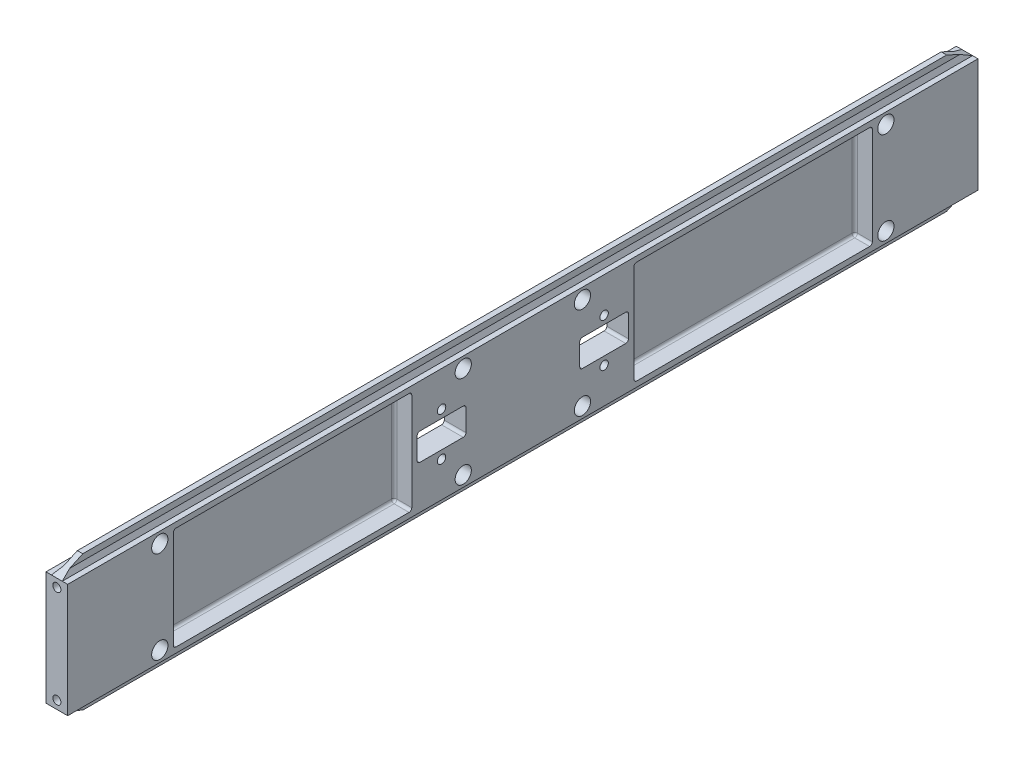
ISO-10303-21;
HEADER;
FILE_DESCRIPTION(('STEP AP214'),'2;1');
FILE_NAME('part.step','',(''),(''),'','','');
FILE_SCHEMA(('AUTOMOTIVE_DESIGN { 1 0 10303 214 1 1 1 1 }'));
ENDSEC;
DATA;
#1=APPLICATION_CONTEXT('core data for automotive mechanical design processes');
#2=APPLICATION_PROTOCOL_DEFINITION('international standard','automotive_design',2000,#1);
#3=PRODUCT_CONTEXT('',#1,'mechanical');
#4=PRODUCT('Part','Part','',(#3));
#5=PRODUCT_RELATED_PRODUCT_CATEGORY('part','',(#4));
#6=PRODUCT_DEFINITION_FORMATION('','',#4);
#7=PRODUCT_DEFINITION_CONTEXT('part definition',#1,'design');
#8=PRODUCT_DEFINITION('design','',#6,#7);
#9=PRODUCT_DEFINITION_SHAPE('','',#8);
#10=(LENGTH_UNIT() NAMED_UNIT(*) SI_UNIT(.MILLI.,.METRE.));
#11=(NAMED_UNIT(*) PLANE_ANGLE_UNIT() SI_UNIT($,.RADIAN.));
#12=(NAMED_UNIT(*) SI_UNIT($,.STERADIAN.) SOLID_ANGLE_UNIT());
#13=UNCERTAINTY_MEASURE_WITH_UNIT(LENGTH_MEASURE(1.E-05),#10,'distance_accuracy_value','');
#14=(GEOMETRIC_REPRESENTATION_CONTEXT(3) GLOBAL_UNCERTAINTY_ASSIGNED_CONTEXT((#13)) GLOBAL_UNIT_ASSIGNED_CONTEXT((#10,
#11,#12)) REPRESENTATION_CONTEXT('',''));
#15=CARTESIAN_POINT('',(0.,0.,0.));
#16=DIRECTION('',(0.,0.,1.));
#17=DIRECTION('',(1.,0.,0.));
#18=AXIS2_PLACEMENT_3D('',#15,#16,#17);
#19=CARTESIAN_POINT('',(0.,-21.,0.));
#20=DIRECTION('',(0.,1.,0.));
#21=DIRECTION('',(0.,0.,1.));
#22=AXIS2_PLACEMENT_3D('',#19,#20,#21);
#23=PLANE('',#22);
#24=DIRECTION('',(1.,0.,0.));
#25=VECTOR('',#24,1.);
#26=CARTESIAN_POINT('',(-4.,-21.,168.));
#27=LINE('',#26,#25);
#28=CARTESIAN_POINT('',(2.,-21.,168.));
#29=VERTEX_POINT('',#28);
#30=CARTESIAN_POINT('',(4.,-21.,168.));
#31=VERTEX_POINT('',#30);
#32=EDGE_CURVE('E969',#29,#31,#27,.T.);
#33=ORIENTED_EDGE('',*,*,#32,.F.);
#34=DIRECTION('',(0.,0.,-1.));
#35=VECTOR('',#34,1.);
#36=CARTESIAN_POINT('',(2.,-21.,-168.));
#37=LINE('',#36,#35);
#38=CARTESIAN_POINT('',(2.,-21.,-168.));
#39=VERTEX_POINT('',#38);
#40=EDGE_CURVE('E1521',#29,#39,#37,.T.);
#41=ORIENTED_EDGE('',*,*,#40,.T.);
#42=DIRECTION('',(-1.,0.,0.));
#43=VECTOR('',#42,1.);
#44=CARTESIAN_POINT('',(-4.,-21.,-168.));
#45=LINE('',#44,#43);
#46=CARTESIAN_POINT('',(4.,-21.,-168.));
#47=VERTEX_POINT('',#46);
#48=EDGE_CURVE('E963',#47,#39,#45,.T.);
#49=ORIENTED_EDGE('',*,*,#48,.F.);
#50=DIRECTION('',(0.,0.,-1.));
#51=VECTOR('',#50,1.);
#52=CARTESIAN_POINT('',(4.,-21.,168.));
#53=LINE('',#52,#51);
#54=EDGE_CURVE('E973',#31,#47,#53,.T.);
#55=ORIENTED_EDGE('',*,*,#54,.F.);
#56=EDGE_LOOP('',(#33,#41,#49,#55));
#57=FACE_BOUND('',#56,.T.);
#58=ADVANCED_FACE('F36',(#57),#23,.F.);
#59=CARTESIAN_POINT('',(0.,21.,0.));
#60=DIRECTION('',(0.,1.,0.));
#61=DIRECTION('',(0.,0.,1.));
#62=AXIS2_PLACEMENT_3D('',#59,#60,#61);
#63=PLANE('',#62);
#64=DIRECTION('',(1.,0.,0.));
#65=VECTOR('',#64,1.);
#66=CARTESIAN_POINT('',(-4.,21.,168.));
#67=LINE('',#66,#65);
#68=CARTESIAN_POINT('',(-4.,21.,168.));
#69=VERTEX_POINT('',#68);
#70=CARTESIAN_POINT('',(-2.,21.,168.));
#71=VERTEX_POINT('',#70);
#72=EDGE_CURVE('E956',#69,#71,#67,.T.);
#73=ORIENTED_EDGE('',*,*,#72,.T.);
#74=DIRECTION('',(0.,0.,-1.));
#75=VECTOR('',#74,1.);
#76=CARTESIAN_POINT('',(-2.,21.,0.));
#77=LINE('',#76,#75);
#78=CARTESIAN_POINT('',(-2.,21.,-168.));
#79=VERTEX_POINT('',#78);
#80=EDGE_CURVE('E1538',#71,#79,#77,.T.);
#81=ORIENTED_EDGE('',*,*,#80,.T.);
#82=DIRECTION('',(-1.,0.,0.));
#83=VECTOR('',#82,1.);
#84=CARTESIAN_POINT('',(-4.,21.,-168.));
#85=LINE('',#84,#83);
#86=CARTESIAN_POINT('',(-4.,21.,-168.));
#87=VERTEX_POINT('',#86);
#88=EDGE_CURVE('E940',#79,#87,#85,.T.);
#89=ORIENTED_EDGE('',*,*,#88,.T.);
#90=DIRECTION('',(0.,0.,1.));
#91=VECTOR('',#90,1.);
#92=CARTESIAN_POINT('',(-4.,21.,168.));
#93=LINE('',#92,#91);
#94=EDGE_CURVE('E952',#87,#69,#93,.T.);
#95=ORIENTED_EDGE('',*,*,#94,.T.);
#96=EDGE_LOOP('',(#73,#81,#89,#95));
#97=FACE_BOUND('',#96,.T.);
#98=ADVANCED_FACE('F1665',(#97),#63,.T.);
#99=CARTESIAN_POINT('',(2.5,-21.,168.));
#100=DIRECTION('',(1.,0.,0.));
#101=DIRECTION('',(0.,0.,-1.));
#102=AXIS2_PLACEMENT_3D('',#99,#100,#101);
#103=PLANE('',#102);
#104=CARTESIAN_POINT('',(2.5,-14.,-141.));
#105=DIRECTION('',(1.,0.,0.));
#106=DIRECTION('',(0.,0.,-1.));
#107=AXIS2_PLACEMENT_3D('',#104,#105,#106);
#108=CIRCLE('',#107,2.);
#109=CARTESIAN_POINT('',(2.5,-12.,-141.));
#110=VERTEX_POINT('',#109);
#111=CARTESIAN_POINT('',(2.5,-14.,-143.));
#112=VERTEX_POINT('',#111);
#113=EDGE_CURVE('E1114',#110,#112,#108,.F.);
#114=ORIENTED_EDGE('',*,*,#113,.F.);
#115=DIRECTION('',(0.,0.,1.));
#116=VECTOR('',#115,1.);
#117=CARTESIAN_POINT('',(2.5,-12.,-131.));
#118=LINE('',#117,#116);
#119=CARTESIAN_POINT('',(2.5,-12.,-132.));
#120=VERTEX_POINT('',#119);
#121=EDGE_CURVE('E1102',#110,#120,#118,.T.);
#122=ORIENTED_EDGE('',*,*,#121,.T.);
#123=DIRECTION('',(0.,1.,0.));
#124=VECTOR('',#123,1.);
#125=CARTESIAN_POINT('',(2.5,13.,-132.));
#126=LINE('',#125,#124);
#127=CARTESIAN_POINT('',(2.5,12.,-132.));
#128=VERTEX_POINT('',#127);
#129=EDGE_CURVE('E1098',#120,#128,#126,.T.);
#130=ORIENTED_EDGE('',*,*,#129,.T.);
#131=DIRECTION('',(0.,0.,-1.));
#132=VECTOR('',#131,1.);
#133=CARTESIAN_POINT('',(2.5,12.,-142.));
#134=LINE('',#133,#132);
#135=CARTESIAN_POINT('',(2.5,12.,-141.));
#136=VERTEX_POINT('',#135);
#137=EDGE_CURVE('E1100',#128,#136,#134,.T.);
#138=ORIENTED_EDGE('',*,*,#137,.T.);
#139=CARTESIAN_POINT('',(2.5,14.,-141.));
#140=DIRECTION('',(1.,0.,0.));
#141=DIRECTION('',(0.,0.,-1.));
#142=AXIS2_PLACEMENT_3D('',#139,#140,#141);
#143=CIRCLE('',#142,2.);
#144=CARTESIAN_POINT('',(2.5,14.,-143.));
#145=VERTEX_POINT('',#144);
#146=EDGE_CURVE('E1105',#145,#136,#143,.F.);
#147=ORIENTED_EDGE('',*,*,#146,.F.);
#148=DIRECTION('',(0.,0.,-1.));
#149=VECTOR('',#148,1.);
#150=CARTESIAN_POINT('',(2.5,14.,-165.5));
#151=LINE('',#150,#149);
#152=CARTESIAN_POINT('',(2.5,14.,-164.5));
#153=VERTEX_POINT('',#152);
#154=EDGE_CURVE('E1108',#145,#153,#151,.T.);
#155=ORIENTED_EDGE('',*,*,#154,.T.);
#156=DIRECTION('',(0.,-1.,0.));
#157=VECTOR('',#156,1.);
#158=CARTESIAN_POINT('',(2.5,-15.,-164.5));
#159=LINE('',#158,#157);
#160=CARTESIAN_POINT('',(2.5,-14.,-164.5));
#161=VERTEX_POINT('',#160);
#162=EDGE_CURVE('E1110',#153,#161,#159,.T.);
#163=ORIENTED_EDGE('',*,*,#162,.T.);
#164=DIRECTION('',(0.,0.,1.));
#165=VECTOR('',#164,1.);
#166=CARTESIAN_POINT('',(2.5,-14.,-142.));
#167=LINE('',#166,#165);
#168=EDGE_CURVE('E1112',#161,#112,#167,.T.);
#169=ORIENTED_EDGE('',*,*,#168,.T.);
#170=EDGE_LOOP('',(#114,#122,#130,#138,#147,#155,#163,#169));
#171=FACE_BOUND('',#170,.T.);
#172=ADVANCED_FACE('F1672',(#171),#103,.F.);
#173=CARTESIAN_POINT('',(-4.,17.,134.));
#174=DIRECTION('',(1.,0.,0.));
#175=DIRECTION('',(0.,0.,-1.));
#176=AXIS2_PLACEMENT_3D('',#173,#174,#175);
#177=CYLINDRICAL_SURFACE('',#176,1.5);
#178=CARTESIAN_POINT('',(-4.,17.,134.));
#179=DIRECTION('',(1.,0.,0.));
#180=DIRECTION('',(0.,0.,-1.));
#181=AXIS2_PLACEMENT_3D('',#178,#179,#180);
#182=CIRCLE('',#181,1.5);
#183=CARTESIAN_POINT('',(-4.,17.,132.5));
#184=VERTEX_POINT('',#183);
#185=EDGE_CURVE('E842',#184,#184,#182,.T.);
#186=ORIENTED_EDGE('',*,*,#185,.F.);
#187=EDGE_LOOP('',(#186));
#188=FACE_BOUND('',#187,.T.);
#189=CARTESIAN_POINT('',(-1.,17.,134.));
#190=DIRECTION('',(1.,0.,0.));
#191=DIRECTION('',(0.,0.,-1.));
#192=AXIS2_PLACEMENT_3D('',#189,#190,#191);
#193=CIRCLE('',#192,1.5);
#194=CARTESIAN_POINT('',(-1.,17.,132.5));
#195=VERTEX_POINT('',#194);
#196=EDGE_CURVE('E838',#195,#195,#193,.F.);
#197=ORIENTED_EDGE('',*,*,#196,.F.);
#198=EDGE_LOOP('',(#197));
#199=FACE_BOUND('',#198,.T.);
#200=ADVANCED_FACE('F1816',(#188,#199),#177,.F.);
#201=CARTESIAN_POINT('',(-4.,17.,22.));
#202=DIRECTION('',(1.,0.,0.));
#203=DIRECTION('',(0.,0.,-1.));
#204=AXIS2_PLACEMENT_3D('',#201,#202,#203);
#205=CYLINDRICAL_SURFACE('',#204,1.50000000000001);
#206=CARTESIAN_POINT('',(-4.,17.,22.));
#207=DIRECTION('',(1.,0.,0.));
#208=DIRECTION('',(0.,0.,1.));
#209=AXIS2_PLACEMENT_3D('',#206,#207,#208);
#210=CIRCLE('',#209,1.50000000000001);
#211=CARTESIAN_POINT('',(-4.,17.,23.5));
#212=VERTEX_POINT('',#211);
#213=EDGE_CURVE('E835',#212,#212,#210,.T.);
#214=ORIENTED_EDGE('',*,*,#213,.F.);
#215=EDGE_LOOP('',(#214));
#216=FACE_BOUND('',#215,.T.);
#217=CARTESIAN_POINT('',(-1.,17.,22.));
#218=DIRECTION('',(1.,0.,0.));
#219=DIRECTION('',(0.,0.,-1.));
#220=AXIS2_PLACEMENT_3D('',#217,#218,#219);
#221=CIRCLE('',#220,1.50000000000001);
#222=CARTESIAN_POINT('',(-1.,17.,20.5));
#223=VERTEX_POINT('',#222);
#224=EDGE_CURVE('E1004',#223,#223,#221,.F.);
#225=ORIENTED_EDGE('',*,*,#224,.F.);
#226=EDGE_LOOP('',(#225));
#227=FACE_BOUND('',#226,.T.);
#228=ADVANCED_FACE('F1926',(#216,#227),#205,.F.);
#229=CARTESIAN_POINT('',(-4.,-17.,-22.));
#230=DIRECTION('',(1.,0.,0.));
#231=DIRECTION('',(0.,0.,-1.));
#232=AXIS2_PLACEMENT_3D('',#229,#230,#231);
#233=CYLINDRICAL_SURFACE('',#232,1.50000000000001);
#234=CARTESIAN_POINT('',(-4.,-17.,-22.));
#235=DIRECTION('',(1.,0.,0.));
#236=DIRECTION('',(0.,0.,1.));
#237=AXIS2_PLACEMENT_3D('',#234,#235,#236);
#238=CIRCLE('',#237,1.50000000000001);
#239=CARTESIAN_POINT('',(-4.,-17.,-20.5));
#240=VERTEX_POINT('',#239);
#241=EDGE_CURVE('E828',#240,#240,#238,.T.);
#242=ORIENTED_EDGE('',*,*,#241,.F.);
#243=EDGE_LOOP('',(#242));
#244=FACE_BOUND('',#243,.T.);
#245=CARTESIAN_POINT('',(-1.,-17.,-22.));
#246=DIRECTION('',(1.,0.,0.));
#247=DIRECTION('',(0.,0.,-1.));
#248=AXIS2_PLACEMENT_3D('',#245,#246,#247);
#249=CIRCLE('',#248,1.50000000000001);
#250=CARTESIAN_POINT('',(-1.,-17.,-23.5));
#251=VERTEX_POINT('',#250);
#252=EDGE_CURVE('E998',#251,#251,#249,.F.);
#253=ORIENTED_EDGE('',*,*,#252,.F.);
#254=EDGE_LOOP('',(#253));
#255=FACE_BOUND('',#254,.T.);
#256=ADVANCED_FACE('F1922',(#244,#255),#233,.F.);
#257=CARTESIAN_POINT('',(-4.,-17.,-134.));
#258=DIRECTION('',(1.,0.,0.));
#259=DIRECTION('',(0.,0.,-1.));
#260=AXIS2_PLACEMENT_3D('',#257,#258,#259);
#261=CYLINDRICAL_SURFACE('',#260,1.5);
#262=CARTESIAN_POINT('',(-4.,-17.,-134.));
#263=DIRECTION('',(1.,0.,0.));
#264=DIRECTION('',(0.,0.,-1.));
#265=AXIS2_PLACEMENT_3D('',#262,#263,#264);
#266=CIRCLE('',#265,1.5);
#267=CARTESIAN_POINT('',(-4.,-17.,-135.5));
#268=VERTEX_POINT('',#267);
#269=EDGE_CURVE('E846',#268,#268,#266,.T.);
#270=ORIENTED_EDGE('',*,*,#269,.F.);
#271=EDGE_LOOP('',(#270));
#272=FACE_BOUND('',#271,.T.);
#273=CARTESIAN_POINT('',(-1.,-17.,-134.));
#274=DIRECTION('',(1.,0.,0.));
#275=DIRECTION('',(0.,0.,-1.));
#276=AXIS2_PLACEMENT_3D('',#273,#274,#275);
#277=CIRCLE('',#276,1.5);
#278=CARTESIAN_POINT('',(-1.,-17.,-135.5));
#279=VERTEX_POINT('',#278);
#280=EDGE_CURVE('E992',#279,#279,#277,.F.);
#281=ORIENTED_EDGE('',*,*,#280,.F.);
#282=EDGE_LOOP('',(#281));
#283=FACE_BOUND('',#282,.T.);
#284=ADVANCED_FACE('F1925',(#272,#283),#261,.F.);
#285=CARTESIAN_POINT('',(-4.,-21.,-168.));
#286=DIRECTION('',(0.,0.,-1.));
#287=DIRECTION('',(-1.,0.,0.));
#288=AXIS2_PLACEMENT_3D('',#285,#286,#287);
#289=PLANE('',#288);
#290=CARTESIAN_POINT('',(0.,18.,-168.));
#291=DIRECTION('',(0.,0.,1.));
#292=DIRECTION('',(1.,0.,0.));
#293=AXIS2_PLACEMENT_3D('',#290,#291,#292);
#294=CIRCLE('',#293,1.5);
#295=CARTESIAN_POINT('',(1.5,18.,-168.));
#296=VERTEX_POINT('',#295);
#297=EDGE_CURVE('E929',#296,#296,#294,.T.);
#298=ORIENTED_EDGE('',*,*,#297,.T.);
#299=EDGE_LOOP('',(#298));
#300=FACE_BOUND('',#299,.T.);
#301=CARTESIAN_POINT('',(0.,-18.,-168.));
#302=DIRECTION('',(0.,0.,1.));
#303=DIRECTION('',(-1.,0.,0.));
#304=AXIS2_PLACEMENT_3D('',#301,#302,#303);
#305=CIRCLE('',#304,1.5);
#306=CARTESIAN_POINT('',(-1.5,-18.,-168.));
#307=VERTEX_POINT('',#306);
#308=EDGE_CURVE('E924',#307,#307,#305,.T.);
#309=ORIENTED_EDGE('',*,*,#308,.T.);
#310=EDGE_LOOP('',(#309));
#311=FACE_BOUND('',#310,.T.);
#312=DIRECTION('',(0.,1.,0.));
#313=VECTOR('',#312,1.);
#314=CARTESIAN_POINT('',(-4.,-21.,-168.));
#315=LINE('',#314,#313);
#316=CARTESIAN_POINT('',(-4.,-21.,-168.));
#317=VERTEX_POINT('',#316);
#318=EDGE_CURVE('E976',#317,#87,#315,.T.);
#319=ORIENTED_EDGE('',*,*,#318,.T.);
#320=ORIENTED_EDGE('',*,*,#88,.F.);
#321=DIRECTION('',(1.,0.,0.));
#322=VECTOR('',#321,1.);
#323=CARTESIAN_POINT('',(-1.,21.,-168.));
#324=LINE('',#323,#322);
#325=CARTESIAN_POINT('',(2.,21.,-168.));
#326=VERTEX_POINT('',#325);
#327=EDGE_CURVE('E696',#79,#326,#324,.T.);
#328=ORIENTED_EDGE('',*,*,#327,.T.);
#329=CARTESIAN_POINT('',(4.,21.,-168.));
#330=VERTEX_POINT('',#329);
#331=EDGE_CURVE('E949',#330,#326,#85,.T.);
#332=ORIENTED_EDGE('',*,*,#331,.F.);
#333=DIRECTION('',(0.,1.,0.));
#334=VECTOR('',#333,1.);
#335=CARTESIAN_POINT('',(4.,-21.,-168.));
#336=LINE('',#335,#334);
#337=EDGE_CURVE('E977',#47,#330,#336,.T.);
#338=ORIENTED_EDGE('',*,*,#337,.F.);
#339=ORIENTED_EDGE('',*,*,#48,.T.);
#340=DIRECTION('',(1.,0.,0.));
#341=VECTOR('',#340,1.);
#342=CARTESIAN_POINT('',(-1.,-21.,-168.));
#343=LINE('',#342,#341);
#344=CARTESIAN_POINT('',(-2.,-21.,-168.));
#345=VERTEX_POINT('',#344);
#346=EDGE_CURVE('E676',#345,#39,#343,.T.);
#347=ORIENTED_EDGE('',*,*,#346,.F.);
#348=EDGE_CURVE('E962',#345,#317,#45,.T.);
#349=ORIENTED_EDGE('',*,*,#348,.T.);
#350=EDGE_LOOP('',(#319,#320,#328,#332,#338,#339,#347,#349));
#351=FACE_BOUND('',#350,.T.);
#352=ADVANCED_FACE('F1946',(#300,#311,#351),#289,.T.);
#353=CARTESIAN_POINT('',(4.,-21.,168.));
#354=DIRECTION('',(1.,0.,0.));
#355=DIRECTION('',(0.,0.,-1.));
#356=AXIS2_PLACEMENT_3D('',#353,#354,#355);
#357=PLANE('',#356);
#358=DIRECTION('',(0.,-1.,0.));
#359=VECTOR('',#358,1.);
#360=CARTESIAN_POINT('',(4.,-19.,129.));
#361=LINE('',#360,#359);
#362=CARTESIAN_POINT('',(4.,18.,129.));
#363=VERTEX_POINT('',#362);
#364=CARTESIAN_POINT('',(4.,-18.,129.));
#365=VERTEX_POINT('',#364);
#366=EDGE_CURVE('E759',#363,#365,#361,.T.);
#367=ORIENTED_EDGE('',*,*,#366,.F.);
#368=CARTESIAN_POINT('',(4.,18.,128.));
#369=DIRECTION('',(1.,0.,0.));
#370=DIRECTION('',(0.,0.,-1.));
#371=AXIS2_PLACEMENT_3D('',#368,#369,#370);
#372=CIRCLE('',#371,1.);
#373=CARTESIAN_POINT('',(4.,19.,128.));
#374=VERTEX_POINT('',#373);
#375=EDGE_CURVE('E1264',#363,#374,#372,.F.);
#376=ORIENTED_EDGE('',*,*,#375,.T.);
#377=DIRECTION('',(0.,0.,1.));
#378=VECTOR('',#377,1.);
#379=CARTESIAN_POINT('',(4.,19.,129.));
#380=LINE('',#379,#378);
#381=CARTESIAN_POINT('',(4.,19.,42.));
#382=VERTEX_POINT('',#381);
#383=EDGE_CURVE('E756',#382,#374,#380,.T.);
#384=ORIENTED_EDGE('',*,*,#383,.F.);
#385=CARTESIAN_POINT('',(4.,18.,42.));
#386=DIRECTION('',(1.,0.,0.));
#387=DIRECTION('',(0.,0.,-1.));
#388=AXIS2_PLACEMENT_3D('',#385,#386,#387);
#389=CIRCLE('',#388,1.);
#390=CARTESIAN_POINT('',(4.,18.,41.));
#391=VERTEX_POINT('',#390);
#392=EDGE_CURVE('E1262',#382,#391,#389,.F.);
#393=ORIENTED_EDGE('',*,*,#392,.T.);
#394=DIRECTION('',(0.,1.,0.));
#395=VECTOR('',#394,1.);
#396=CARTESIAN_POINT('',(4.,19.,41.));
#397=LINE('',#396,#395);
#398=CARTESIAN_POINT('',(4.,-18.,41.));
#399=VERTEX_POINT('',#398);
#400=EDGE_CURVE('E766',#399,#391,#397,.T.);
#401=ORIENTED_EDGE('',*,*,#400,.F.);
#402=CARTESIAN_POINT('',(4.,-18.,42.));
#403=DIRECTION('',(1.,0.,0.));
#404=DIRECTION('',(0.,0.,-1.));
#405=AXIS2_PLACEMENT_3D('',#402,#403,#404);
#406=CIRCLE('',#405,1.);
#407=CARTESIAN_POINT('',(4.,-19.,42.));
#408=VERTEX_POINT('',#407);
#409=EDGE_CURVE('E1268',#399,#408,#406,.F.);
#410=ORIENTED_EDGE('',*,*,#409,.T.);
#411=DIRECTION('',(0.,0.,-1.));
#412=VECTOR('',#411,1.);
#413=CARTESIAN_POINT('',(4.,-19.,129.));
#414=LINE('',#413,#412);
#415=CARTESIAN_POINT('',(4.,-19.,128.));
#416=VERTEX_POINT('',#415);
#417=EDGE_CURVE('E763',#416,#408,#414,.T.);
#418=ORIENTED_EDGE('',*,*,#417,.F.);
#419=CARTESIAN_POINT('',(4.,-18.,128.));
#420=DIRECTION('',(1.,0.,0.));
#421=DIRECTION('',(0.,0.,-1.));
#422=AXIS2_PLACEMENT_3D('',#419,#420,#421);
#423=CIRCLE('',#422,1.);
#424=EDGE_CURVE('E1266',#416,#365,#423,.F.);
#425=ORIENTED_EDGE('',*,*,#424,.T.);
#426=EDGE_LOOP('',(#367,#376,#384,#393,#401,#410,#418,#425));
#427=FACE_BOUND('',#426,.T.);
#428=DIRECTION('',(0.,0.,1.));
#429=VECTOR('',#428,1.);
#430=CARTESIAN_POINT('',(4.,19.,-129.));
#431=LINE('',#430,#429);
#432=CARTESIAN_POINT('',(4.,19.,-128.));
#433=VERTEX_POINT('',#432);
#434=CARTESIAN_POINT('',(4.,19.,-42.));
#435=VERTEX_POINT('',#434);
#436=EDGE_CURVE('E772',#433,#435,#431,.T.);
#437=ORIENTED_EDGE('',*,*,#436,.F.);
#438=CARTESIAN_POINT('',(4.,18.,-128.));
#439=DIRECTION('',(1.,0.,0.));
#440=DIRECTION('',(0.,0.,-1.));
#441=AXIS2_PLACEMENT_3D('',#438,#439,#440);
#442=CIRCLE('',#441,1.);
#443=CARTESIAN_POINT('',(4.,18.,-129.));
#444=VERTEX_POINT('',#443);
#445=EDGE_CURVE('E1274',#433,#444,#442,.F.);
#446=ORIENTED_EDGE('',*,*,#445,.T.);
#447=DIRECTION('',(0.,1.,0.));
#448=VECTOR('',#447,1.);
#449=CARTESIAN_POINT('',(4.,-19.,-129.));
#450=LINE('',#449,#448);
#451=CARTESIAN_POINT('',(4.,-18.,-129.));
#452=VERTEX_POINT('',#451);
#453=EDGE_CURVE('E709',#452,#444,#450,.T.);
#454=ORIENTED_EDGE('',*,*,#453,.F.);
#455=CARTESIAN_POINT('',(4.,-18.,-128.));
#456=DIRECTION('',(1.,0.,0.));
#457=DIRECTION('',(0.,0.,-1.));
#458=AXIS2_PLACEMENT_3D('',#455,#456,#457);
#459=CIRCLE('',#458,1.);
#460=CARTESIAN_POINT('',(4.,-19.,-128.));
#461=VERTEX_POINT('',#460);
#462=EDGE_CURVE('E1276',#452,#461,#459,.F.);
#463=ORIENTED_EDGE('',*,*,#462,.T.);
#464=DIRECTION('',(0.,0.,-1.));
#465=VECTOR('',#464,1.);
#466=CARTESIAN_POINT('',(4.,-19.,-129.));
#467=LINE('',#466,#465);
#468=CARTESIAN_POINT('',(4.,-19.,-42.));
#469=VERTEX_POINT('',#468);
#470=EDGE_CURVE('E760',#469,#461,#467,.T.);
#471=ORIENTED_EDGE('',*,*,#470,.F.);
#472=CARTESIAN_POINT('',(4.,-18.,-42.));
#473=DIRECTION('',(1.,0.,0.));
#474=DIRECTION('',(0.,0.,-1.));
#475=AXIS2_PLACEMENT_3D('',#472,#473,#474);
#476=CIRCLE('',#475,1.);
#477=CARTESIAN_POINT('',(4.,-18.,-41.));
#478=VERTEX_POINT('',#477);
#479=EDGE_CURVE('E1272',#469,#478,#476,.F.);
#480=ORIENTED_EDGE('',*,*,#479,.T.);
#481=DIRECTION('',(0.,-1.,0.));
#482=VECTOR('',#481,1.);
#483=CARTESIAN_POINT('',(4.,19.,-41.));
#484=LINE('',#483,#482);
#485=CARTESIAN_POINT('',(4.,18.,-41.));
#486=VERTEX_POINT('',#485);
#487=EDGE_CURVE('E775',#486,#478,#484,.T.);
#488=ORIENTED_EDGE('',*,*,#487,.F.);
#489=CARTESIAN_POINT('',(4.,18.,-42.));
#490=DIRECTION('',(1.,0.,0.));
#491=DIRECTION('',(0.,0.,-1.));
#492=AXIS2_PLACEMENT_3D('',#489,#490,#491);
#493=CIRCLE('',#492,1.);
#494=EDGE_CURVE('E1270',#486,#435,#493,.F.);
#495=ORIENTED_EDGE('',*,*,#494,.T.);
#496=EDGE_LOOP('',(#437,#446,#454,#463,#471,#480,#488,#495));
#497=FACE_BOUND('',#496,.T.);
#498=CARTESIAN_POINT('',(4.,-17.,-134.));
#499=DIRECTION('',(1.,0.,0.));
#500=DIRECTION('',(0.,0.,-1.));
#501=AXIS2_PLACEMENT_3D('',#498,#499,#500);
#502=CIRCLE('',#501,2.99999999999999);
#503=CARTESIAN_POINT('',(4.,-17.,-137.));
#504=VERTEX_POINT('',#503);
#505=EDGE_CURVE('E783',#504,#504,#502,.T.);
#506=ORIENTED_EDGE('',*,*,#505,.F.);
#507=EDGE_LOOP('',(#506));
#508=FACE_BOUND('',#507,.T.);
#509=CARTESIAN_POINT('',(4.,-17.,134.));
#510=DIRECTION('',(1.,0.,0.));
#511=DIRECTION('',(0.,0.,1.));
#512=AXIS2_PLACEMENT_3D('',#509,#510,#511);
#513=CIRCLE('',#512,2.99999999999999);
#514=CARTESIAN_POINT('',(4.,-17.,137.));
#515=VERTEX_POINT('',#514);
#516=EDGE_CURVE('E802',#515,#515,#513,.T.);
#517=ORIENTED_EDGE('',*,*,#516,.F.);
#518=EDGE_LOOP('',(#517));
#519=FACE_BOUND('',#518,.T.);
#520=CARTESIAN_POINT('',(4.,-17.,22.));
#521=DIRECTION('',(1.,0.,0.));
#522=DIRECTION('',(0.,0.,1.));
#523=AXIS2_PLACEMENT_3D('',#520,#521,#522);
#524=CIRCLE('',#523,2.99999999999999);
#525=CARTESIAN_POINT('',(4.,-17.,25.));
#526=VERTEX_POINT('',#525);
#527=EDGE_CURVE('E801',#526,#526,#524,.T.);
#528=ORIENTED_EDGE('',*,*,#527,.F.);
#529=EDGE_LOOP('',(#528));
#530=FACE_BOUND('',#529,.T.);
#531=CARTESIAN_POINT('',(4.,17.,22.));
#532=DIRECTION('',(1.,0.,0.));
#533=DIRECTION('',(0.,0.,-1.));
#534=AXIS2_PLACEMENT_3D('',#531,#532,#533);
#535=CIRCLE('',#534,2.99999999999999);
#536=CARTESIAN_POINT('',(4.,17.,19.));
#537=VERTEX_POINT('',#536);
#538=EDGE_CURVE('E814',#537,#537,#535,.T.);
#539=ORIENTED_EDGE('',*,*,#538,.F.);
#540=EDGE_LOOP('',(#539));
#541=FACE_BOUND('',#540,.T.);
#542=CARTESIAN_POINT('',(4.,-17.,-22.));
#543=DIRECTION('',(1.,0.,0.));
#544=DIRECTION('',(0.,0.,-1.));
#545=AXIS2_PLACEMENT_3D('',#542,#543,#544);
#546=CIRCLE('',#545,2.99999999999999);
#547=CARTESIAN_POINT('',(4.,-17.,-25.));
#548=VERTEX_POINT('',#547);
#549=EDGE_CURVE('E784',#548,#548,#546,.T.);
#550=ORIENTED_EDGE('',*,*,#549,.F.);
#551=EDGE_LOOP('',(#550));
#552=FACE_BOUND('',#551,.T.);
#553=CARTESIAN_POINT('',(4.,17.,-22.));
#554=DIRECTION('',(1.,0.,0.));
#555=DIRECTION('',(0.,0.,1.));
#556=AXIS2_PLACEMENT_3D('',#553,#554,#555);
#557=CIRCLE('',#556,2.99999999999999);
#558=CARTESIAN_POINT('',(4.,17.,-19.));
#559=VERTEX_POINT('',#558);
#560=EDGE_CURVE('E790',#559,#559,#557,.T.);
#561=ORIENTED_EDGE('',*,*,#560,.F.);
#562=EDGE_LOOP('',(#561));
#563=FACE_BOUND('',#562,.T.);
#564=CARTESIAN_POINT('',(4.,17.,-134.));
#565=DIRECTION('',(1.,0.,0.));
#566=DIRECTION('',(0.,0.,1.));
#567=AXIS2_PLACEMENT_3D('',#564,#565,#566);
#568=CIRCLE('',#567,2.99999999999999);
#569=CARTESIAN_POINT('',(4.,17.,-131.));
#570=VERTEX_POINT('',#569);
#571=EDGE_CURVE('E769',#570,#570,#568,.T.);
#572=ORIENTED_EDGE('',*,*,#571,.F.);
#573=EDGE_LOOP('',(#572));
#574=FACE_BOUND('',#573,.T.);
#575=CARTESIAN_POINT('',(4.,17.,134.));
#576=DIRECTION('',(1.,0.,0.));
#577=DIRECTION('',(0.,0.,-1.));
#578=AXIS2_PLACEMENT_3D('',#575,#576,#577);
#579=CIRCLE('',#578,2.99999999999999);
#580=CARTESIAN_POINT('',(4.,17.,131.));
#581=VERTEX_POINT('',#580);
#582=EDGE_CURVE('E813',#581,#581,#579,.T.);
#583=ORIENTED_EDGE('',*,*,#582,.F.);
#584=EDGE_LOOP('',(#583));
#585=FACE_BOUND('',#584,.T.);
#586=CARTESIAN_POINT('',(4.,8.,30.));
#587=DIRECTION('',(1.,0.,0.));
#588=DIRECTION('',(0.,0.,-1.));
#589=AXIS2_PLACEMENT_3D('',#586,#587,#588);
#590=CIRCLE('',#589,1.55);
#591=CARTESIAN_POINT('',(4.,8.,28.45));
#592=VERTEX_POINT('',#591);
#593=EDGE_CURVE('E877',#592,#592,#590,.T.);
#594=ORIENTED_EDGE('',*,*,#593,.F.);
#595=EDGE_LOOP('',(#594));
#596=FACE_BOUND('',#595,.T.);
#597=CARTESIAN_POINT('',(4.,-8.,30.));
#598=DIRECTION('',(1.,0.,0.));
#599=DIRECTION('',(0.,0.,1.));
#600=AXIS2_PLACEMENT_3D('',#597,#598,#599);
#601=CIRCLE('',#600,1.55);
#602=CARTESIAN_POINT('',(4.,-8.,31.55));
#603=VERTEX_POINT('',#602);
#604=EDGE_CURVE('E885',#603,#603,#601,.T.);
#605=ORIENTED_EDGE('',*,*,#604,.F.);
#606=EDGE_LOOP('',(#605));
#607=FACE_BOUND('',#606,.T.);
#608=CARTESIAN_POINT('',(4.,-8.,-30.));
#609=DIRECTION('',(1.,0.,0.));
#610=DIRECTION('',(0.,0.,-1.));
#611=AXIS2_PLACEMENT_3D('',#608,#609,#610);
#612=CIRCLE('',#611,1.55);
#613=CARTESIAN_POINT('',(4.,-8.,-31.55));
#614=VERTEX_POINT('',#613);
#615=EDGE_CURVE('E891',#614,#614,#612,.T.);
#616=ORIENTED_EDGE('',*,*,#615,.F.);
#617=EDGE_LOOP('',(#616));
#618=FACE_BOUND('',#617,.T.);
#619=CARTESIAN_POINT('',(4.,8.,-30.));
#620=DIRECTION('',(1.,0.,0.));
#621=DIRECTION('',(0.,0.,1.));
#622=AXIS2_PLACEMENT_3D('',#619,#620,#621);
#623=CIRCLE('',#622,1.55);
#624=CARTESIAN_POINT('',(4.,8.,-28.45));
#625=VERTEX_POINT('',#624);
#626=EDGE_CURVE('E876',#625,#625,#623,.T.);
#627=ORIENTED_EDGE('',*,*,#626,.F.);
#628=EDGE_LOOP('',(#627));
#629=FACE_BOUND('',#628,.T.);
#630=DIRECTION('',(0.,1.,0.));
#631=VECTOR('',#630,1.);
#632=CARTESIAN_POINT('',(4.,-5.,-39.));
#633=LINE('',#632,#631);
#634=CARTESIAN_POINT('',(4.,-4.,-39.));
#635=VERTEX_POINT('',#634);
#636=CARTESIAN_POINT('',(4.,4.,-39.));
#637=VERTEX_POINT('',#636);
#638=EDGE_CURVE('E853',#635,#637,#633,.T.);
#639=ORIENTED_EDGE('',*,*,#638,.F.);
#640=CARTESIAN_POINT('',(4.,-4.,-38.));
#641=DIRECTION('',(1.,0.,0.));
#642=DIRECTION('',(0.,0.,-1.));
#643=AXIS2_PLACEMENT_3D('',#640,#641,#642);
#644=CIRCLE('',#643,1.);
#645=CARTESIAN_POINT('',(4.,-5.,-38.));
#646=VERTEX_POINT('',#645);
#647=EDGE_CURVE('E1608',#635,#646,#644,.F.);
#648=ORIENTED_EDGE('',*,*,#647,.T.);
#649=DIRECTION('',(0.,0.,-1.));
#650=VECTOR('',#649,1.);
#651=CARTESIAN_POINT('',(4.,-5.,-39.));
#652=LINE('',#651,#650);
#653=CARTESIAN_POINT('',(4.,-5.,-22.));
#654=VERTEX_POINT('',#653);
#655=EDGE_CURVE('E861',#654,#646,#652,.T.);
#656=ORIENTED_EDGE('',*,*,#655,.F.);
#657=CARTESIAN_POINT('',(4.,-4.,-22.));
#658=DIRECTION('',(1.,0.,0.));
#659=DIRECTION('',(0.,0.,-1.));
#660=AXIS2_PLACEMENT_3D('',#657,#658,#659);
#661=CIRCLE('',#660,1.);
#662=CARTESIAN_POINT('',(4.,-4.,-21.));
#663=VERTEX_POINT('',#662);
#664=EDGE_CURVE('E1612',#654,#663,#661,.F.);
#665=ORIENTED_EDGE('',*,*,#664,.T.);
#666=DIRECTION('',(0.,-1.,0.));
#667=VECTOR('',#666,1.);
#668=CARTESIAN_POINT('',(4.,5.,-21.));
#669=LINE('',#668,#667);
#670=CARTESIAN_POINT('',(4.,4.,-21.));
#671=VERTEX_POINT('',#670);
#672=EDGE_CURVE('E858',#671,#663,#669,.T.);
#673=ORIENTED_EDGE('',*,*,#672,.F.);
#674=CARTESIAN_POINT('',(4.,4.,-22.));
#675=DIRECTION('',(1.,0.,0.));
#676=DIRECTION('',(0.,0.,-1.));
#677=AXIS2_PLACEMENT_3D('',#674,#675,#676);
#678=CIRCLE('',#677,1.);
#679=CARTESIAN_POINT('',(4.,5.,-22.));
#680=VERTEX_POINT('',#679);
#681=EDGE_CURVE('E51',#671,#680,#678,.F.);
#682=ORIENTED_EDGE('',*,*,#681,.T.);
#683=DIRECTION('',(0.,0.,1.));
#684=VECTOR('',#683,1.);
#685=CARTESIAN_POINT('',(4.,5.,-39.));
#686=LINE('',#685,#684);
#687=CARTESIAN_POINT('',(4.,5.,-38.));
#688=VERTEX_POINT('',#687);
#689=EDGE_CURVE('E856',#688,#680,#686,.T.);
#690=ORIENTED_EDGE('',*,*,#689,.F.);
#691=CARTESIAN_POINT('',(4.,4.,-38.));
#692=DIRECTION('',(1.,0.,0.));
#693=DIRECTION('',(0.,0.,-1.));
#694=AXIS2_PLACEMENT_3D('',#691,#692,#693);
#695=CIRCLE('',#694,1.);
#696=EDGE_CURVE('E44',#688,#637,#695,.F.);
#697=ORIENTED_EDGE('',*,*,#696,.T.);
#698=EDGE_LOOP('',(#639,#648,#656,#665,#673,#682,#690,#697));
#699=FACE_BOUND('',#698,.T.);
#700=DIRECTION('',(0.,0.,1.));
#701=VECTOR('',#700,1.);
#702=CARTESIAN_POINT('',(4.,5.,39.));
#703=LINE('',#702,#701);
#704=CARTESIAN_POINT('',(4.,5.,22.));
#705=VERTEX_POINT('',#704);
#706=CARTESIAN_POINT('',(4.,5.,38.));
#707=VERTEX_POINT('',#706);
#708=EDGE_CURVE('E884',#705,#707,#703,.T.);
#709=ORIENTED_EDGE('',*,*,#708,.F.);
#710=CARTESIAN_POINT('',(4.,4.,22.));
#711=DIRECTION('',(1.,0.,0.));
#712=DIRECTION('',(0.,0.,-1.));
#713=AXIS2_PLACEMENT_3D('',#710,#711,#712);
#714=CIRCLE('',#713,1.);
#715=CARTESIAN_POINT('',(4.,4.,21.));
#716=VERTEX_POINT('',#715);
#717=EDGE_CURVE('E1600',#705,#716,#714,.F.);
#718=ORIENTED_EDGE('',*,*,#717,.T.);
#719=DIRECTION('',(0.,1.,0.));
#720=VECTOR('',#719,1.);
#721=CARTESIAN_POINT('',(4.,5.,21.));
#722=LINE('',#721,#720);
#723=CARTESIAN_POINT('',(4.,-4.,21.));
#724=VERTEX_POINT('',#723);
#725=EDGE_CURVE('E909',#724,#716,#722,.T.);
#726=ORIENTED_EDGE('',*,*,#725,.F.);
#727=CARTESIAN_POINT('',(4.,-4.,22.));
#728=DIRECTION('',(1.,0.,0.));
#729=DIRECTION('',(0.,0.,-1.));
#730=AXIS2_PLACEMENT_3D('',#727,#728,#729);
#731=CIRCLE('',#730,1.);
#732=CARTESIAN_POINT('',(4.,-5.,22.));
#733=VERTEX_POINT('',#732);
#734=EDGE_CURVE('E1596',#724,#733,#731,.F.);
#735=ORIENTED_EDGE('',*,*,#734,.T.);
#736=DIRECTION('',(0.,0.,-1.));
#737=VECTOR('',#736,1.);
#738=CARTESIAN_POINT('',(4.,-5.,39.));
#739=LINE('',#738,#737);
#740=CARTESIAN_POINT('',(4.,-5.,38.));
#741=VERTEX_POINT('',#740);
#742=EDGE_CURVE('E906',#741,#733,#739,.T.);
#743=ORIENTED_EDGE('',*,*,#742,.F.);
#744=CARTESIAN_POINT('',(4.,-4.,38.));
#745=DIRECTION('',(1.,0.,0.));
#746=DIRECTION('',(0.,0.,-1.));
#747=AXIS2_PLACEMENT_3D('',#744,#745,#746);
#748=CIRCLE('',#747,1.);
#749=CARTESIAN_POINT('',(4.,-4.,39.));
#750=VERTEX_POINT('',#749);
#751=EDGE_CURVE('E1592',#741,#750,#748,.F.);
#752=ORIENTED_EDGE('',*,*,#751,.T.);
#753=DIRECTION('',(0.,-1.,0.));
#754=VECTOR('',#753,1.);
#755=CARTESIAN_POINT('',(4.,-5.,39.));
#756=LINE('',#755,#754);
#757=CARTESIAN_POINT('',(4.,4.,39.));
#758=VERTEX_POINT('',#757);
#759=EDGE_CURVE('E903',#758,#750,#756,.T.);
#760=ORIENTED_EDGE('',*,*,#759,.F.);
#761=CARTESIAN_POINT('',(4.,4.,38.));
#762=DIRECTION('',(1.,0.,0.));
#763=DIRECTION('',(0.,0.,-1.));
#764=AXIS2_PLACEMENT_3D('',#761,#762,#763);
#765=CIRCLE('',#764,1.);
#766=EDGE_CURVE('E1604',#758,#707,#765,.F.);
#767=ORIENTED_EDGE('',*,*,#766,.T.);
#768=EDGE_LOOP('',(#709,#718,#726,#735,#743,#752,#760,#767));
#769=FACE_BOUND('',#768,.T.);
#770=ORIENTED_EDGE('',*,*,#337,.T.);
#771=DIRECTION('',(0.,0.,-1.));
#772=VECTOR('',#771,1.);
#773=CARTESIAN_POINT('',(4.,21.,168.));
#774=LINE('',#773,#772);
#775=CARTESIAN_POINT('',(4.,21.,168.));
#776=VERTEX_POINT('',#775);
#777=EDGE_CURVE('E959',#776,#330,#774,.T.);
#778=ORIENTED_EDGE('',*,*,#777,.F.);
#779=DIRECTION('',(0.,1.,0.));
#780=VECTOR('',#779,1.);
#781=CARTESIAN_POINT('',(4.,-21.,168.));
#782=LINE('',#781,#780);
#783=EDGE_CURVE('E980',#31,#776,#782,.T.);
#784=ORIENTED_EDGE('',*,*,#783,.F.);
#785=ORIENTED_EDGE('',*,*,#54,.T.);
#786=EDGE_LOOP('',(#770,#778,#784,#785));
#787=FACE_BOUND('',#786,.T.);
#788=ADVANCED_FACE('F1619',(#427,#497,#508,#519,#530,#541,#552,#563,#574,#585,#596,#607,#618,
#629,#699,#769,#787),#357,.T.);
#789=CARTESIAN_POINT('',(-4.,-21.,168.));
#790=DIRECTION('',(0.,0.,1.));
#791=DIRECTION('',(1.,0.,0.));
#792=AXIS2_PLACEMENT_3D('',#789,#790,#791);
#793=PLANE('',#792);
#794=CARTESIAN_POINT('',(0.,18.,168.));
#795=DIRECTION('',(0.,0.,1.));
#796=DIRECTION('',(1.,0.,0.));
#797=AXIS2_PLACEMENT_3D('',#794,#795,#796);
#798=CIRCLE('',#797,1.5);
#799=CARTESIAN_POINT('',(1.5,18.,168.));
#800=VERTEX_POINT('',#799);
#801=EDGE_CURVE('E941',#800,#800,#798,.T.);
#802=ORIENTED_EDGE('',*,*,#801,.F.);
#803=EDGE_LOOP('',(#802));
#804=FACE_BOUND('',#803,.T.);
#805=CARTESIAN_POINT('',(0.,-18.,168.));
#806=DIRECTION('',(0.,0.,1.));
#807=DIRECTION('',(-1.,0.,0.));
#808=AXIS2_PLACEMENT_3D('',#805,#806,#807);
#809=CIRCLE('',#808,1.5);
#810=CARTESIAN_POINT('',(-1.5,-18.,168.));
#811=VERTEX_POINT('',#810);
#812=EDGE_CURVE('E928',#811,#811,#809,.T.);
#813=ORIENTED_EDGE('',*,*,#812,.F.);
#814=EDGE_LOOP('',(#813));
#815=FACE_BOUND('',#814,.T.);
#816=ORIENTED_EDGE('',*,*,#783,.T.);
#817=CARTESIAN_POINT('',(2.,21.,168.));
#818=VERTEX_POINT('',#817);
#819=EDGE_CURVE('E955',#818,#776,#67,.T.);
#820=ORIENTED_EDGE('',*,*,#819,.F.);
#821=DIRECTION('',(1.,0.,0.));
#822=VECTOR('',#821,1.);
#823=CARTESIAN_POINT('',(-1.,21.,168.));
#824=LINE('',#823,#822);
#825=EDGE_CURVE('E697',#71,#818,#824,.T.);
#826=ORIENTED_EDGE('',*,*,#825,.F.);
#827=ORIENTED_EDGE('',*,*,#72,.F.);
#828=DIRECTION('',(0.,1.,0.));
#829=VECTOR('',#828,1.);
#830=CARTESIAN_POINT('',(-4.,-21.,168.));
#831=LINE('',#830,#829);
#832=CARTESIAN_POINT('',(-4.,-21.,168.));
#833=VERTEX_POINT('',#832);
#834=EDGE_CURVE('E983',#833,#69,#831,.T.);
#835=ORIENTED_EDGE('',*,*,#834,.F.);
#836=CARTESIAN_POINT('',(-2.,-21.,168.));
#837=VERTEX_POINT('',#836);
#838=EDGE_CURVE('E970',#833,#837,#27,.T.);
#839=ORIENTED_EDGE('',*,*,#838,.T.);
#840=DIRECTION('',(1.,0.,0.));
#841=VECTOR('',#840,1.);
#842=CARTESIAN_POINT('',(-1.,-21.,168.));
#843=LINE('',#842,#841);
#844=EDGE_CURVE('E663',#837,#29,#843,.T.);
#845=ORIENTED_EDGE('',*,*,#844,.T.);
#846=ORIENTED_EDGE('',*,*,#32,.T.);
#847=EDGE_LOOP('',(#816,#820,#826,#827,#835,#839,#845,#846));
#848=FACE_BOUND('',#847,.T.);
#849=ADVANCED_FACE('F1686',(#804,#815,#848),#793,.T.);
#850=CARTESIAN_POINT('',(-4.,-21.,168.));
#851=DIRECTION('',(-1.,0.,0.));
#852=DIRECTION('',(0.,0.,1.));
#853=AXIS2_PLACEMENT_3D('',#850,#851,#852);
#854=PLANE('',#853);
#855=DIRECTION('',(0.,0.,-1.));
#856=VECTOR('',#855,1.);
#857=CARTESIAN_POINT('',(-4.,13.,131.));
#858=LINE('',#857,#856);
#859=CARTESIAN_POINT('',(-4.,13.,141.));
#860=VERTEX_POINT('',#859);
#861=CARTESIAN_POINT('',(-4.,13.,132.));
#862=VERTEX_POINT('',#861);
#863=EDGE_CURVE('E722',#860,#862,#858,.T.);
#864=ORIENTED_EDGE('',*,*,#863,.F.);
#865=CARTESIAN_POINT('',(-4.,14.,141.));
#866=DIRECTION('',(-1.,0.,0.));
#867=DIRECTION('',(0.,0.,1.));
#868=AXIS2_PLACEMENT_3D('',#865,#866,#867);
#869=CIRCLE('',#868,1.);
#870=CARTESIAN_POINT('',(-4.,14.,142.));
#871=VERTEX_POINT('',#870);
#872=EDGE_CURVE('E1228',#860,#871,#869,.T.);
#873=ORIENTED_EDGE('',*,*,#872,.T.);
#874=CARTESIAN_POINT('',(-4.,14.,143.));
#875=DIRECTION('',(-1.,0.,0.));
#876=DIRECTION('',(0.,0.,1.));
#877=AXIS2_PLACEMENT_3D('',#874,#875,#876);
#878=CIRCLE('',#877,1.);
#879=CARTESIAN_POINT('',(-4.,15.,143.));
#880=VERTEX_POINT('',#879);
#881=EDGE_CURVE('E1240',#871,#880,#878,.F.);
#882=ORIENTED_EDGE('',*,*,#881,.T.);
#883=DIRECTION('',(0.,0.,-1.));
#884=VECTOR('',#883,1.);
#885=CARTESIAN_POINT('',(-4.,15.,142.));
#886=LINE('',#885,#884);
#887=CARTESIAN_POINT('',(-4.,15.,164.5));
#888=VERTEX_POINT('',#887);
#889=EDGE_CURVE('E706',#888,#880,#886,.T.);
#890=ORIENTED_EDGE('',*,*,#889,.F.);
#891=CARTESIAN_POINT('',(-4.,14.,164.5));
#892=DIRECTION('',(-1.,0.,0.));
#893=DIRECTION('',(0.,0.,1.));
#894=AXIS2_PLACEMENT_3D('',#891,#892,#893);
#895=CIRCLE('',#894,1.);
#896=CARTESIAN_POINT('',(-4.,14.,165.5));
#897=VERTEX_POINT('',#896);
#898=EDGE_CURVE('E1238',#888,#897,#895,.F.);
#899=ORIENTED_EDGE('',*,*,#898,.T.);
#900=DIRECTION('',(0.,1.,0.));
#901=VECTOR('',#900,1.);
#902=CARTESIAN_POINT('',(-4.,15.,165.5));
#903=LINE('',#902,#901);
#904=CARTESIAN_POINT('',(-4.,-14.,165.5));
#905=VERTEX_POINT('',#904);
#906=EDGE_CURVE('E710',#905,#897,#903,.T.);
#907=ORIENTED_EDGE('',*,*,#906,.F.);
#908=CARTESIAN_POINT('',(-4.,-14.,164.5));
#909=DIRECTION('',(-1.,0.,0.));
#910=DIRECTION('',(0.,0.,1.));
#911=AXIS2_PLACEMENT_3D('',#908,#909,#910);
#912=CIRCLE('',#911,1.);
#913=CARTESIAN_POINT('',(-4.,-15.,164.5));
#914=VERTEX_POINT('',#913);
#915=EDGE_CURVE('E1248',#905,#914,#912,.F.);
#916=ORIENTED_EDGE('',*,*,#915,.T.);
#917=DIRECTION('',(0.,0.,1.));
#918=VECTOR('',#917,1.);
#919=CARTESIAN_POINT('',(-4.,-15.,142.));
#920=LINE('',#919,#918);
#921=CARTESIAN_POINT('',(-4.,-15.,143.));
#922=VERTEX_POINT('',#921);
#923=EDGE_CURVE('E713',#922,#914,#920,.T.);
#924=ORIENTED_EDGE('',*,*,#923,.F.);
#925=CARTESIAN_POINT('',(-4.,-14.,143.));
#926=DIRECTION('',(-1.,0.,0.));
#927=DIRECTION('',(0.,0.,1.));
#928=AXIS2_PLACEMENT_3D('',#925,#926,#927);
#929=CIRCLE('',#928,1.);
#930=CARTESIAN_POINT('',(-4.,-14.,142.));
#931=VERTEX_POINT('',#930);
#932=EDGE_CURVE('E1246',#922,#931,#929,.F.);
#933=ORIENTED_EDGE('',*,*,#932,.T.);
#934=CARTESIAN_POINT('',(-4.,-14.,141.));
#935=DIRECTION('',(-1.,0.,0.));
#936=DIRECTION('',(0.,0.,1.));
#937=AXIS2_PLACEMENT_3D('',#934,#935,#936);
#938=CIRCLE('',#937,1.);
#939=CARTESIAN_POINT('',(-4.,-13.,141.));
#940=VERTEX_POINT('',#939);
#941=EDGE_CURVE('E1226',#931,#940,#938,.T.);
#942=ORIENTED_EDGE('',*,*,#941,.T.);
#943=DIRECTION('',(0.,0.,1.));
#944=VECTOR('',#943,1.);
#945=CARTESIAN_POINT('',(-4.,-13.,131.));
#946=LINE('',#945,#944);
#947=CARTESIAN_POINT('',(-4.,-13.,132.));
#948=VERTEX_POINT('',#947);
#949=EDGE_CURVE('E716',#948,#940,#946,.T.);
#950=ORIENTED_EDGE('',*,*,#949,.F.);
#951=CARTESIAN_POINT('',(-4.,-12.,132.));
#952=DIRECTION('',(-1.,0.,0.));
#953=DIRECTION('',(0.,0.,1.));
#954=AXIS2_PLACEMENT_3D('',#951,#952,#953);
#955=CIRCLE('',#954,1.);
#956=CARTESIAN_POINT('',(-4.,-12.,131.));
#957=VERTEX_POINT('',#956);
#958=EDGE_CURVE('E1244',#948,#957,#955,.F.);
#959=ORIENTED_EDGE('',*,*,#958,.T.);
#960=DIRECTION('',(0.,-1.,0.));
#961=VECTOR('',#960,1.);
#962=CARTESIAN_POINT('',(-4.,-13.,131.));
#963=LINE('',#962,#961);
#964=CARTESIAN_POINT('',(-4.,12.,131.));
#965=VERTEX_POINT('',#964);
#966=EDGE_CURVE('E719',#965,#957,#963,.T.);
#967=ORIENTED_EDGE('',*,*,#966,.F.);
#968=CARTESIAN_POINT('',(-4.,12.,132.));
#969=DIRECTION('',(-1.,0.,0.));
#970=DIRECTION('',(0.,0.,1.));
#971=AXIS2_PLACEMENT_3D('',#968,#969,#970);
#972=CIRCLE('',#971,1.);
#973=EDGE_CURVE('E1242',#965,#862,#972,.F.);
#974=ORIENTED_EDGE('',*,*,#973,.T.);
#975=EDGE_LOOP('',(#864,#873,#882,#890,#899,#907,#916,#924,#933,#942,#950,#959,#967,#974));
#976=FACE_BOUND('',#975,.T.);
#977=DIRECTION('',(0.,-1.,0.));
#978=VECTOR('',#977,1.);
#979=CARTESIAN_POINT('',(-4.,-19.,-17.));
#980=LINE('',#979,#978);
#981=CARTESIAN_POINT('',(-4.,18.,-17.));
#982=VERTEX_POINT('',#981);
#983=CARTESIAN_POINT('',(-4.,-18.,-17.));
#984=VERTEX_POINT('',#983);
#985=EDGE_CURVE('E731',#982,#984,#980,.T.);
#986=ORIENTED_EDGE('',*,*,#985,.F.);
#987=CARTESIAN_POINT('',(-4.,18.,-16.));
#988=DIRECTION('',(-1.,0.,0.));
#989=DIRECTION('',(0.,0.,1.));
#990=AXIS2_PLACEMENT_3D('',#987,#988,#989);
#991=CIRCLE('',#990,1.);
#992=CARTESIAN_POINT('',(-4.,19.,-16.));
#993=VERTEX_POINT('',#992);
#994=EDGE_CURVE('E1236',#982,#993,#991,.F.);
#995=ORIENTED_EDGE('',*,*,#994,.T.);
#996=DIRECTION('',(0.,0.,-1.));
#997=VECTOR('',#996,1.);
#998=CARTESIAN_POINT('',(-4.,19.,-17.));
#999=LINE('',#998,#997);
#1000=CARTESIAN_POINT('',(-4.,19.,16.));
#1001=VERTEX_POINT('',#1000);
#1002=EDGE_CURVE('E734',#1001,#993,#999,.T.);
#1003=ORIENTED_EDGE('',*,*,#1002,.F.);
#1004=CARTESIAN_POINT('',(-4.,18.,16.));
#1005=DIRECTION('',(-1.,0.,0.));
#1006=DIRECTION('',(0.,0.,1.));
#1007=AXIS2_PLACEMENT_3D('',#1004,#1005,#1006);
#1008=CIRCLE('',#1007,1.);
#1009=CARTESIAN_POINT('',(-4.,18.,17.));
#1010=VERTEX_POINT('',#1009);
#1011=EDGE_CURVE('E1234',#1001,#1010,#1008,.F.);
#1012=ORIENTED_EDGE('',*,*,#1011,.T.);
#1013=DIRECTION('',(0.,1.,0.));
#1014=VECTOR('',#1013,1.);
#1015=CARTESIAN_POINT('',(-4.,-19.,17.));
#1016=LINE('',#1015,#1014);
#1017=CARTESIAN_POINT('',(-4.,-18.,17.));
#1018=VERTEX_POINT('',#1017);
#1019=EDGE_CURVE('E725',#1018,#1010,#1016,.T.);
#1020=ORIENTED_EDGE('',*,*,#1019,.F.);
#1021=CARTESIAN_POINT('',(-4.,-18.,16.));
#1022=DIRECTION('',(-1.,0.,0.));
#1023=DIRECTION('',(0.,0.,1.));
#1024=AXIS2_PLACEMENT_3D('',#1021,#1022,#1023);
#1025=CIRCLE('',#1024,1.);
#1026=CARTESIAN_POINT('',(-4.,-19.,16.));
#1027=VERTEX_POINT('',#1026);
#1028=EDGE_CURVE('E1232',#1018,#1027,#1025,.F.);
#1029=ORIENTED_EDGE('',*,*,#1028,.T.);
#1030=DIRECTION('',(0.,0.,1.));
#1031=VECTOR('',#1030,1.);
#1032=CARTESIAN_POINT('',(-4.,-19.,-17.));
#1033=LINE('',#1032,#1031);
#1034=CARTESIAN_POINT('',(-4.,-19.,-16.));
#1035=VERTEX_POINT('',#1034);
#1036=EDGE_CURVE('E728',#1035,#1027,#1033,.T.);
#1037=ORIENTED_EDGE('',*,*,#1036,.F.);
#1038=CARTESIAN_POINT('',(-4.,-18.,-16.));
#1039=DIRECTION('',(-1.,0.,0.));
#1040=DIRECTION('',(0.,0.,1.));
#1041=AXIS2_PLACEMENT_3D('',#1038,#1039,#1040);
#1042=CIRCLE('',#1041,1.);
#1043=EDGE_CURVE('E1230',#1035,#984,#1042,.F.);
#1044=ORIENTED_EDGE('',*,*,#1043,.T.);
#1045=EDGE_LOOP('',(#986,#995,#1003,#1012,#1020,#1029,#1037,#1044));
#1046=FACE_BOUND('',#1045,.T.);
#1047=DIRECTION('',(0.,0.,-1.));
#1048=VECTOR('',#1047,1.);
#1049=CARTESIAN_POINT('',(-4.,15.,-142.));
#1050=LINE('',#1049,#1048);
#1051=CARTESIAN_POINT('',(-4.,15.,-143.));
#1052=VERTEX_POINT('',#1051);
#1053=CARTESIAN_POINT('',(-4.,15.,-164.5));
#1054=VERTEX_POINT('',#1053);
#1055=EDGE_CURVE('E746',#1052,#1054,#1050,.T.);
#1056=ORIENTED_EDGE('',*,*,#1055,.F.);
#1057=CARTESIAN_POINT('',(-4.,14.,-143.));
#1058=DIRECTION('',(-1.,0.,0.));
#1059=DIRECTION('',(0.,0.,1.));
#1060=AXIS2_PLACEMENT_3D('',#1057,#1058,#1059);
#1061=CIRCLE('',#1060,1.);
#1062=CARTESIAN_POINT('',(-4.,14.,-142.));
#1063=VERTEX_POINT('',#1062);
#1064=EDGE_CURVE('E1252',#1052,#1063,#1061,.F.);
#1065=ORIENTED_EDGE('',*,*,#1064,.T.);
#1066=CARTESIAN_POINT('',(-4.,14.,-141.));
#1067=DIRECTION('',(-1.,0.,0.));
#1068=DIRECTION('',(0.,0.,1.));
#1069=AXIS2_PLACEMENT_3D('',#1066,#1067,#1068);
#1070=CIRCLE('',#1069,1.);
#1071=CARTESIAN_POINT('',(-4.,13.,-141.));
#1072=VERTEX_POINT('',#1071);
#1073=EDGE_CURVE('E1224',#1063,#1072,#1070,.T.);
#1074=ORIENTED_EDGE('',*,*,#1073,.T.);
#1075=DIRECTION('',(0.,0.,-1.));
#1076=VECTOR('',#1075,1.);
#1077=CARTESIAN_POINT('',(-4.,13.,-131.));
#1078=LINE('',#1077,#1076);
#1079=CARTESIAN_POINT('',(-4.,13.,-132.));
#1080=VERTEX_POINT('',#1079);
#1081=EDGE_CURVE('E749',#1080,#1072,#1078,.T.);
#1082=ORIENTED_EDGE('',*,*,#1081,.F.);
#1083=CARTESIAN_POINT('',(-4.,12.,-132.));
#1084=DIRECTION('',(-1.,0.,0.));
#1085=DIRECTION('',(0.,0.,1.));
#1086=AXIS2_PLACEMENT_3D('',#1083,#1084,#1085);
#1087=CIRCLE('',#1086,1.);
#1088=CARTESIAN_POINT('',(-4.,12.,-131.));
#1089=VERTEX_POINT('',#1088);
#1090=EDGE_CURVE('E1250',#1080,#1089,#1087,.F.);
#1091=ORIENTED_EDGE('',*,*,#1090,.T.);
#1092=DIRECTION('',(0.,1.,0.));
#1093=VECTOR('',#1092,1.);
#1094=CARTESIAN_POINT('',(-4.,-13.,-131.));
#1095=LINE('',#1094,#1093);
#1096=CARTESIAN_POINT('',(-4.,-12.,-131.));
#1097=VERTEX_POINT('',#1096);
#1098=EDGE_CURVE('E752',#1097,#1089,#1095,.T.);
#1099=ORIENTED_EDGE('',*,*,#1098,.F.);
#1100=CARTESIAN_POINT('',(-4.,-12.,-132.));
#1101=DIRECTION('',(-1.,0.,0.));
#1102=DIRECTION('',(0.,0.,1.));
#1103=AXIS2_PLACEMENT_3D('',#1100,#1101,#1102);
#1104=CIRCLE('',#1103,1.);
#1105=CARTESIAN_POINT('',(-4.,-13.,-132.));
#1106=VERTEX_POINT('',#1105);
#1107=EDGE_CURVE('E1260',#1097,#1106,#1104,.F.);
#1108=ORIENTED_EDGE('',*,*,#1107,.T.);
#1109=DIRECTION('',(0.,0.,1.));
#1110=VECTOR('',#1109,1.);
#1111=CARTESIAN_POINT('',(-4.,-13.,-131.));
#1112=LINE('',#1111,#1110);
#1113=CARTESIAN_POINT('',(-4.,-13.,-141.));
#1114=VERTEX_POINT('',#1113);
#1115=EDGE_CURVE('E737',#1114,#1106,#1112,.T.);
#1116=ORIENTED_EDGE('',*,*,#1115,.F.);
#1117=CARTESIAN_POINT('',(-4.,-14.,-141.));
#1118=DIRECTION('',(-1.,0.,0.));
#1119=DIRECTION('',(0.,0.,1.));
#1120=AXIS2_PLACEMENT_3D('',#1117,#1118,#1119);
#1121=CIRCLE('',#1120,1.);
#1122=CARTESIAN_POINT('',(-4.,-14.,-142.));
#1123=VERTEX_POINT('',#1122);
#1124=EDGE_CURVE('E1222',#1114,#1123,#1121,.T.);
#1125=ORIENTED_EDGE('',*,*,#1124,.T.);
#1126=CARTESIAN_POINT('',(-4.,-14.,-143.));
#1127=DIRECTION('',(-1.,0.,0.));
#1128=DIRECTION('',(0.,0.,1.));
#1129=AXIS2_PLACEMENT_3D('',#1126,#1127,#1128);
#1130=CIRCLE('',#1129,1.);
#1131=CARTESIAN_POINT('',(-4.,-15.,-143.));
#1132=VERTEX_POINT('',#1131);
#1133=EDGE_CURVE('E1258',#1123,#1132,#1130,.F.);
#1134=ORIENTED_EDGE('',*,*,#1133,.T.);
#1135=DIRECTION('',(0.,0.,1.));
#1136=VECTOR('',#1135,1.);
#1137=CARTESIAN_POINT('',(-4.,-15.,-142.));
#1138=LINE('',#1137,#1136);
#1139=CARTESIAN_POINT('',(-4.,-15.,-164.5));
#1140=VERTEX_POINT('',#1139);
#1141=EDGE_CURVE('E740',#1140,#1132,#1138,.T.);
#1142=ORIENTED_EDGE('',*,*,#1141,.F.);
#1143=CARTESIAN_POINT('',(-4.,-14.,-164.5));
#1144=DIRECTION('',(-1.,0.,0.));
#1145=DIRECTION('',(0.,0.,1.));
#1146=AXIS2_PLACEMENT_3D('',#1143,#1144,#1145);
#1147=CIRCLE('',#1146,1.);
#1148=CARTESIAN_POINT('',(-4.,-14.,-165.5));
#1149=VERTEX_POINT('',#1148);
#1150=EDGE_CURVE('E1256',#1140,#1149,#1147,.F.);
#1151=ORIENTED_EDGE('',*,*,#1150,.T.);
#1152=DIRECTION('',(0.,-1.,0.));
#1153=VECTOR('',#1152,1.);
#1154=CARTESIAN_POINT('',(-4.,15.,-165.5));
#1155=LINE('',#1154,#1153);
#1156=CARTESIAN_POINT('',(-4.,14.,-165.5));
#1157=VERTEX_POINT('',#1156);
#1158=EDGE_CURVE('E743',#1157,#1149,#1155,.T.);
#1159=ORIENTED_EDGE('',*,*,#1158,.F.);
#1160=CARTESIAN_POINT('',(-4.,14.,-164.5));
#1161=DIRECTION('',(-1.,0.,0.));
#1162=DIRECTION('',(0.,0.,1.));
#1163=AXIS2_PLACEMENT_3D('',#1160,#1161,#1162);
#1164=CIRCLE('',#1163,1.);
#1165=EDGE_CURVE('E1254',#1157,#1054,#1164,.F.);
#1166=ORIENTED_EDGE('',*,*,#1165,.T.);
#1167=EDGE_LOOP('',(#1056,#1065,#1074,#1082,#1091,#1099,#1108,#1116,#1125,#1134,#1142,#1151,
#1159,#1166));
#1168=FACE_BOUND('',#1167,.T.);
#1169=CARTESIAN_POINT('',(-4.,17.,-22.));
#1170=DIRECTION('',(1.,0.,0.));
#1171=DIRECTION('',(0.,0.,-1.));
#1172=AXIS2_PLACEMENT_3D('',#1169,#1170,#1171);
#1173=CIRCLE('',#1172,1.50000000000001);
#1174=CARTESIAN_POINT('',(-4.,17.,-23.5));
#1175=VERTEX_POINT('',#1174);
#1176=EDGE_CURVE('E839',#1175,#1175,#1173,.T.);
#1177=ORIENTED_EDGE('',*,*,#1176,.T.);
#1178=EDGE_LOOP('',(#1177));
#1179=FACE_BOUND('',#1178,.T.);
#1180=CARTESIAN_POINT('',(-4.,-17.,134.));
#1181=DIRECTION('',(1.,0.,0.));
#1182=DIRECTION('',(0.,0.,1.));
#1183=AXIS2_PLACEMENT_3D('',#1180,#1181,#1182);
#1184=CIRCLE('',#1183,1.5);
#1185=CARTESIAN_POINT('',(-4.,-17.,135.5));
#1186=VERTEX_POINT('',#1185);
#1187=EDGE_CURVE('E843',#1186,#1186,#1184,.T.);
#1188=ORIENTED_EDGE('',*,*,#1187,.T.);
#1189=EDGE_LOOP('',(#1188));
#1190=FACE_BOUND('',#1189,.T.);
#1191=ORIENTED_EDGE('',*,*,#269,.T.);
#1192=EDGE_LOOP('',(#1191));
#1193=FACE_BOUND('',#1192,.T.);
#1194=CARTESIAN_POINT('',(-4.,17.,-134.));
#1195=DIRECTION('',(1.,0.,0.));
#1196=DIRECTION('',(0.,0.,1.));
#1197=AXIS2_PLACEMENT_3D('',#1194,#1195,#1196);
#1198=CIRCLE('',#1197,1.5);
#1199=CARTESIAN_POINT('',(-4.,17.,-132.5));
#1200=VERTEX_POINT('',#1199);
#1201=EDGE_CURVE('E831',#1200,#1200,#1198,.T.);
#1202=ORIENTED_EDGE('',*,*,#1201,.T.);
#1203=EDGE_LOOP('',(#1202));
#1204=FACE_BOUND('',#1203,.T.);
#1205=ORIENTED_EDGE('',*,*,#241,.T.);
#1206=EDGE_LOOP('',(#1205));
#1207=FACE_BOUND('',#1206,.T.);
#1208=CARTESIAN_POINT('',(-4.,-17.,22.));
#1209=DIRECTION('',(1.,0.,0.));
#1210=DIRECTION('',(0.,0.,-1.));
#1211=AXIS2_PLACEMENT_3D('',#1208,#1209,#1210);
#1212=CIRCLE('',#1211,1.50000000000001);
#1213=CARTESIAN_POINT('',(-4.,-17.,20.5));
#1214=VERTEX_POINT('',#1213);
#1215=EDGE_CURVE('E832',#1214,#1214,#1212,.T.);
#1216=ORIENTED_EDGE('',*,*,#1215,.T.);
#1217=EDGE_LOOP('',(#1216));
#1218=FACE_BOUND('',#1217,.T.);
#1219=ORIENTED_EDGE('',*,*,#213,.T.);
#1220=EDGE_LOOP('',(#1219));
#1221=FACE_BOUND('',#1220,.T.);
#1222=ORIENTED_EDGE('',*,*,#185,.T.);
#1223=EDGE_LOOP('',(#1222));
#1224=FACE_BOUND('',#1223,.T.);
#1225=CARTESIAN_POINT('',(-4.,8.,30.));
#1226=DIRECTION('',(1.,0.,0.));
#1227=DIRECTION('',(0.,0.,-1.));
#1228=AXIS2_PLACEMENT_3D('',#1225,#1226,#1227);
#1229=CIRCLE('',#1228,1.55);
#1230=CARTESIAN_POINT('',(-4.,8.,28.45));
#1231=VERTEX_POINT('',#1230);
#1232=EDGE_CURVE('E880',#1231,#1231,#1229,.T.);
#1233=ORIENTED_EDGE('',*,*,#1232,.T.);
#1234=EDGE_LOOP('',(#1233));
#1235=FACE_BOUND('',#1234,.T.);
#1236=CARTESIAN_POINT('',(-4.,-8.,30.));
#1237=DIRECTION('',(1.,0.,0.));
#1238=DIRECTION('',(0.,0.,1.));
#1239=AXIS2_PLACEMENT_3D('',#1236,#1237,#1238);
#1240=CIRCLE('',#1239,1.55);
#1241=CARTESIAN_POINT('',(-4.,-8.,31.55));
#1242=VERTEX_POINT('',#1241);
#1243=EDGE_CURVE('E881',#1242,#1242,#1240,.T.);
#1244=ORIENTED_EDGE('',*,*,#1243,.T.);
#1245=EDGE_LOOP('',(#1244));
#1246=FACE_BOUND('',#1245,.T.);
#1247=CARTESIAN_POINT('',(-4.,-8.,-30.));
#1248=DIRECTION('',(1.,0.,0.));
#1249=DIRECTION('',(0.,0.,-1.));
#1250=AXIS2_PLACEMENT_3D('',#1247,#1248,#1249);
#1251=CIRCLE('',#1250,1.55);
#1252=CARTESIAN_POINT('',(-4.,-8.,-31.55));
#1253=VERTEX_POINT('',#1252);
#1254=EDGE_CURVE('E888',#1253,#1253,#1251,.T.);
#1255=ORIENTED_EDGE('',*,*,#1254,.T.);
#1256=EDGE_LOOP('',(#1255));
#1257=FACE_BOUND('',#1256,.T.);
#1258=CARTESIAN_POINT('',(-4.,8.,-30.));
#1259=DIRECTION('',(1.,0.,0.));
#1260=DIRECTION('',(0.,0.,1.));
#1261=AXIS2_PLACEMENT_3D('',#1258,#1259,#1260);
#1262=CIRCLE('',#1261,1.55);
#1263=CARTESIAN_POINT('',(-4.,8.,-28.45));
#1264=VERTEX_POINT('',#1263);
#1265=EDGE_CURVE('E894',#1264,#1264,#1262,.T.);
#1266=ORIENTED_EDGE('',*,*,#1265,.T.);
#1267=EDGE_LOOP('',(#1266));
#1268=FACE_BOUND('',#1267,.T.);
#1269=DIRECTION('',(0.,0.,-1.));
#1270=VECTOR('',#1269,1.);
#1271=CARTESIAN_POINT('',(-4.,-5.,-39.));
#1272=LINE('',#1271,#1270);
#1273=CARTESIAN_POINT('',(-4.,-5.,-22.));
#1274=VERTEX_POINT('',#1273);
#1275=CARTESIAN_POINT('',(-4.,-5.,-38.));
#1276=VERTEX_POINT('',#1275);
#1277=EDGE_CURVE('E873',#1274,#1276,#1272,.T.);
#1278=ORIENTED_EDGE('',*,*,#1277,.T.);
#1279=CARTESIAN_POINT('',(-4.,-4.,-38.));
#1280=DIRECTION('',(-1.,0.,0.));
#1281=DIRECTION('',(0.,0.,1.));
#1282=AXIS2_PLACEMENT_3D('',#1279,#1280,#1281);
#1283=CIRCLE('',#1282,1.);
#1284=CARTESIAN_POINT('',(-4.,-4.,-39.));
#1285=VERTEX_POINT('',#1284);
#1286=EDGE_CURVE('E1610',#1276,#1285,#1283,.F.);
#1287=ORIENTED_EDGE('',*,*,#1286,.T.);
#1288=DIRECTION('',(0.,1.,0.));
#1289=VECTOR('',#1288,1.);
#1290=CARTESIAN_POINT('',(-4.,-5.,-39.));
#1291=LINE('',#1290,#1289);
#1292=CARTESIAN_POINT('',(-4.,4.,-39.));
#1293=VERTEX_POINT('',#1292);
#1294=EDGE_CURVE('E864',#1285,#1293,#1291,.T.);
#1295=ORIENTED_EDGE('',*,*,#1294,.T.);
#1296=CARTESIAN_POINT('',(-4.,4.,-38.));
#1297=DIRECTION('',(-1.,0.,0.));
#1298=DIRECTION('',(0.,0.,1.));
#1299=AXIS2_PLACEMENT_3D('',#1296,#1297,#1298);
#1300=CIRCLE('',#1299,1.);
#1301=CARTESIAN_POINT('',(-4.,5.,-38.));
#1302=VERTEX_POINT('',#1301);
#1303=EDGE_CURVE('E12',#1293,#1302,#1300,.F.);
#1304=ORIENTED_EDGE('',*,*,#1303,.T.);
#1305=DIRECTION('',(0.,0.,1.));
#1306=VECTOR('',#1305,1.);
#1307=CARTESIAN_POINT('',(-4.,5.,-39.));
#1308=LINE('',#1307,#1306);
#1309=CARTESIAN_POINT('',(-4.,5.,-22.));
#1310=VERTEX_POINT('',#1309);
#1311=EDGE_CURVE('E867',#1302,#1310,#1308,.T.);
#1312=ORIENTED_EDGE('',*,*,#1311,.T.);
#1313=CARTESIAN_POINT('',(-4.,4.,-22.));
#1314=DIRECTION('',(-1.,0.,0.));
#1315=DIRECTION('',(0.,0.,1.));
#1316=AXIS2_PLACEMENT_3D('',#1313,#1314,#1315);
#1317=CIRCLE('',#1316,1.);
#1318=CARTESIAN_POINT('',(-4.,4.,-21.));
#1319=VERTEX_POINT('',#1318);
#1320=EDGE_CURVE('E1617',#1310,#1319,#1317,.F.);
#1321=ORIENTED_EDGE('',*,*,#1320,.T.);
#1322=DIRECTION('',(0.,-1.,0.));
#1323=VECTOR('',#1322,1.);
#1324=CARTESIAN_POINT('',(-4.,5.,-21.));
#1325=LINE('',#1324,#1323);
#1326=CARTESIAN_POINT('',(-4.,-4.,-21.));
#1327=VERTEX_POINT('',#1326);
#1328=EDGE_CURVE('E870',#1319,#1327,#1325,.T.);
#1329=ORIENTED_EDGE('',*,*,#1328,.T.);
#1330=CARTESIAN_POINT('',(-4.,-4.,-22.));
#1331=DIRECTION('',(-1.,0.,0.));
#1332=DIRECTION('',(0.,0.,1.));
#1333=AXIS2_PLACEMENT_3D('',#1330,#1331,#1332);
#1334=CIRCLE('',#1333,1.);
#1335=EDGE_CURVE('E1614',#1327,#1274,#1334,.F.);
#1336=ORIENTED_EDGE('',*,*,#1335,.T.);
#1337=EDGE_LOOP('',(#1278,#1287,#1295,#1304,#1312,#1321,#1329,#1336));
#1338=FACE_BOUND('',#1337,.T.);
#1339=DIRECTION('',(0.,1.,0.));
#1340=VECTOR('',#1339,1.);
#1341=CARTESIAN_POINT('',(-4.,5.,21.));
#1342=LINE('',#1341,#1340);
#1343=CARTESIAN_POINT('',(-4.,-4.,21.));
#1344=VERTEX_POINT('',#1343);
#1345=CARTESIAN_POINT('',(-4.,4.,21.));
#1346=VERTEX_POINT('',#1345);
#1347=EDGE_CURVE('E921',#1344,#1346,#1342,.T.);
#1348=ORIENTED_EDGE('',*,*,#1347,.T.);
#1349=CARTESIAN_POINT('',(-4.,4.,22.));
#1350=DIRECTION('',(-1.,0.,0.));
#1351=DIRECTION('',(0.,0.,1.));
#1352=AXIS2_PLACEMENT_3D('',#1349,#1350,#1351);
#1353=CIRCLE('',#1352,1.);
#1354=CARTESIAN_POINT('',(-4.,5.,22.));
#1355=VERTEX_POINT('',#1354);
#1356=EDGE_CURVE('E1602',#1346,#1355,#1353,.F.);
#1357=ORIENTED_EDGE('',*,*,#1356,.T.);
#1358=DIRECTION('',(0.,0.,1.));
#1359=VECTOR('',#1358,1.);
#1360=CARTESIAN_POINT('',(-4.,5.,39.));
#1361=LINE('',#1360,#1359);
#1362=CARTESIAN_POINT('',(-4.,5.,38.));
#1363=VERTEX_POINT('',#1362);
#1364=EDGE_CURVE('E912',#1355,#1363,#1361,.T.);
#1365=ORIENTED_EDGE('',*,*,#1364,.T.);
#1366=CARTESIAN_POINT('',(-4.,4.,38.));
#1367=DIRECTION('',(-1.,0.,0.));
#1368=DIRECTION('',(0.,0.,1.));
#1369=AXIS2_PLACEMENT_3D('',#1366,#1367,#1368);
#1370=CIRCLE('',#1369,1.);
#1371=CARTESIAN_POINT('',(-4.,4.,39.));
#1372=VERTEX_POINT('',#1371);
#1373=EDGE_CURVE('E1606',#1363,#1372,#1370,.F.);
#1374=ORIENTED_EDGE('',*,*,#1373,.T.);
#1375=DIRECTION('',(0.,-1.,0.));
#1376=VECTOR('',#1375,1.);
#1377=CARTESIAN_POINT('',(-4.,-5.,39.));
#1378=LINE('',#1377,#1376);
#1379=CARTESIAN_POINT('',(-4.,-4.,39.));
#1380=VERTEX_POINT('',#1379);
#1381=EDGE_CURVE('E915',#1372,#1380,#1378,.T.);
#1382=ORIENTED_EDGE('',*,*,#1381,.T.);
#1383=CARTESIAN_POINT('',(-4.,-4.,38.));
#1384=DIRECTION('',(-1.,0.,0.));
#1385=DIRECTION('',(0.,0.,1.));
#1386=AXIS2_PLACEMENT_3D('',#1383,#1384,#1385);
#1387=CIRCLE('',#1386,1.);
#1388=CARTESIAN_POINT('',(-4.,-5.,38.));
#1389=VERTEX_POINT('',#1388);
#1390=EDGE_CURVE('E1594',#1380,#1389,#1387,.F.);
#1391=ORIENTED_EDGE('',*,*,#1390,.T.);
#1392=DIRECTION('',(0.,0.,-1.));
#1393=VECTOR('',#1392,1.);
#1394=CARTESIAN_POINT('',(-4.,-5.,39.));
#1395=LINE('',#1394,#1393);
#1396=CARTESIAN_POINT('',(-4.,-5.,22.));
#1397=VERTEX_POINT('',#1396);
#1398=EDGE_CURVE('E918',#1389,#1397,#1395,.T.);
#1399=ORIENTED_EDGE('',*,*,#1398,.T.);
#1400=CARTESIAN_POINT('',(-4.,-4.,22.));
#1401=DIRECTION('',(-1.,0.,0.));
#1402=DIRECTION('',(0.,0.,1.));
#1403=AXIS2_PLACEMENT_3D('',#1400,#1401,#1402);
#1404=CIRCLE('',#1403,1.);
#1405=EDGE_CURVE('E1598',#1397,#1344,#1404,.F.);
#1406=ORIENTED_EDGE('',*,*,#1405,.T.);
#1407=EDGE_LOOP('',(#1348,#1357,#1365,#1374,#1382,#1391,#1399,#1406));
#1408=FACE_BOUND('',#1407,.T.);
#1409=ORIENTED_EDGE('',*,*,#834,.T.);
#1410=ORIENTED_EDGE('',*,*,#94,.F.);
#1411=ORIENTED_EDGE('',*,*,#318,.F.);
#1412=DIRECTION('',(0.,0.,1.));
#1413=VECTOR('',#1412,1.);
#1414=CARTESIAN_POINT('',(-4.,-21.,168.));
#1415=LINE('',#1414,#1413);
#1416=EDGE_CURVE('E966',#317,#833,#1415,.T.);
#1417=ORIENTED_EDGE('',*,*,#1416,.T.);
#1418=EDGE_LOOP('',(#1409,#1410,#1411,#1417));
#1419=FACE_BOUND('',#1418,.T.);
#1420=ADVANCED_FACE('F1628',(#976,#1046,#1168,#1179,#1190,#1193,#1204,#1207,#1218,#1221,#1224,
#1235,#1246,#1257,#1268,#1338,#1408,#1419),#854,.T.);
#1421=ORIENTED_EDGE('',*,*,#348,.F.);
#1422=DIRECTION('',(0.,0.,1.));
#1423=VECTOR('',#1422,1.);
#1424=CARTESIAN_POINT('',(-2.,-21.,0.));
#1425=LINE('',#1424,#1423);
#1426=EDGE_CURVE('E1533',#345,#837,#1425,.T.);
#1427=ORIENTED_EDGE('',*,*,#1426,.T.);
#1428=ORIENTED_EDGE('',*,*,#838,.F.);
#1429=ORIENTED_EDGE('',*,*,#1416,.F.);
#1430=EDGE_LOOP('',(#1421,#1427,#1428,#1429));
#1431=FACE_BOUND('',#1430,.T.);
#1432=ADVANCED_FACE('F1668',(#1431),#23,.F.);
#1433=ORIENTED_EDGE('',*,*,#331,.T.);
#1434=DIRECTION('',(0.,0.,1.));
#1435=VECTOR('',#1434,1.);
#1436=CARTESIAN_POINT('',(2.,21.,168.));
#1437=LINE('',#1436,#1435);
#1438=EDGE_CURVE('E1517',#326,#818,#1437,.T.);
#1439=ORIENTED_EDGE('',*,*,#1438,.T.);
#1440=ORIENTED_EDGE('',*,*,#819,.T.);
#1441=ORIENTED_EDGE('',*,*,#777,.T.);
#1442=EDGE_LOOP('',(#1433,#1439,#1440,#1441));
#1443=FACE_BOUND('',#1442,.T.);
#1444=ADVANCED_FACE('F1675',(#1443),#63,.T.);
#1445=CARTESIAN_POINT('',(0.,-18.,156.));
#1446=DIRECTION('',(0.,0.,1.));
#1447=DIRECTION('',(1.,0.,0.));
#1448=AXIS2_PLACEMENT_3D('',#1445,#1446,#1447);
#1449=CYLINDRICAL_SURFACE('',#1448,1.5);
#1450=CARTESIAN_POINT('',(0.,-18.,156.));
#1451=DIRECTION('',(0.,0.,1.));
#1452=DIRECTION('',(-1.,0.,0.));
#1453=AXIS2_PLACEMENT_3D('',#1450,#1451,#1452);
#1454=CIRCLE('',#1453,1.5);
#1455=CARTESIAN_POINT('',(-1.5,-18.,156.));
#1456=VERTEX_POINT('',#1455);
#1457=EDGE_CURVE('E944',#1456,#1456,#1454,.T.);
#1458=ORIENTED_EDGE('',*,*,#1457,.F.);
#1459=EDGE_LOOP('',(#1458));
#1460=FACE_BOUND('',#1459,.T.);
#1461=ORIENTED_EDGE('',*,*,#812,.T.);
#1462=EDGE_LOOP('',(#1461));
#1463=FACE_BOUND('',#1462,.T.);
#1464=ADVANCED_FACE('F1684',(#1460,#1463),#1449,.F.);
#1465=CARTESIAN_POINT('',(0.,-18.,156.));
#1466=DIRECTION('',(0.,0.,-1.));
#1467=DIRECTION('',(-1.,0.,0.));
#1468=AXIS2_PLACEMENT_3D('',#1465,#1466,#1467);
#1469=PLANE('',#1468);
#1470=ORIENTED_EDGE('',*,*,#1457,.T.);
#1471=EDGE_LOOP('',(#1470));
#1472=FACE_BOUND('',#1471,.T.);
#1473=ADVANCED_FACE('F2016',(#1472),#1469,.F.);
#1474=CARTESIAN_POINT('',(0.,18.,156.));
#1475=DIRECTION('',(0.,0.,1.));
#1476=DIRECTION('',(1.,0.,0.));
#1477=AXIS2_PLACEMENT_3D('',#1474,#1475,#1476);
#1478=CYLINDRICAL_SURFACE('',#1477,1.5);
#1479=CARTESIAN_POINT('',(0.,18.,156.));
#1480=DIRECTION('',(0.,0.,1.));
#1481=DIRECTION('',(1.,0.,0.));
#1482=AXIS2_PLACEMENT_3D('',#1479,#1480,#1481);
#1483=CIRCLE('',#1482,1.5);
#1484=CARTESIAN_POINT('',(1.5,18.,156.));
#1485=VERTEX_POINT('',#1484);
#1486=EDGE_CURVE('E937',#1485,#1485,#1483,.T.);
#1487=ORIENTED_EDGE('',*,*,#1486,.F.);
#1488=EDGE_LOOP('',(#1487));
#1489=FACE_BOUND('',#1488,.T.);
#1490=ORIENTED_EDGE('',*,*,#801,.T.);
#1491=EDGE_LOOP('',(#1490));
#1492=FACE_BOUND('',#1491,.T.);
#1493=ADVANCED_FACE('F2012',(#1489,#1492),#1478,.F.);
#1494=CARTESIAN_POINT('',(0.,18.,156.));
#1495=DIRECTION('',(0.,0.,1.));
#1496=DIRECTION('',(1.,0.,0.));
#1497=AXIS2_PLACEMENT_3D('',#1494,#1495,#1496);
#1498=PLANE('',#1497);
#1499=ORIENTED_EDGE('',*,*,#1486,.T.);
#1500=EDGE_LOOP('',(#1499));
#1501=FACE_BOUND('',#1500,.T.);
#1502=ADVANCED_FACE('F2008',(#1501),#1498,.T.);
#1503=CARTESIAN_POINT('',(0.,-18.,-156.));
#1504=DIRECTION('',(0.,0.,-1.));
#1505=DIRECTION('',(-1.,0.,0.));
#1506=AXIS2_PLACEMENT_3D('',#1503,#1504,#1505);
#1507=CYLINDRICAL_SURFACE('',#1506,1.5);
#1508=CARTESIAN_POINT('',(0.,-18.,-156.));
#1509=DIRECTION('',(0.,0.,1.));
#1510=DIRECTION('',(-1.,0.,0.));
#1511=AXIS2_PLACEMENT_3D('',#1508,#1509,#1510);
#1512=CIRCLE('',#1511,1.5);
#1513=CARTESIAN_POINT('',(-1.5,-18.,-156.));
#1514=VERTEX_POINT('',#1513);
#1515=EDGE_CURVE('E932',#1514,#1514,#1512,.T.);
#1516=ORIENTED_EDGE('',*,*,#1515,.T.);
#1517=EDGE_LOOP('',(#1516));
#1518=FACE_BOUND('',#1517,.T.);
#1519=ORIENTED_EDGE('',*,*,#308,.F.);
#1520=EDGE_LOOP('',(#1519));
#1521=FACE_BOUND('',#1520,.T.);
#1522=ADVANCED_FACE('F2004',(#1518,#1521),#1507,.F.);
#1523=CARTESIAN_POINT('',(0.,-18.,-156.));
#1524=DIRECTION('',(0.,0.,1.));
#1525=DIRECTION('',(-1.,0.,0.));
#1526=AXIS2_PLACEMENT_3D('',#1523,#1524,#1525);
#1527=PLANE('',#1526);
#1528=ORIENTED_EDGE('',*,*,#1515,.F.);
#1529=EDGE_LOOP('',(#1528));
#1530=FACE_BOUND('',#1529,.T.);
#1531=ADVANCED_FACE('F2000',(#1530),#1527,.F.);
#1532=CARTESIAN_POINT('',(0.,18.,-156.));
#1533=DIRECTION('',(0.,0.,-1.));
#1534=DIRECTION('',(-1.,0.,0.));
#1535=AXIS2_PLACEMENT_3D('',#1532,#1533,#1534);
#1536=CYLINDRICAL_SURFACE('',#1535,1.5);
#1537=CARTESIAN_POINT('',(0.,18.,-156.));
#1538=DIRECTION('',(0.,0.,1.));
#1539=DIRECTION('',(1.,0.,0.));
#1540=AXIS2_PLACEMENT_3D('',#1537,#1538,#1539);
#1541=CIRCLE('',#1540,1.5);
#1542=CARTESIAN_POINT('',(1.5,18.,-156.));
#1543=VERTEX_POINT('',#1542);
#1544=EDGE_CURVE('E925',#1543,#1543,#1541,.T.);
#1545=ORIENTED_EDGE('',*,*,#1544,.T.);
#1546=EDGE_LOOP('',(#1545));
#1547=FACE_BOUND('',#1546,.T.);
#1548=ORIENTED_EDGE('',*,*,#297,.F.);
#1549=EDGE_LOOP('',(#1548));
#1550=FACE_BOUND('',#1549,.T.);
#1551=ADVANCED_FACE('F1996',(#1547,#1550),#1536,.F.);
#1552=CARTESIAN_POINT('',(0.,18.,-156.));
#1553=DIRECTION('',(0.,0.,-1.));
#1554=DIRECTION('',(1.,0.,0.));
#1555=AXIS2_PLACEMENT_3D('',#1552,#1553,#1554);
#1556=PLANE('',#1555);
#1557=ORIENTED_EDGE('',*,*,#1544,.F.);
#1558=EDGE_LOOP('',(#1557));
#1559=FACE_BOUND('',#1558,.T.);
#1560=ADVANCED_FACE('F1992',(#1559),#1556,.T.);
#1561=CARTESIAN_POINT('',(-4.,5.,39.));
#1562=DIRECTION('',(0.,1.,0.));
#1563=DIRECTION('',(0.,0.,1.));
#1564=AXIS2_PLACEMENT_3D('',#1561,#1562,#1563);
#1565=PLANE('',#1564);
#1566=ORIENTED_EDGE('',*,*,#1364,.F.);
#1567=DIRECTION('',(1.,0.,0.));
#1568=VECTOR('',#1567,1.);
#1569=CARTESIAN_POINT('',(4.,5.,22.));
#1570=LINE('',#1569,#1568);
#1571=EDGE_CURVE('E1570',#1355,#705,#1570,.T.);
#1572=ORIENTED_EDGE('',*,*,#1571,.T.);
#1573=ORIENTED_EDGE('',*,*,#708,.T.);
#1574=DIRECTION('',(1.,0.,0.));
#1575=VECTOR('',#1574,1.);
#1576=CARTESIAN_POINT('',(-4.,5.,38.));
#1577=LINE('',#1576,#1575);
#1578=EDGE_CURVE('E1568',#707,#1363,#1577,.F.);
#1579=ORIENTED_EDGE('',*,*,#1578,.T.);
#1580=EDGE_LOOP('',(#1566,#1572,#1573,#1579));
#1581=FACE_BOUND('',#1580,.T.);
#1582=ADVANCED_FACE('F1982',(#1581),#1565,.F.);
#1583=CARTESIAN_POINT('',(-4.,5.,21.));
#1584=DIRECTION('',(0.,0.,-1.));
#1585=DIRECTION('',(0.,1.,0.));
#1586=AXIS2_PLACEMENT_3D('',#1583,#1584,#1585);
#1587=PLANE('',#1586);
#1588=ORIENTED_EDGE('',*,*,#1347,.F.);
#1589=DIRECTION('',(1.,0.,0.));
#1590=VECTOR('',#1589,1.);
#1591=CARTESIAN_POINT('',(4.,-4.,21.));
#1592=LINE('',#1591,#1590);
#1593=EDGE_CURVE('E1565',#1344,#724,#1592,.T.);
#1594=ORIENTED_EDGE('',*,*,#1593,.T.);
#1595=ORIENTED_EDGE('',*,*,#725,.T.);
#1596=DIRECTION('',(1.,0.,0.));
#1597=VECTOR('',#1596,1.);
#1598=CARTESIAN_POINT('',(-4.,4.,21.));
#1599=LINE('',#1598,#1597);
#1600=EDGE_CURVE('E1563',#716,#1346,#1599,.F.);
#1601=ORIENTED_EDGE('',*,*,#1600,.T.);
#1602=EDGE_LOOP('',(#1588,#1594,#1595,#1601));
#1603=FACE_BOUND('',#1602,.T.);
#1604=ADVANCED_FACE('F1978',(#1603),#1587,.F.);
#1605=CARTESIAN_POINT('',(-4.,-5.,39.));
#1606=DIRECTION('',(0.,-1.,0.));
#1607=DIRECTION('',(0.,0.,-1.));
#1608=AXIS2_PLACEMENT_3D('',#1605,#1606,#1607);
#1609=PLANE('',#1608);
#1610=ORIENTED_EDGE('',*,*,#1398,.F.);
#1611=DIRECTION('',(1.,0.,0.));
#1612=VECTOR('',#1611,1.);
#1613=CARTESIAN_POINT('',(4.,-5.,38.));
#1614=LINE('',#1613,#1612);
#1615=EDGE_CURVE('E1555',#1389,#741,#1614,.T.);
#1616=ORIENTED_EDGE('',*,*,#1615,.T.);
#1617=ORIENTED_EDGE('',*,*,#742,.T.);
#1618=DIRECTION('',(1.,0.,0.));
#1619=VECTOR('',#1618,1.);
#1620=CARTESIAN_POINT('',(-4.,-5.,22.));
#1621=LINE('',#1620,#1619);
#1622=EDGE_CURVE('E1553',#733,#1397,#1621,.F.);
#1623=ORIENTED_EDGE('',*,*,#1622,.T.);
#1624=EDGE_LOOP('',(#1610,#1616,#1617,#1623));
#1625=FACE_BOUND('',#1624,.T.);
#1626=ADVANCED_FACE('F1981',(#1625),#1609,.F.);
#1627=CARTESIAN_POINT('',(-4.,-5.,39.));
#1628=DIRECTION('',(0.,0.,1.));
#1629=DIRECTION('',(1.,0.,0.));
#1630=AXIS2_PLACEMENT_3D('',#1627,#1628,#1629);
#1631=PLANE('',#1630);
#1632=ORIENTED_EDGE('',*,*,#759,.T.);
#1633=DIRECTION('',(1.,0.,0.));
#1634=VECTOR('',#1633,1.);
#1635=CARTESIAN_POINT('',(-4.,-4.,39.));
#1636=LINE('',#1635,#1634);
#1637=EDGE_CURVE('E1561',#750,#1380,#1636,.F.);
#1638=ORIENTED_EDGE('',*,*,#1637,.T.);
#1639=ORIENTED_EDGE('',*,*,#1381,.F.);
#1640=DIRECTION('',(1.,0.,0.));
#1641=VECTOR('',#1640,1.);
#1642=CARTESIAN_POINT('',(4.,4.,39.));
#1643=LINE('',#1642,#1641);
#1644=EDGE_CURVE('E1558',#1372,#758,#1643,.T.);
#1645=ORIENTED_EDGE('',*,*,#1644,.T.);
#1646=EDGE_LOOP('',(#1632,#1638,#1639,#1645));
#1647=FACE_BOUND('',#1646,.T.);
#1648=ADVANCED_FACE('F1963',(#1647),#1631,.F.);
#1649=CARTESIAN_POINT('',(-4.,-5.,-39.));
#1650=DIRECTION('',(0.,0.,-1.));
#1651=DIRECTION('',(-1.,0.,0.));
#1652=AXIS2_PLACEMENT_3D('',#1649,#1650,#1651);
#1653=PLANE('',#1652);
#1654=ORIENTED_EDGE('',*,*,#1294,.F.);
#1655=DIRECTION('',(1.,0.,0.));
#1656=VECTOR('',#1655,1.);
#1657=CARTESIAN_POINT('',(4.,-4.,-39.));
#1658=LINE('',#1657,#1656);
#1659=EDGE_CURVE('E1575',#1285,#635,#1658,.T.);
#1660=ORIENTED_EDGE('',*,*,#1659,.T.);
#1661=ORIENTED_EDGE('',*,*,#638,.T.);
#1662=DIRECTION('',(1.,0.,0.));
#1663=VECTOR('',#1662,1.);
#1664=CARTESIAN_POINT('',(-4.,4.,-39.));
#1665=LINE('',#1664,#1663);
#1666=EDGE_CURVE('E1573',#637,#1293,#1665,.F.);
#1667=ORIENTED_EDGE('',*,*,#1666,.T.);
#1668=EDGE_LOOP('',(#1654,#1660,#1661,#1667));
#1669=FACE_BOUND('',#1668,.T.);
#1670=ADVANCED_FACE('F1623',(#1669),#1653,.F.);
#1671=CARTESIAN_POINT('',(-4.,-5.,-39.));
#1672=DIRECTION('',(0.,-1.,0.));
#1673=DIRECTION('',(0.,0.,-1.));
#1674=AXIS2_PLACEMENT_3D('',#1671,#1672,#1673);
#1675=PLANE('',#1674);
#1676=ORIENTED_EDGE('',*,*,#655,.T.);
#1677=DIRECTION('',(1.,0.,0.));
#1678=VECTOR('',#1677,1.);
#1679=CARTESIAN_POINT('',(-4.,-5.,-38.));
#1680=LINE('',#1679,#1678);
#1681=EDGE_CURVE('E1581',#646,#1276,#1680,.F.);
#1682=ORIENTED_EDGE('',*,*,#1681,.T.);
#1683=ORIENTED_EDGE('',*,*,#1277,.F.);
#1684=DIRECTION('',(1.,0.,0.));
#1685=VECTOR('',#1684,1.);
#1686=CARTESIAN_POINT('',(4.,-5.,-22.));
#1687=LINE('',#1686,#1685);
#1688=EDGE_CURVE('E1578',#1274,#654,#1687,.T.);
#1689=ORIENTED_EDGE('',*,*,#1688,.T.);
#1690=EDGE_LOOP('',(#1676,#1682,#1683,#1689));
#1691=FACE_BOUND('',#1690,.T.);
#1692=ADVANCED_FACE('F1648',(#1691),#1675,.F.);
#1693=CARTESIAN_POINT('',(-4.,5.,-21.));
#1694=DIRECTION('',(0.,0.,1.));
#1695=DIRECTION('',(0.,-1.,0.));
#1696=AXIS2_PLACEMENT_3D('',#1693,#1694,#1695);
#1697=PLANE('',#1696);
#1698=ORIENTED_EDGE('',*,*,#672,.T.);
#1699=DIRECTION('',(1.,0.,0.));
#1700=VECTOR('',#1699,1.);
#1701=CARTESIAN_POINT('',(-4.,-4.,-21.));
#1702=LINE('',#1701,#1700);
#1703=EDGE_CURVE('E1586',#663,#1327,#1702,.F.);
#1704=ORIENTED_EDGE('',*,*,#1703,.T.);
#1705=ORIENTED_EDGE('',*,*,#1328,.F.);
#1706=DIRECTION('',(1.,0.,0.));
#1707=VECTOR('',#1706,1.);
#1708=CARTESIAN_POINT('',(4.,4.,-21.));
#1709=LINE('',#1708,#1707);
#1710=EDGE_CURVE('E1583',#1319,#671,#1709,.T.);
#1711=ORIENTED_EDGE('',*,*,#1710,.T.);
#1712=EDGE_LOOP('',(#1698,#1704,#1705,#1711));
#1713=FACE_BOUND('',#1712,.T.);
#1714=ADVANCED_FACE('F1640',(#1713),#1697,.F.);
#1715=CARTESIAN_POINT('',(-4.,5.,-39.));
#1716=DIRECTION('',(0.,1.,0.));
#1717=DIRECTION('',(0.,0.,1.));
#1718=AXIS2_PLACEMENT_3D('',#1715,#1716,#1717);
#1719=PLANE('',#1718);
#1720=ORIENTED_EDGE('',*,*,#689,.T.);
#1721=DIRECTION('',(1.,0.,0.));
#1722=VECTOR('',#1721,1.);
#1723=CARTESIAN_POINT('',(-4.,5.,-22.));
#1724=LINE('',#1723,#1722);
#1725=EDGE_CURVE('E1590',#680,#1310,#1724,.F.);
#1726=ORIENTED_EDGE('',*,*,#1725,.T.);
#1727=ORIENTED_EDGE('',*,*,#1311,.F.);
#1728=DIRECTION('',(1.,0.,0.));
#1729=VECTOR('',#1728,1.);
#1730=CARTESIAN_POINT('',(4.,5.,-38.));
#1731=LINE('',#1730,#1729);
#1732=EDGE_CURVE('E1588',#1302,#688,#1731,.T.);
#1733=ORIENTED_EDGE('',*,*,#1732,.T.);
#1734=EDGE_LOOP('',(#1720,#1726,#1727,#1733));
#1735=FACE_BOUND('',#1734,.T.);
#1736=ADVANCED_FACE('F1632',(#1735),#1719,.F.);
#1737=CARTESIAN_POINT('',(-4.,8.,-30.));
#1738=DIRECTION('',(1.,0.,0.));
#1739=DIRECTION('',(0.,0.,-1.));
#1740=AXIS2_PLACEMENT_3D('',#1737,#1738,#1739);
#1741=CYLINDRICAL_SURFACE('',#1740,1.55);
#1742=ORIENTED_EDGE('',*,*,#1265,.F.);
#1743=EDGE_LOOP('',(#1742));
#1744=FACE_BOUND('',#1743,.T.);
#1745=ORIENTED_EDGE('',*,*,#626,.T.);
#1746=EDGE_LOOP('',(#1745));
#1747=FACE_BOUND('',#1746,.T.);
#1748=ADVANCED_FACE('F1960',(#1744,#1747),#1741,.F.);
#1749=CARTESIAN_POINT('',(-4.,-8.,-30.));
#1750=DIRECTION('',(1.,0.,0.));
#1751=DIRECTION('',(0.,0.,-1.));
#1752=AXIS2_PLACEMENT_3D('',#1749,#1750,#1751);
#1753=CYLINDRICAL_SURFACE('',#1752,1.55);
#1754=ORIENTED_EDGE('',*,*,#1254,.F.);
#1755=EDGE_LOOP('',(#1754));
#1756=FACE_BOUND('',#1755,.T.);
#1757=ORIENTED_EDGE('',*,*,#615,.T.);
#1758=EDGE_LOOP('',(#1757));
#1759=FACE_BOUND('',#1758,.T.);
#1760=ADVANCED_FACE('F1970',(#1756,#1759),#1753,.F.);
#1761=CARTESIAN_POINT('',(-4.,-8.,30.));
#1762=DIRECTION('',(1.,0.,0.));
#1763=DIRECTION('',(0.,0.,-1.));
#1764=AXIS2_PLACEMENT_3D('',#1761,#1762,#1763);
#1765=CYLINDRICAL_SURFACE('',#1764,1.55);
#1766=ORIENTED_EDGE('',*,*,#1243,.F.);
#1767=EDGE_LOOP('',(#1766));
#1768=FACE_BOUND('',#1767,.T.);
#1769=ORIENTED_EDGE('',*,*,#604,.T.);
#1770=EDGE_LOOP('',(#1769));
#1771=FACE_BOUND('',#1770,.T.);
#1772=ADVANCED_FACE('F1966',(#1768,#1771),#1765,.F.);
#1773=CARTESIAN_POINT('',(-4.,8.,30.));
#1774=DIRECTION('',(1.,0.,0.));
#1775=DIRECTION('',(0.,0.,-1.));
#1776=AXIS2_PLACEMENT_3D('',#1773,#1774,#1775);
#1777=CYLINDRICAL_SURFACE('',#1776,1.55);
#1778=ORIENTED_EDGE('',*,*,#1232,.F.);
#1779=EDGE_LOOP('',(#1778));
#1780=FACE_BOUND('',#1779,.T.);
#1781=ORIENTED_EDGE('',*,*,#593,.T.);
#1782=EDGE_LOOP('',(#1781));
#1783=FACE_BOUND('',#1782,.T.);
#1784=ADVANCED_FACE('F1932',(#1780,#1783),#1777,.F.);
#1785=CARTESIAN_POINT('',(-4.,-17.,22.));
#1786=DIRECTION('',(1.,0.,0.));
#1787=DIRECTION('',(0.,0.,-1.));
#1788=AXIS2_PLACEMENT_3D('',#1785,#1786,#1787);
#1789=CYLINDRICAL_SURFACE('',#1788,1.50000000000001);
#1790=CARTESIAN_POINT('',(-1.,-17.,22.));
#1791=DIRECTION('',(-1.,0.,0.));
#1792=DIRECTION('',(0.,0.,1.));
#1793=AXIS2_PLACEMENT_3D('',#1790,#1791,#1792);
#1794=CIRCLE('',#1793,1.50000000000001);
#1795=CARTESIAN_POINT('',(-1.,-17.,23.5));
#1796=VERTEX_POINT('',#1795);
#1797=EDGE_CURVE('E1001',#1796,#1796,#1794,.F.);
#1798=ORIENTED_EDGE('',*,*,#1797,.T.);
#1799=EDGE_LOOP('',(#1798));
#1800=FACE_BOUND('',#1799,.T.);
#1801=ORIENTED_EDGE('',*,*,#1215,.F.);
#1802=EDGE_LOOP('',(#1801));
#1803=FACE_BOUND('',#1802,.T.);
#1804=ADVANCED_FACE('F1928',(#1800,#1803),#1789,.F.);
#1805=CARTESIAN_POINT('',(-4.,17.,-134.));
#1806=DIRECTION('',(1.,0.,0.));
#1807=DIRECTION('',(0.,0.,-1.));
#1808=AXIS2_PLACEMENT_3D('',#1805,#1806,#1807);
#1809=CYLINDRICAL_SURFACE('',#1808,1.5);
#1810=CARTESIAN_POINT('',(-1.,17.,-134.));
#1811=DIRECTION('',(-1.,0.,0.));
#1812=DIRECTION('',(0.,0.,1.));
#1813=AXIS2_PLACEMENT_3D('',#1810,#1811,#1812);
#1814=CIRCLE('',#1813,1.5);
#1815=CARTESIAN_POINT('',(-1.,17.,-132.5));
#1816=VERTEX_POINT('',#1815);
#1817=EDGE_CURVE('E995',#1816,#1816,#1814,.F.);
#1818=ORIENTED_EDGE('',*,*,#1817,.T.);
#1819=EDGE_LOOP('',(#1818));
#1820=FACE_BOUND('',#1819,.T.);
#1821=ORIENTED_EDGE('',*,*,#1201,.F.);
#1822=EDGE_LOOP('',(#1821));
#1823=FACE_BOUND('',#1822,.T.);
#1824=ADVANCED_FACE('F1931',(#1820,#1823),#1809,.F.);
#1825=CARTESIAN_POINT('',(-4.,-17.,134.));
#1826=DIRECTION('',(1.,0.,0.));
#1827=DIRECTION('',(0.,0.,-1.));
#1828=AXIS2_PLACEMENT_3D('',#1825,#1826,#1827);
#1829=CYLINDRICAL_SURFACE('',#1828,1.5);
#1830=CARTESIAN_POINT('',(-1.,-17.,134.));
#1831=DIRECTION('',(-1.,0.,0.));
#1832=DIRECTION('',(0.,0.,1.));
#1833=AXIS2_PLACEMENT_3D('',#1830,#1831,#1832);
#1834=CIRCLE('',#1833,1.5);
#1835=CARTESIAN_POINT('',(-1.,-17.,135.5));
#1836=VERTEX_POINT('',#1835);
#1837=EDGE_CURVE('E989',#1836,#1836,#1834,.F.);
#1838=ORIENTED_EDGE('',*,*,#1837,.T.);
#1839=EDGE_LOOP('',(#1838));
#1840=FACE_BOUND('',#1839,.T.);
#1841=ORIENTED_EDGE('',*,*,#1187,.F.);
#1842=EDGE_LOOP('',(#1841));
#1843=FACE_BOUND('',#1842,.T.);
#1844=ADVANCED_FACE('F1939',(#1840,#1843),#1829,.F.);
#1845=CARTESIAN_POINT('',(-4.,17.,-22.));
#1846=DIRECTION('',(1.,0.,0.));
#1847=DIRECTION('',(0.,0.,-1.));
#1848=AXIS2_PLACEMENT_3D('',#1845,#1846,#1847);
#1849=CYLINDRICAL_SURFACE('',#1848,1.50000000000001);
#1850=CARTESIAN_POINT('',(-1.,17.,-22.));
#1851=DIRECTION('',(-1.,0.,0.));
#1852=DIRECTION('',(0.,0.,1.));
#1853=AXIS2_PLACEMENT_3D('',#1850,#1851,#1852);
#1854=CIRCLE('',#1853,1.50000000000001);
#1855=CARTESIAN_POINT('',(-1.,17.,-20.5));
#1856=VERTEX_POINT('',#1855);
#1857=EDGE_CURVE('E825',#1856,#1856,#1854,.F.);
#1858=ORIENTED_EDGE('',*,*,#1857,.T.);
#1859=EDGE_LOOP('',(#1858));
#1860=FACE_BOUND('',#1859,.T.);
#1861=ORIENTED_EDGE('',*,*,#1176,.F.);
#1862=EDGE_LOOP('',(#1861));
#1863=FACE_BOUND('',#1862,.T.);
#1864=ADVANCED_FACE('F1872',(#1860,#1863),#1849,.F.);
#1865=CARTESIAN_POINT('',(-1.,17.,-22.));
#1866=DIRECTION('',(-1.,0.,0.));
#1867=DIRECTION('',(0.,0.,1.));
#1868=AXIS2_PLACEMENT_3D('',#1865,#1866,#1867);
#1869=PLANE('',#1868);
#1870=CARTESIAN_POINT('',(-1.,17.,-22.));
#1871=DIRECTION('',(1.,0.,0.));
#1872=DIRECTION('',(0.,0.,1.));
#1873=AXIS2_PLACEMENT_3D('',#1870,#1871,#1872);
#1874=CIRCLE('',#1873,2.99999999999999);
#1875=CARTESIAN_POINT('',(-1.,17.,-19.));
#1876=VERTEX_POINT('',#1875);
#1877=EDGE_CURVE('E787',#1876,#1876,#1874,.T.);
#1878=ORIENTED_EDGE('',*,*,#1877,.T.);
#1879=EDGE_LOOP('',(#1878));
#1880=FACE_BOUND('',#1879,.T.);
#1881=ORIENTED_EDGE('',*,*,#1857,.F.);
#1882=EDGE_LOOP('',(#1881));
#1883=FACE_BOUND('',#1882,.T.);
#1884=ADVANCED_FACE('F1868',(#1880,#1883),#1869,.F.);
#1885=CARTESIAN_POINT('',(-1.,17.,-22.));
#1886=DIRECTION('',(1.,0.,0.));
#1887=DIRECTION('',(0.,0.,-1.));
#1888=AXIS2_PLACEMENT_3D('',#1885,#1886,#1887);
#1889=CYLINDRICAL_SURFACE('',#1888,2.99999999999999);
#1890=ORIENTED_EDGE('',*,*,#1877,.F.);
#1891=EDGE_LOOP('',(#1890));
#1892=FACE_BOUND('',#1891,.T.);
#1893=ORIENTED_EDGE('',*,*,#560,.T.);
#1894=EDGE_LOOP('',(#1893));
#1895=FACE_BOUND('',#1894,.T.);
#1896=ADVANCED_FACE('F1871',(#1892,#1895),#1889,.F.);
#1897=CARTESIAN_POINT('',(-1.,-17.,134.));
#1898=DIRECTION('',(-1.,0.,0.));
#1899=DIRECTION('',(0.,0.,1.));
#1900=AXIS2_PLACEMENT_3D('',#1897,#1898,#1899);
#1901=PLANE('',#1900);
#1902=CARTESIAN_POINT('',(-1.,-17.,134.));
#1903=DIRECTION('',(1.,0.,0.));
#1904=DIRECTION('',(0.,0.,1.));
#1905=AXIS2_PLACEMENT_3D('',#1902,#1903,#1904);
#1906=CIRCLE('',#1905,2.99999999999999);
#1907=CARTESIAN_POINT('',(-1.,-17.,137.));
#1908=VERTEX_POINT('',#1907);
#1909=EDGE_CURVE('E798',#1908,#1908,#1906,.T.);
#1910=ORIENTED_EDGE('',*,*,#1909,.T.);
#1911=EDGE_LOOP('',(#1910));
#1912=FACE_BOUND('',#1911,.T.);
#1913=ORIENTED_EDGE('',*,*,#1837,.F.);
#1914=EDGE_LOOP('',(#1913));
#1915=FACE_BOUND('',#1914,.T.);
#1916=ADVANCED_FACE('F1876',(#1912,#1915),#1901,.F.);
#1917=CARTESIAN_POINT('',(-1.,-17.,134.));
#1918=DIRECTION('',(1.,0.,0.));
#1919=DIRECTION('',(0.,0.,-1.));
#1920=AXIS2_PLACEMENT_3D('',#1917,#1918,#1919);
#1921=CYLINDRICAL_SURFACE('',#1920,2.99999999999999);
#1922=ORIENTED_EDGE('',*,*,#1909,.F.);
#1923=EDGE_LOOP('',(#1922));
#1924=FACE_BOUND('',#1923,.T.);
#1925=ORIENTED_EDGE('',*,*,#516,.T.);
#1926=EDGE_LOOP('',(#1925));
#1927=FACE_BOUND('',#1926,.T.);
#1928=ADVANCED_FACE('F1888',(#1924,#1927),#1921,.F.);
#1929=CARTESIAN_POINT('',(-1.,-17.,-134.));
#1930=DIRECTION('',(1.,0.,0.));
#1931=DIRECTION('',(0.,0.,-1.));
#1932=AXIS2_PLACEMENT_3D('',#1929,#1930,#1931);
#1933=PLANE('',#1932);
#1934=CARTESIAN_POINT('',(-1.,-17.,-134.));
#1935=DIRECTION('',(1.,0.,0.));
#1936=DIRECTION('',(0.,0.,-1.));
#1937=AXIS2_PLACEMENT_3D('',#1934,#1935,#1936);
#1938=CIRCLE('',#1937,2.99999999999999);
#1939=CARTESIAN_POINT('',(-1.,-17.,-137.));
#1940=VERTEX_POINT('',#1939);
#1941=EDGE_CURVE('E805',#1940,#1940,#1938,.T.);
#1942=ORIENTED_EDGE('',*,*,#1941,.T.);
#1943=EDGE_LOOP('',(#1942));
#1944=FACE_BOUND('',#1943,.T.);
#1945=ORIENTED_EDGE('',*,*,#280,.T.);
#1946=EDGE_LOOP('',(#1945));
#1947=FACE_BOUND('',#1946,.T.);
#1948=ADVANCED_FACE('F1892',(#1944,#1947),#1933,.T.);
#1949=CARTESIAN_POINT('',(-1.,-17.,-134.));
#1950=DIRECTION('',(1.,0.,0.));
#1951=DIRECTION('',(0.,0.,-1.));
#1952=AXIS2_PLACEMENT_3D('',#1949,#1950,#1951);
#1953=CYLINDRICAL_SURFACE('',#1952,2.99999999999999);
#1954=ORIENTED_EDGE('',*,*,#1941,.F.);
#1955=EDGE_LOOP('',(#1954));
#1956=FACE_BOUND('',#1955,.T.);
#1957=ORIENTED_EDGE('',*,*,#505,.T.);
#1958=EDGE_LOOP('',(#1957));
#1959=FACE_BOUND('',#1958,.T.);
#1960=ADVANCED_FACE('F1881',(#1956,#1959),#1953,.F.);
#1961=CARTESIAN_POINT('',(-1.,17.,-134.));
#1962=DIRECTION('',(-1.,0.,0.));
#1963=DIRECTION('',(0.,0.,1.));
#1964=AXIS2_PLACEMENT_3D('',#1961,#1962,#1963);
#1965=PLANE('',#1964);
#1966=CARTESIAN_POINT('',(-1.,17.,-134.));
#1967=DIRECTION('',(1.,0.,0.));
#1968=DIRECTION('',(0.,0.,1.));
#1969=AXIS2_PLACEMENT_3D('',#1966,#1967,#1968);
#1970=CIRCLE('',#1969,2.99999999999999);
#1971=CARTESIAN_POINT('',(-1.,17.,-131.));
#1972=VERTEX_POINT('',#1971);
#1973=EDGE_CURVE('E793',#1972,#1972,#1970,.T.);
#1974=ORIENTED_EDGE('',*,*,#1973,.T.);
#1975=EDGE_LOOP('',(#1974));
#1976=FACE_BOUND('',#1975,.T.);
#1977=ORIENTED_EDGE('',*,*,#1817,.F.);
#1978=EDGE_LOOP('',(#1977));
#1979=FACE_BOUND('',#1978,.T.);
#1980=ADVANCED_FACE('F1878',(#1976,#1979),#1965,.F.);
#1981=CARTESIAN_POINT('',(-1.,17.,-134.));
#1982=DIRECTION('',(1.,0.,0.));
#1983=DIRECTION('',(0.,0.,-1.));
#1984=AXIS2_PLACEMENT_3D('',#1981,#1982,#1983);
#1985=CYLINDRICAL_SURFACE('',#1984,2.99999999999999);
#1986=ORIENTED_EDGE('',*,*,#1973,.F.);
#1987=EDGE_LOOP('',(#1986));
#1988=FACE_BOUND('',#1987,.T.);
#1989=ORIENTED_EDGE('',*,*,#571,.T.);
#1990=EDGE_LOOP('',(#1989));
#1991=FACE_BOUND('',#1990,.T.);
#1992=ADVANCED_FACE('F1862',(#1988,#1991),#1985,.F.);
#1993=CARTESIAN_POINT('',(-1.,-17.,-22.));
#1994=DIRECTION('',(1.,0.,0.));
#1995=DIRECTION('',(0.,0.,-1.));
#1996=AXIS2_PLACEMENT_3D('',#1993,#1994,#1995);
#1997=PLANE('',#1996);
#1998=CARTESIAN_POINT('',(-1.,-17.,-22.));
#1999=DIRECTION('',(1.,0.,0.));
#2000=DIRECTION('',(0.,0.,-1.));
#2001=AXIS2_PLACEMENT_3D('',#1998,#1999,#2000);
#2002=CIRCLE('',#2001,2.99999999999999);
#2003=CARTESIAN_POINT('',(-1.,-17.,-25.));
#2004=VERTEX_POINT('',#2003);
#2005=EDGE_CURVE('E780',#2004,#2004,#2002,.T.);
#2006=ORIENTED_EDGE('',*,*,#2005,.T.);
#2007=EDGE_LOOP('',(#2006));
#2008=FACE_BOUND('',#2007,.T.);
#2009=ORIENTED_EDGE('',*,*,#252,.T.);
#2010=EDGE_LOOP('',(#2009));
#2011=FACE_BOUND('',#2010,.T.);
#2012=ADVANCED_FACE('F1858',(#2008,#2011),#1997,.T.);
#2013=CARTESIAN_POINT('',(-1.,-17.,-22.));
#2014=DIRECTION('',(1.,0.,0.));
#2015=DIRECTION('',(0.,0.,-1.));
#2016=AXIS2_PLACEMENT_3D('',#2013,#2014,#2015);
#2017=CYLINDRICAL_SURFACE('',#2016,2.99999999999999);
#2018=ORIENTED_EDGE('',*,*,#2005,.F.);
#2019=EDGE_LOOP('',(#2018));
#2020=FACE_BOUND('',#2019,.T.);
#2021=ORIENTED_EDGE('',*,*,#549,.T.);
#2022=EDGE_LOOP('',(#2021));
#2023=FACE_BOUND('',#2022,.T.);
#2024=ADVANCED_FACE('F1861',(#2020,#2023),#2017,.F.);
#2025=CARTESIAN_POINT('',(-1.,-17.,22.));
#2026=DIRECTION('',(-1.,0.,0.));
#2027=DIRECTION('',(0.,0.,1.));
#2028=AXIS2_PLACEMENT_3D('',#2025,#2026,#2027);
#2029=PLANE('',#2028);
#2030=CARTESIAN_POINT('',(-1.,-17.,22.));
#2031=DIRECTION('',(1.,0.,0.));
#2032=DIRECTION('',(0.,0.,1.));
#2033=AXIS2_PLACEMENT_3D('',#2030,#2031,#2032);
#2034=CIRCLE('',#2033,2.99999999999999);
#2035=CARTESIAN_POINT('',(-1.,-17.,25.));
#2036=VERTEX_POINT('',#2035);
#2037=EDGE_CURVE('E817',#2036,#2036,#2034,.T.);
#2038=ORIENTED_EDGE('',*,*,#2037,.T.);
#2039=EDGE_LOOP('',(#2038));
#2040=FACE_BOUND('',#2039,.T.);
#2041=ORIENTED_EDGE('',*,*,#1797,.F.);
#2042=EDGE_LOOP('',(#2041));
#2043=FACE_BOUND('',#2042,.T.);
#2044=ADVANCED_FACE('F1866',(#2040,#2043),#2029,.F.);
#2045=CARTESIAN_POINT('',(-1.,-17.,22.));
#2046=DIRECTION('',(1.,0.,0.));
#2047=DIRECTION('',(0.,0.,-1.));
#2048=AXIS2_PLACEMENT_3D('',#2045,#2046,#2047);
#2049=CYLINDRICAL_SURFACE('',#2048,2.99999999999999);
#2050=ORIENTED_EDGE('',*,*,#2037,.F.);
#2051=EDGE_LOOP('',(#2050));
#2052=FACE_BOUND('',#2051,.T.);
#2053=ORIENTED_EDGE('',*,*,#527,.T.);
#2054=EDGE_LOOP('',(#2053));
#2055=FACE_BOUND('',#2054,.T.);
#2056=ADVANCED_FACE('F1904',(#2052,#2055),#2049,.F.);
#2057=CARTESIAN_POINT('',(-1.,17.,22.));
#2058=DIRECTION('',(1.,0.,0.));
#2059=DIRECTION('',(0.,0.,-1.));
#2060=AXIS2_PLACEMENT_3D('',#2057,#2058,#2059);
#2061=PLANE('',#2060);
#2062=CARTESIAN_POINT('',(-1.,17.,22.));
#2063=DIRECTION('',(1.,0.,0.));
#2064=DIRECTION('',(0.,0.,-1.));
#2065=AXIS2_PLACEMENT_3D('',#2062,#2063,#2064);
#2066=CIRCLE('',#2065,2.99999999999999);
#2067=CARTESIAN_POINT('',(-1.,17.,19.));
#2068=VERTEX_POINT('',#2067);
#2069=EDGE_CURVE('E810',#2068,#2068,#2066,.T.);
#2070=ORIENTED_EDGE('',*,*,#2069,.T.);
#2071=EDGE_LOOP('',(#2070));
#2072=FACE_BOUND('',#2071,.T.);
#2073=ORIENTED_EDGE('',*,*,#224,.T.);
#2074=EDGE_LOOP('',(#2073));
#2075=FACE_BOUND('',#2074,.T.);
#2076=ADVANCED_FACE('F1900',(#2072,#2075),#2061,.T.);
#2077=CARTESIAN_POINT('',(-1.,17.,22.));
#2078=DIRECTION('',(1.,0.,0.));
#2079=DIRECTION('',(0.,0.,-1.));
#2080=AXIS2_PLACEMENT_3D('',#2077,#2078,#2079);
#2081=CYLINDRICAL_SURFACE('',#2080,2.99999999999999);
#2082=ORIENTED_EDGE('',*,*,#2069,.F.);
#2083=EDGE_LOOP('',(#2082));
#2084=FACE_BOUND('',#2083,.T.);
#2085=ORIENTED_EDGE('',*,*,#538,.T.);
#2086=EDGE_LOOP('',(#2085));
#2087=FACE_BOUND('',#2086,.T.);
#2088=ADVANCED_FACE('F1903',(#2084,#2087),#2081,.F.);
#2089=CARTESIAN_POINT('',(-1.,17.,134.));
#2090=DIRECTION('',(1.,0.,0.));
#2091=DIRECTION('',(0.,0.,-1.));
#2092=AXIS2_PLACEMENT_3D('',#2089,#2090,#2091);
#2093=PLANE('',#2092);
#2094=CARTESIAN_POINT('',(-1.,17.,134.));
#2095=DIRECTION('',(1.,0.,0.));
#2096=DIRECTION('',(0.,0.,-1.));
#2097=AXIS2_PLACEMENT_3D('',#2094,#2095,#2096);
#2098=CIRCLE('',#2097,2.99999999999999);
#2099=CARTESIAN_POINT('',(-1.,17.,131.));
#2100=VERTEX_POINT('',#2099);
#2101=EDGE_CURVE('E822',#2100,#2100,#2098,.T.);
#2102=ORIENTED_EDGE('',*,*,#2101,.T.);
#2103=EDGE_LOOP('',(#2102));
#2104=FACE_BOUND('',#2103,.T.);
#2105=ORIENTED_EDGE('',*,*,#196,.T.);
#2106=EDGE_LOOP('',(#2105));
#2107=FACE_BOUND('',#2106,.T.);
#2108=ADVANCED_FACE('F1908',(#2104,#2107),#2093,.T.);
#2109=CARTESIAN_POINT('',(-1.,17.,134.));
#2110=DIRECTION('',(1.,0.,0.));
#2111=DIRECTION('',(0.,0.,-1.));
#2112=AXIS2_PLACEMENT_3D('',#2109,#2110,#2111);
#2113=CYLINDRICAL_SURFACE('',#2112,2.99999999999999);
#2114=ORIENTED_EDGE('',*,*,#2101,.F.);
#2115=EDGE_LOOP('',(#2114));
#2116=FACE_BOUND('',#2115,.T.);
#2117=ORIENTED_EDGE('',*,*,#582,.T.);
#2118=EDGE_LOOP('',(#2117));
#2119=FACE_BOUND('',#2118,.T.);
#2120=ADVANCED_FACE('F1856',(#2116,#2119),#2113,.F.);
#2121=CARTESIAN_POINT('',(-2.5,-21.,168.));
#2122=DIRECTION('',(-1.,0.,0.));
#2123=DIRECTION('',(0.,0.,1.));
#2124=AXIS2_PLACEMENT_3D('',#2121,#2122,#2123);
#2125=PLANE('',#2124);
#2126=DIRECTION('',(0.,-1.,0.));
#2127=VECTOR('',#2126,1.);
#2128=CARTESIAN_POINT('',(-2.5,-19.,-42.));
#2129=LINE('',#2128,#2127);
#2130=CARTESIAN_POINT('',(-2.5,18.,-42.));
#2131=VERTEX_POINT('',#2130);
#2132=CARTESIAN_POINT('',(-2.5,-18.,-42.));
#2133=VERTEX_POINT('',#2132);
#2134=EDGE_CURVE('E1192',#2131,#2133,#2129,.T.);
#2135=ORIENTED_EDGE('',*,*,#2134,.T.);
#2136=DIRECTION('',(0.,0.,-1.));
#2137=VECTOR('',#2136,1.);
#2138=CARTESIAN_POINT('',(-2.5,-18.,-129.));
#2139=LINE('',#2138,#2137);
#2140=CARTESIAN_POINT('',(-2.5,-18.,-128.));
#2141=VERTEX_POINT('',#2140);
#2142=EDGE_CURVE('E1194',#2133,#2141,#2139,.T.);
#2143=ORIENTED_EDGE('',*,*,#2142,.T.);
#2144=DIRECTION('',(0.,1.,0.));
#2145=VECTOR('',#2144,1.);
#2146=CARTESIAN_POINT('',(-2.5,19.,-128.));
#2147=LINE('',#2146,#2145);
#2148=CARTESIAN_POINT('',(-2.5,18.,-128.));
#2149=VERTEX_POINT('',#2148);
#2150=EDGE_CURVE('E1188',#2141,#2149,#2147,.T.);
#2151=ORIENTED_EDGE('',*,*,#2150,.T.);
#2152=DIRECTION('',(0.,0.,1.));
#2153=VECTOR('',#2152,1.);
#2154=CARTESIAN_POINT('',(-2.5,18.,-41.));
#2155=LINE('',#2154,#2153);
#2156=EDGE_CURVE('E1190',#2149,#2131,#2155,.T.);
#2157=ORIENTED_EDGE('',*,*,#2156,.T.);
#2158=EDGE_LOOP('',(#2135,#2143,#2151,#2157));
#2159=FACE_BOUND('',#2158,.T.);
#2160=ADVANCED_FACE('F1852',(#2159),#2125,.F.);
#2161=CARTESIAN_POINT('',(-99.8540557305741,19.,-129.));
#2162=DIRECTION('',(0.,1.,0.));
#2163=DIRECTION('',(0.,0.,1.));
#2164=AXIS2_PLACEMENT_3D('',#2161,#2162,#2163);
#2165=PLANE('',#2164);
#2166=ORIENTED_EDGE('',*,*,#436,.T.);
#2167=DIRECTION('',(1.,0.,0.));
#2168=VECTOR('',#2167,1.);
#2169=CARTESIAN_POINT('',(-2.5,19.,-42.));
#2170=LINE('',#2169,#2168);
#2171=CARTESIAN_POINT('',(-1.5,19.,-42.));
#2172=VERTEX_POINT('',#2171);
#2173=EDGE_CURVE('E1214',#435,#2172,#2170,.F.);
#2174=ORIENTED_EDGE('',*,*,#2173,.T.);
#2175=DIRECTION('',(0.,0.,1.));
#2176=VECTOR('',#2175,1.);
#2177=CARTESIAN_POINT('',(-1.5,19.,-129.));
#2178=LINE('',#2177,#2176);
#2179=CARTESIAN_POINT('',(-1.5,19.,-128.));
#2180=VERTEX_POINT('',#2179);
#2181=EDGE_CURVE('E1212',#2172,#2180,#2178,.F.);
#2182=ORIENTED_EDGE('',*,*,#2181,.T.);
#2183=DIRECTION('',(1.,0.,0.));
#2184=VECTOR('',#2183,1.);
#2185=CARTESIAN_POINT('',(4.,19.,-128.));
#2186=LINE('',#2185,#2184);
#2187=EDGE_CURVE('E1210',#2180,#433,#2186,.T.);
#2188=ORIENTED_EDGE('',*,*,#2187,.T.);
#2189=EDGE_LOOP('',(#2166,#2174,#2182,#2188));
#2190=FACE_BOUND('',#2189,.T.);
#2191=ADVANCED_FACE('F1848',(#2190),#2165,.F.);
#2192=CARTESIAN_POINT('',(-99.8540557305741,19.,-41.));
#2193=DIRECTION('',(0.,0.,1.));
#2194=DIRECTION('',(1.,0.,0.));
#2195=AXIS2_PLACEMENT_3D('',#2192,#2193,#2194);
#2196=PLANE('',#2195);
#2197=DIRECTION('',(0.,-1.,0.));
#2198=VECTOR('',#2197,1.);
#2199=CARTESIAN_POINT('',(-1.5,19.,-41.));
#2200=LINE('',#2199,#2198);
#2201=CARTESIAN_POINT('',(-1.5,-18.,-41.));
#2202=VERTEX_POINT('',#2201);
#2203=CARTESIAN_POINT('',(-1.5,18.,-41.));
#2204=VERTEX_POINT('',#2203);
#2205=EDGE_CURVE('E1206',#2202,#2204,#2200,.F.);
#2206=ORIENTED_EDGE('',*,*,#2205,.T.);
#2207=DIRECTION('',(1.,0.,0.));
#2208=VECTOR('',#2207,1.);
#2209=CARTESIAN_POINT('',(4.,18.,-41.));
#2210=LINE('',#2209,#2208);
#2211=EDGE_CURVE('E1208',#2204,#486,#2210,.T.);
#2212=ORIENTED_EDGE('',*,*,#2211,.T.);
#2213=ORIENTED_EDGE('',*,*,#487,.T.);
#2214=DIRECTION('',(1.,0.,0.));
#2215=VECTOR('',#2214,1.);
#2216=CARTESIAN_POINT('',(-2.5,-18.,-41.));
#2217=LINE('',#2216,#2215);
#2218=EDGE_CURVE('E1204',#478,#2202,#2217,.F.);
#2219=ORIENTED_EDGE('',*,*,#2218,.T.);
#2220=EDGE_LOOP('',(#2206,#2212,#2213,#2219));
#2221=FACE_BOUND('',#2220,.T.);
#2222=ADVANCED_FACE('F1844',(#2221),#2196,.F.);
#2223=CARTESIAN_POINT('',(-99.8540557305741,-19.,-129.));
#2224=DIRECTION('',(0.,-1.,0.));
#2225=DIRECTION('',(0.,0.,-1.));
#2226=AXIS2_PLACEMENT_3D('',#2223,#2224,#2225);
#2227=PLANE('',#2226);
#2228=DIRECTION('',(0.,0.,-1.));
#2229=VECTOR('',#2228,1.);
#2230=CARTESIAN_POINT('',(-1.5,-19.,-41.));
#2231=LINE('',#2230,#2229);
#2232=CARTESIAN_POINT('',(-1.5,-19.,-128.));
#2233=VERTEX_POINT('',#2232);
#2234=CARTESIAN_POINT('',(-1.5,-19.,-42.));
#2235=VERTEX_POINT('',#2234);
#2236=EDGE_CURVE('E1199',#2233,#2235,#2231,.F.);
#2237=ORIENTED_EDGE('',*,*,#2236,.T.);
#2238=DIRECTION('',(1.,0.,0.));
#2239=VECTOR('',#2238,1.);
#2240=CARTESIAN_POINT('',(4.,-19.,-42.));
#2241=LINE('',#2240,#2239);
#2242=EDGE_CURVE('E1202',#2235,#469,#2241,.T.);
#2243=ORIENTED_EDGE('',*,*,#2242,.T.);
#2244=ORIENTED_EDGE('',*,*,#470,.T.);
#2245=DIRECTION('',(1.,0.,0.));
#2246=VECTOR('',#2245,1.);
#2247=CARTESIAN_POINT('',(-2.5,-19.,-128.));
#2248=LINE('',#2247,#2246);
#2249=EDGE_CURVE('E1197',#461,#2233,#2248,.F.);
#2250=ORIENTED_EDGE('',*,*,#2249,.T.);
#2251=EDGE_LOOP('',(#2237,#2243,#2244,#2250));
#2252=FACE_BOUND('',#2251,.T.);
#2253=ADVANCED_FACE('F1840',(#2252),#2227,.F.);
#2254=CARTESIAN_POINT('',(-99.8540557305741,-19.,-129.));
#2255=DIRECTION('',(0.,0.,-1.));
#2256=DIRECTION('',(-1.,0.,0.));
#2257=AXIS2_PLACEMENT_3D('',#2254,#2255,#2256);
#2258=PLANE('',#2257);
#2259=ORIENTED_EDGE('',*,*,#453,.T.);
#2260=DIRECTION('',(1.,0.,0.));
#2261=VECTOR('',#2260,1.);
#2262=CARTESIAN_POINT('',(-2.5,18.,-129.));
#2263=LINE('',#2262,#2261);
#2264=CARTESIAN_POINT('',(-1.5,18.,-129.));
#2265=VERTEX_POINT('',#2264);
#2266=EDGE_CURVE('E1220',#444,#2265,#2263,.F.);
#2267=ORIENTED_EDGE('',*,*,#2266,.T.);
#2268=DIRECTION('',(0.,1.,0.));
#2269=VECTOR('',#2268,1.);
#2270=CARTESIAN_POINT('',(-1.5,-19.,-129.));
#2271=LINE('',#2270,#2269);
#2272=CARTESIAN_POINT('',(-1.5,-18.,-129.));
#2273=VERTEX_POINT('',#2272);
#2274=EDGE_CURVE('E1218',#2265,#2273,#2271,.F.);
#2275=ORIENTED_EDGE('',*,*,#2274,.T.);
#2276=DIRECTION('',(1.,0.,0.));
#2277=VECTOR('',#2276,1.);
#2278=CARTESIAN_POINT('',(4.,-18.,-129.));
#2279=LINE('',#2278,#2277);
#2280=EDGE_CURVE('E1216',#2273,#452,#2279,.T.);
#2281=ORIENTED_EDGE('',*,*,#2280,.T.);
#2282=EDGE_LOOP('',(#2259,#2267,#2275,#2281));
#2283=FACE_BOUND('',#2282,.T.);
#2284=ADVANCED_FACE('F1836',(#2283),#2258,.F.);
#2285=CARTESIAN_POINT('',(-2.5,-21.,168.));
#2286=DIRECTION('',(-1.,0.,0.));
#2287=DIRECTION('',(0.,0.,1.));
#2288=AXIS2_PLACEMENT_3D('',#2285,#2286,#2287);
#2289=PLANE('',#2288);
#2290=DIRECTION('',(0.,0.,-1.));
#2291=VECTOR('',#2290,1.);
#2292=CARTESIAN_POINT('',(-2.5,-18.,41.));
#2293=LINE('',#2292,#2291);
#2294=CARTESIAN_POINT('',(-2.5,-18.,128.));
#2295=VERTEX_POINT('',#2294);
#2296=CARTESIAN_POINT('',(-2.5,-18.,42.));
#2297=VERTEX_POINT('',#2296);
#2298=EDGE_CURVE('E1158',#2295,#2297,#2293,.T.);
#2299=ORIENTED_EDGE('',*,*,#2298,.T.);
#2300=DIRECTION('',(0.,1.,0.));
#2301=VECTOR('',#2300,1.);
#2302=CARTESIAN_POINT('',(-2.5,19.,42.));
#2303=LINE('',#2302,#2301);
#2304=CARTESIAN_POINT('',(-2.5,18.,42.));
#2305=VERTEX_POINT('',#2304);
#2306=EDGE_CURVE('E1160',#2297,#2305,#2303,.T.);
#2307=ORIENTED_EDGE('',*,*,#2306,.T.);
#2308=DIRECTION('',(0.,0.,1.));
#2309=VECTOR('',#2308,1.);
#2310=CARTESIAN_POINT('',(-2.5,18.,129.));
#2311=LINE('',#2310,#2309);
#2312=CARTESIAN_POINT('',(-2.5,18.,128.));
#2313=VERTEX_POINT('',#2312);
#2314=EDGE_CURVE('E1154',#2305,#2313,#2311,.T.);
#2315=ORIENTED_EDGE('',*,*,#2314,.T.);
#2316=DIRECTION('',(0.,-1.,0.));
#2317=VECTOR('',#2316,1.);
#2318=CARTESIAN_POINT('',(-2.5,-19.,128.));
#2319=LINE('',#2318,#2317);
#2320=EDGE_CURVE('E1156',#2313,#2295,#2319,.T.);
#2321=ORIENTED_EDGE('',*,*,#2320,.T.);
#2322=EDGE_LOOP('',(#2299,#2307,#2315,#2321));
#2323=FACE_BOUND('',#2322,.T.);
#2324=ADVANCED_FACE('F1832',(#2323),#2289,.F.);
#2325=CARTESIAN_POINT('',(-99.8540557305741,-19.,129.));
#2326=DIRECTION('',(0.,0.,1.));
#2327=DIRECTION('',(1.,0.,0.));
#2328=AXIS2_PLACEMENT_3D('',#2325,#2326,#2327);
#2329=PLANE('',#2328);
#2330=DIRECTION('',(0.,-1.,0.));
#2331=VECTOR('',#2330,1.);
#2332=CARTESIAN_POINT('',(-1.5,19.,129.));
#2333=LINE('',#2332,#2331);
#2334=CARTESIAN_POINT('',(-1.5,-18.,129.));
#2335=VERTEX_POINT('',#2334);
#2336=CARTESIAN_POINT('',(-1.5,18.,129.));
#2337=VERTEX_POINT('',#2336);
#2338=EDGE_CURVE('E1178',#2335,#2337,#2333,.F.);
#2339=ORIENTED_EDGE('',*,*,#2338,.T.);
#2340=DIRECTION('',(1.,0.,0.));
#2341=VECTOR('',#2340,1.);
#2342=CARTESIAN_POINT('',(4.,18.,129.));
#2343=LINE('',#2342,#2341);
#2344=EDGE_CURVE('E1180',#2337,#363,#2343,.T.);
#2345=ORIENTED_EDGE('',*,*,#2344,.T.);
#2346=ORIENTED_EDGE('',*,*,#366,.T.);
#2347=DIRECTION('',(1.,0.,0.));
#2348=VECTOR('',#2347,1.);
#2349=CARTESIAN_POINT('',(-2.5,-18.,129.));
#2350=LINE('',#2349,#2348);
#2351=EDGE_CURVE('E1176',#365,#2335,#2350,.F.);
#2352=ORIENTED_EDGE('',*,*,#2351,.T.);
#2353=EDGE_LOOP('',(#2339,#2345,#2346,#2352));
#2354=FACE_BOUND('',#2353,.T.);
#2355=ADVANCED_FACE('F1828',(#2354),#2329,.F.);
#2356=CARTESIAN_POINT('',(-99.8540557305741,-19.,129.));
#2357=DIRECTION('',(0.,-1.,0.));
#2358=DIRECTION('',(0.,0.,-1.));
#2359=AXIS2_PLACEMENT_3D('',#2356,#2357,#2358);
#2360=PLANE('',#2359);
#2361=DIRECTION('',(0.,0.,-1.));
#2362=VECTOR('',#2361,1.);
#2363=CARTESIAN_POINT('',(-1.5,-19.,129.));
#2364=LINE('',#2363,#2362);
#2365=CARTESIAN_POINT('',(-1.5,-19.,42.));
#2366=VERTEX_POINT('',#2365);
#2367=CARTESIAN_POINT('',(-1.5,-19.,128.));
#2368=VERTEX_POINT('',#2367);
#2369=EDGE_CURVE('E1172',#2366,#2368,#2364,.F.);
#2370=ORIENTED_EDGE('',*,*,#2369,.T.);
#2371=DIRECTION('',(1.,0.,0.));
#2372=VECTOR('',#2371,1.);
#2373=CARTESIAN_POINT('',(4.,-19.,128.));
#2374=LINE('',#2373,#2372);
#2375=EDGE_CURVE('E1174',#2368,#416,#2374,.T.);
#2376=ORIENTED_EDGE('',*,*,#2375,.T.);
#2377=ORIENTED_EDGE('',*,*,#417,.T.);
#2378=DIRECTION('',(1.,0.,0.));
#2379=VECTOR('',#2378,1.);
#2380=CARTESIAN_POINT('',(-2.5,-19.,42.));
#2381=LINE('',#2380,#2379);
#2382=EDGE_CURVE('E1170',#408,#2366,#2381,.F.);
#2383=ORIENTED_EDGE('',*,*,#2382,.T.);
#2384=EDGE_LOOP('',(#2370,#2376,#2377,#2383));
#2385=FACE_BOUND('',#2384,.T.);
#2386=ADVANCED_FACE('F1824',(#2385),#2360,.F.);
#2387=CARTESIAN_POINT('',(-99.8540557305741,19.,41.));
#2388=DIRECTION('',(0.,0.,-1.));
#2389=DIRECTION('',(-1.,0.,0.));
#2390=AXIS2_PLACEMENT_3D('',#2387,#2388,#2389);
#2391=PLANE('',#2390);
#2392=ORIENTED_EDGE('',*,*,#400,.T.);
#2393=DIRECTION('',(1.,0.,0.));
#2394=VECTOR('',#2393,1.);
#2395=CARTESIAN_POINT('',(-2.5,18.,41.));
#2396=LINE('',#2395,#2394);
#2397=CARTESIAN_POINT('',(-1.5,18.,41.));
#2398=VERTEX_POINT('',#2397);
#2399=EDGE_CURVE('E1168',#391,#2398,#2396,.F.);
#2400=ORIENTED_EDGE('',*,*,#2399,.T.);
#2401=DIRECTION('',(0.,1.,0.));
#2402=VECTOR('',#2401,1.);
#2403=CARTESIAN_POINT('',(-1.5,-19.,41.));
#2404=LINE('',#2403,#2402);
#2405=CARTESIAN_POINT('',(-1.5,-18.,41.));
#2406=VERTEX_POINT('',#2405);
#2407=EDGE_CURVE('E1165',#2398,#2406,#2404,.F.);
#2408=ORIENTED_EDGE('',*,*,#2407,.T.);
#2409=DIRECTION('',(1.,0.,0.));
#2410=VECTOR('',#2409,1.);
#2411=CARTESIAN_POINT('',(4.,-18.,41.));
#2412=LINE('',#2411,#2410);
#2413=EDGE_CURVE('E1163',#2406,#399,#2412,.T.);
#2414=ORIENTED_EDGE('',*,*,#2413,.T.);
#2415=EDGE_LOOP('',(#2392,#2400,#2408,#2414));
#2416=FACE_BOUND('',#2415,.T.);
#2417=ADVANCED_FACE('F1820',(#2416),#2391,.F.);
#2418=CARTESIAN_POINT('',(-99.8540557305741,19.,129.));
#2419=DIRECTION('',(0.,1.,0.));
#2420=DIRECTION('',(0.,0.,1.));
#2421=AXIS2_PLACEMENT_3D('',#2418,#2419,#2420);
#2422=PLANE('',#2421);
#2423=DIRECTION('',(0.,0.,1.));
#2424=VECTOR('',#2423,1.);
#2425=CARTESIAN_POINT('',(-1.5,19.,41.));
#2426=LINE('',#2425,#2424);
#2427=CARTESIAN_POINT('',(-1.5,19.,128.));
#2428=VERTEX_POINT('',#2427);
#2429=CARTESIAN_POINT('',(-1.5,19.,42.));
#2430=VERTEX_POINT('',#2429);
#2431=EDGE_CURVE('E1184',#2428,#2430,#2426,.F.);
#2432=ORIENTED_EDGE('',*,*,#2431,.T.);
#2433=DIRECTION('',(1.,0.,0.));
#2434=VECTOR('',#2433,1.);
#2435=CARTESIAN_POINT('',(4.,19.,42.));
#2436=LINE('',#2435,#2434);
#2437=EDGE_CURVE('E1186',#2430,#382,#2436,.T.);
#2438=ORIENTED_EDGE('',*,*,#2437,.T.);
#2439=ORIENTED_EDGE('',*,*,#383,.T.);
#2440=DIRECTION('',(1.,0.,0.));
#2441=VECTOR('',#2440,1.);
#2442=CARTESIAN_POINT('',(-2.5,19.,128.));
#2443=LINE('',#2442,#2441);
#2444=EDGE_CURVE('E1182',#374,#2428,#2443,.F.);
#2445=ORIENTED_EDGE('',*,*,#2444,.T.);
#2446=EDGE_LOOP('',(#2432,#2438,#2439,#2445));
#2447=FACE_BOUND('',#2446,.T.);
#2448=ADVANCED_FACE('F1812',(#2447),#2422,.F.);
#2449=CARTESIAN_POINT('',(54.9901951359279,13.,-131.));
#2450=DIRECTION('',(0.,1.,0.));
#2451=DIRECTION('',(0.,0.,1.));
#2452=AXIS2_PLACEMENT_3D('',#2449,#2450,#2451);
#2453=PLANE('',#2452);
#2454=DIRECTION('',(0.,0.,-1.));
#2455=VECTOR('',#2454,1.);
#2456=CARTESIAN_POINT('',(1.5,13.,-131.));
#2457=LINE('',#2456,#2455);
#2458=CARTESIAN_POINT('',(1.5,13.,-141.));
#2459=VERTEX_POINT('',#2458);
#2460=CARTESIAN_POINT('',(1.5,13.,-132.));
#2461=VERTEX_POINT('',#2460);
#2462=EDGE_CURVE('E1144',#2459,#2461,#2457,.F.);
#2463=ORIENTED_EDGE('',*,*,#2462,.T.);
#2464=DIRECTION('',(-1.,0.,0.));
#2465=VECTOR('',#2464,1.);
#2466=CARTESIAN_POINT('',(-4.,13.,-132.));
#2467=LINE('',#2466,#2465);
#2468=EDGE_CURVE('E1146',#2461,#1080,#2467,.T.);
#2469=ORIENTED_EDGE('',*,*,#2468,.T.);
#2470=ORIENTED_EDGE('',*,*,#1081,.T.);
#2471=DIRECTION('',(-1.,0.,0.));
#2472=VECTOR('',#2471,1.);
#2473=CARTESIAN_POINT('',(54.9901951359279,13.,-141.));
#2474=LINE('',#2473,#2472);
#2475=EDGE_CURVE('E1142',#1072,#2459,#2474,.F.);
#2476=ORIENTED_EDGE('',*,*,#2475,.T.);
#2477=EDGE_LOOP('',(#2463,#2469,#2470,#2476));
#2478=FACE_BOUND('',#2477,.T.);
#2479=ADVANCED_FACE('F1808',(#2478),#2453,.F.);
#2480=CARTESIAN_POINT('',(54.9901951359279,15.,-142.));
#2481=DIRECTION('',(0.,1.,0.));
#2482=DIRECTION('',(0.,0.,1.));
#2483=AXIS2_PLACEMENT_3D('',#2480,#2481,#2482);
#2484=PLANE('',#2483);
#2485=DIRECTION('',(0.,0.,-1.));
#2486=VECTOR('',#2485,1.);
#2487=CARTESIAN_POINT('',(1.5,15.,-142.));
#2488=LINE('',#2487,#2486);
#2489=CARTESIAN_POINT('',(1.5,15.,-164.5));
#2490=VERTEX_POINT('',#2489);
#2491=CARTESIAN_POINT('',(1.5,15.,-143.));
#2492=VERTEX_POINT('',#2491);
#2493=EDGE_CURVE('E1138',#2490,#2492,#2488,.F.);
#2494=ORIENTED_EDGE('',*,*,#2493,.T.);
#2495=DIRECTION('',(-1.,0.,0.));
#2496=VECTOR('',#2495,1.);
#2497=CARTESIAN_POINT('',(-4.,15.,-143.));
#2498=LINE('',#2497,#2496);
#2499=EDGE_CURVE('E1140',#2492,#1052,#2498,.T.);
#2500=ORIENTED_EDGE('',*,*,#2499,.T.);
#2501=ORIENTED_EDGE('',*,*,#1055,.T.);
#2502=DIRECTION('',(-1.,0.,0.));
#2503=VECTOR('',#2502,1.);
#2504=CARTESIAN_POINT('',(2.5,15.,-164.5));
#2505=LINE('',#2504,#2503);
#2506=EDGE_CURVE('E1136',#1054,#2490,#2505,.F.);
#2507=ORIENTED_EDGE('',*,*,#2506,.T.);
#2508=EDGE_LOOP('',(#2494,#2500,#2501,#2507));
#2509=FACE_BOUND('',#2508,.T.);
#2510=ADVANCED_FACE('F1804',(#2509),#2484,.F.);
#2511=CARTESIAN_POINT('',(54.9901951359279,15.,-165.5));
#2512=DIRECTION('',(0.,0.,-1.));
#2513=DIRECTION('',(-1.,0.,0.));
#2514=AXIS2_PLACEMENT_3D('',#2511,#2512,#2513);
#2515=PLANE('',#2514);
#2516=DIRECTION('',(0.,-1.,0.));
#2517=VECTOR('',#2516,1.);
#2518=CARTESIAN_POINT('',(1.5,15.,-165.5));
#2519=LINE('',#2518,#2517);
#2520=CARTESIAN_POINT('',(1.5,-14.,-165.5));
#2521=VERTEX_POINT('',#2520);
#2522=CARTESIAN_POINT('',(1.5,14.,-165.5));
#2523=VERTEX_POINT('',#2522);
#2524=EDGE_CURVE('E1132',#2521,#2523,#2519,.F.);
#2525=ORIENTED_EDGE('',*,*,#2524,.T.);
#2526=DIRECTION('',(-1.,0.,0.));
#2527=VECTOR('',#2526,1.);
#2528=CARTESIAN_POINT('',(-4.,14.,-165.5));
#2529=LINE('',#2528,#2527);
#2530=EDGE_CURVE('E1134',#2523,#1157,#2529,.T.);
#2531=ORIENTED_EDGE('',*,*,#2530,.T.);
#2532=ORIENTED_EDGE('',*,*,#1158,.T.);
#2533=DIRECTION('',(-1.,0.,0.));
#2534=VECTOR('',#2533,1.);
#2535=CARTESIAN_POINT('',(2.5,-14.,-165.5));
#2536=LINE('',#2535,#2534);
#2537=EDGE_CURVE('E1130',#1149,#2521,#2536,.F.);
#2538=ORIENTED_EDGE('',*,*,#2537,.T.);
#2539=EDGE_LOOP('',(#2525,#2531,#2532,#2538));
#2540=FACE_BOUND('',#2539,.T.);
#2541=ADVANCED_FACE('F1800',(#2540),#2515,.F.);
#2542=CARTESIAN_POINT('',(54.9901951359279,-15.,-142.));
#2543=DIRECTION('',(0.,-1.,0.));
#2544=DIRECTION('',(0.,0.,-1.));
#2545=AXIS2_PLACEMENT_3D('',#2542,#2543,#2544);
#2546=PLANE('',#2545);
#2547=DIRECTION('',(0.,0.,1.));
#2548=VECTOR('',#2547,1.);
#2549=CARTESIAN_POINT('',(1.5,-15.,-165.5));
#2550=LINE('',#2549,#2548);
#2551=CARTESIAN_POINT('',(1.5,-15.,-143.));
#2552=VERTEX_POINT('',#2551);
#2553=CARTESIAN_POINT('',(1.5,-15.,-164.5));
#2554=VERTEX_POINT('',#2553);
#2555=EDGE_CURVE('E1126',#2552,#2554,#2550,.F.);
#2556=ORIENTED_EDGE('',*,*,#2555,.T.);
#2557=DIRECTION('',(-1.,0.,0.));
#2558=VECTOR('',#2557,1.);
#2559=CARTESIAN_POINT('',(-4.,-15.,-164.5));
#2560=LINE('',#2559,#2558);
#2561=EDGE_CURVE('E1128',#2554,#1140,#2560,.T.);
#2562=ORIENTED_EDGE('',*,*,#2561,.T.);
#2563=ORIENTED_EDGE('',*,*,#1141,.T.);
#2564=DIRECTION('',(-1.,0.,0.));
#2565=VECTOR('',#2564,1.);
#2566=CARTESIAN_POINT('',(2.5,-15.,-143.));
#2567=LINE('',#2566,#2565);
#2568=EDGE_CURVE('E1124',#1132,#2552,#2567,.F.);
#2569=ORIENTED_EDGE('',*,*,#2568,.T.);
#2570=EDGE_LOOP('',(#2556,#2562,#2563,#2569));
#2571=FACE_BOUND('',#2570,.T.);
#2572=ADVANCED_FACE('F1796',(#2571),#2546,.F.);
#2573=CARTESIAN_POINT('',(54.9901951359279,-13.,-131.));
#2574=DIRECTION('',(0.,-1.,0.));
#2575=DIRECTION('',(0.,0.,-1.));
#2576=AXIS2_PLACEMENT_3D('',#2573,#2574,#2575);
#2577=PLANE('',#2576);
#2578=DIRECTION('',(0.,0.,1.));
#2579=VECTOR('',#2578,1.);
#2580=CARTESIAN_POINT('',(1.5,-13.,-142.));
#2581=LINE('',#2580,#2579);
#2582=CARTESIAN_POINT('',(1.5,-13.,-132.));
#2583=VERTEX_POINT('',#2582);
#2584=CARTESIAN_POINT('',(1.5,-13.,-141.));
#2585=VERTEX_POINT('',#2584);
#2586=EDGE_CURVE('E1119',#2583,#2585,#2581,.F.);
#2587=ORIENTED_EDGE('',*,*,#2586,.T.);
#2588=DIRECTION('',(-1.,0.,0.));
#2589=VECTOR('',#2588,1.);
#2590=CARTESIAN_POINT('',(54.9901951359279,-13.,-141.));
#2591=LINE('',#2590,#2589);
#2592=EDGE_CURVE('E1122',#2585,#1114,#2591,.T.);
#2593=ORIENTED_EDGE('',*,*,#2592,.T.);
#2594=ORIENTED_EDGE('',*,*,#1115,.T.);
#2595=DIRECTION('',(-1.,0.,0.));
#2596=VECTOR('',#2595,1.);
#2597=CARTESIAN_POINT('',(2.5,-13.,-132.));
#2598=LINE('',#2597,#2596);
#2599=EDGE_CURVE('E1117',#1106,#2583,#2598,.F.);
#2600=ORIENTED_EDGE('',*,*,#2599,.T.);
#2601=EDGE_LOOP('',(#2587,#2593,#2594,#2600));
#2602=FACE_BOUND('',#2601,.T.);
#2603=ADVANCED_FACE('F1792',(#2602),#2577,.F.);
#2604=CARTESIAN_POINT('',(54.9901951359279,-13.,-131.));
#2605=DIRECTION('',(0.,0.,1.));
#2606=DIRECTION('',(1.,0.,0.));
#2607=AXIS2_PLACEMENT_3D('',#2604,#2605,#2606);
#2608=PLANE('',#2607);
#2609=ORIENTED_EDGE('',*,*,#1098,.T.);
#2610=DIRECTION('',(-1.,0.,0.));
#2611=VECTOR('',#2610,1.);
#2612=CARTESIAN_POINT('',(2.5,12.,-131.));
#2613=LINE('',#2612,#2611);
#2614=CARTESIAN_POINT('',(1.5,12.,-131.));
#2615=VERTEX_POINT('',#2614);
#2616=EDGE_CURVE('E1152',#1089,#2615,#2613,.F.);
#2617=ORIENTED_EDGE('',*,*,#2616,.T.);
#2618=DIRECTION('',(0.,1.,0.));
#2619=VECTOR('',#2618,1.);
#2620=CARTESIAN_POINT('',(1.5,-13.,-131.));
#2621=LINE('',#2620,#2619);
#2622=CARTESIAN_POINT('',(1.5,-12.,-131.));
#2623=VERTEX_POINT('',#2622);
#2624=EDGE_CURVE('E1150',#2615,#2623,#2621,.F.);
#2625=ORIENTED_EDGE('',*,*,#2624,.T.);
#2626=DIRECTION('',(-1.,0.,0.));
#2627=VECTOR('',#2626,1.);
#2628=CARTESIAN_POINT('',(-4.,-12.,-131.));
#2629=LINE('',#2628,#2627);
#2630=EDGE_CURVE('E1148',#2623,#1097,#2629,.T.);
#2631=ORIENTED_EDGE('',*,*,#2630,.T.);
#2632=EDGE_LOOP('',(#2609,#2617,#2625,#2631));
#2633=FACE_BOUND('',#2632,.T.);
#2634=ADVANCED_FACE('F1788',(#2633),#2608,.F.);
#2635=CARTESIAN_POINT('',(2.5,-21.,168.));
#2636=DIRECTION('',(1.,0.,0.));
#2637=DIRECTION('',(0.,0.,-1.));
#2638=AXIS2_PLACEMENT_3D('',#2635,#2636,#2637);
#2639=PLANE('',#2638);
#2640=DIRECTION('',(0.,0.,1.));
#2641=VECTOR('',#2640,1.);
#2642=CARTESIAN_POINT('',(2.5,-18.,17.));
#2643=LINE('',#2642,#2641);
#2644=CARTESIAN_POINT('',(2.5,-18.,-16.));
#2645=VERTEX_POINT('',#2644);
#2646=CARTESIAN_POINT('',(2.5,-18.,16.));
#2647=VERTEX_POINT('',#2646);
#2648=EDGE_CURVE('E1012',#2645,#2647,#2643,.T.);
#2649=ORIENTED_EDGE('',*,*,#2648,.T.);
#2650=DIRECTION('',(0.,1.,0.));
#2651=VECTOR('',#2650,1.);
#2652=CARTESIAN_POINT('',(2.5,19.,16.));
#2653=LINE('',#2652,#2651);
#2654=CARTESIAN_POINT('',(2.5,18.,16.));
#2655=VERTEX_POINT('',#2654);
#2656=EDGE_CURVE('E1014',#2647,#2655,#2653,.T.);
#2657=ORIENTED_EDGE('',*,*,#2656,.T.);
#2658=DIRECTION('',(0.,0.,-1.));
#2659=VECTOR('',#2658,1.);
#2660=CARTESIAN_POINT('',(2.5,18.,-17.));
#2661=LINE('',#2660,#2659);
#2662=CARTESIAN_POINT('',(2.5,18.,-16.));
#2663=VERTEX_POINT('',#2662);
#2664=EDGE_CURVE('E979',#2655,#2663,#2661,.T.);
#2665=ORIENTED_EDGE('',*,*,#2664,.T.);
#2666=DIRECTION('',(0.,-1.,0.));
#2667=VECTOR('',#2666,1.);
#2668=CARTESIAN_POINT('',(2.5,-19.,-16.));
#2669=LINE('',#2668,#2667);
#2670=EDGE_CURVE('E1010',#2663,#2645,#2669,.T.);
#2671=ORIENTED_EDGE('',*,*,#2670,.T.);
#2672=EDGE_LOOP('',(#2649,#2657,#2665,#2671));
#2673=FACE_BOUND('',#2672,.T.);
#2674=ADVANCED_FACE('F1784',(#2673),#2639,.F.);
#2675=CARTESIAN_POINT('',(54.9901951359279,-19.,-17.));
#2676=DIRECTION('',(0.,0.,-1.));
#2677=DIRECTION('',(-1.,0.,0.));
#2678=AXIS2_PLACEMENT_3D('',#2675,#2676,#2677);
#2679=PLANE('',#2678);
#2680=ORIENTED_EDGE('',*,*,#985,.T.);
#2681=DIRECTION('',(-1.,0.,0.));
#2682=VECTOR('',#2681,1.);
#2683=CARTESIAN_POINT('',(2.5,-18.,-17.));
#2684=LINE('',#2683,#2682);
#2685=CARTESIAN_POINT('',(1.5,-18.,-17.));
#2686=VERTEX_POINT('',#2685);
#2687=EDGE_CURVE('E1034',#984,#2686,#2684,.F.);
#2688=ORIENTED_EDGE('',*,*,#2687,.T.);
#2689=DIRECTION('',(0.,-1.,0.));
#2690=VECTOR('',#2689,1.);
#2691=CARTESIAN_POINT('',(1.5,19.,-17.));
#2692=LINE('',#2691,#2690);
#2693=CARTESIAN_POINT('',(1.5,18.,-17.));
#2694=VERTEX_POINT('',#2693);
#2695=EDGE_CURVE('E1032',#2686,#2694,#2692,.F.);
#2696=ORIENTED_EDGE('',*,*,#2695,.T.);
#2697=DIRECTION('',(-1.,0.,0.));
#2698=VECTOR('',#2697,1.);
#2699=CARTESIAN_POINT('',(-4.,18.,-17.));
#2700=LINE('',#2699,#2698);
#2701=EDGE_CURVE('E1030',#2694,#982,#2700,.T.);
#2702=ORIENTED_EDGE('',*,*,#2701,.T.);
#2703=EDGE_LOOP('',(#2680,#2688,#2696,#2702));
#2704=FACE_BOUND('',#2703,.T.);
#2705=ADVANCED_FACE('F1780',(#2704),#2679,.F.);
#2706=CARTESIAN_POINT('',(54.9901951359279,-19.,-17.));
#2707=DIRECTION('',(0.,-1.,0.));
#2708=DIRECTION('',(0.,0.,-1.));
#2709=AXIS2_PLACEMENT_3D('',#2706,#2707,#2708);
#2710=PLANE('',#2709);
#2711=DIRECTION('',(0.,0.,1.));
#2712=VECTOR('',#2711,1.);
#2713=CARTESIAN_POINT('',(1.5,-19.,-17.));
#2714=LINE('',#2713,#2712);
#2715=CARTESIAN_POINT('',(1.5,-19.,16.));
#2716=VERTEX_POINT('',#2715);
#2717=CARTESIAN_POINT('',(1.5,-19.,-16.));
#2718=VERTEX_POINT('',#2717);
#2719=EDGE_CURVE('E1026',#2716,#2718,#2714,.F.);
#2720=ORIENTED_EDGE('',*,*,#2719,.T.);
#2721=DIRECTION('',(-1.,0.,0.));
#2722=VECTOR('',#2721,1.);
#2723=CARTESIAN_POINT('',(-4.,-19.,-16.));
#2724=LINE('',#2723,#2722);
#2725=EDGE_CURVE('E1028',#2718,#1035,#2724,.T.);
#2726=ORIENTED_EDGE('',*,*,#2725,.T.);
#2727=ORIENTED_EDGE('',*,*,#1036,.T.);
#2728=DIRECTION('',(-1.,0.,0.));
#2729=VECTOR('',#2728,1.);
#2730=CARTESIAN_POINT('',(2.5,-19.,16.));
#2731=LINE('',#2730,#2729);
#2732=EDGE_CURVE('E1024',#1027,#2716,#2731,.F.);
#2733=ORIENTED_EDGE('',*,*,#2732,.T.);
#2734=EDGE_LOOP('',(#2720,#2726,#2727,#2733));
#2735=FACE_BOUND('',#2734,.T.);
#2736=ADVANCED_FACE('F1776',(#2735),#2710,.F.);
#2737=CARTESIAN_POINT('',(54.9901951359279,-19.,17.));
#2738=DIRECTION('',(0.,0.,1.));
#2739=DIRECTION('',(1.,0.,0.));
#2740=AXIS2_PLACEMENT_3D('',#2737,#2738,#2739);
#2741=PLANE('',#2740);
#2742=DIRECTION('',(0.,1.,0.));
#2743=VECTOR('',#2742,1.);
#2744=CARTESIAN_POINT('',(1.5,-19.,17.));
#2745=LINE('',#2744,#2743);
#2746=CARTESIAN_POINT('',(1.5,18.,17.));
#2747=VERTEX_POINT('',#2746);
#2748=CARTESIAN_POINT('',(1.5,-18.,17.));
#2749=VERTEX_POINT('',#2748);
#2750=EDGE_CURVE('E1019',#2747,#2749,#2745,.F.);
#2751=ORIENTED_EDGE('',*,*,#2750,.T.);
#2752=DIRECTION('',(-1.,0.,0.));
#2753=VECTOR('',#2752,1.);
#2754=CARTESIAN_POINT('',(-4.,-18.,17.));
#2755=LINE('',#2754,#2753);
#2756=EDGE_CURVE('E1022',#2749,#1018,#2755,.T.);
#2757=ORIENTED_EDGE('',*,*,#2756,.T.);
#2758=ORIENTED_EDGE('',*,*,#1019,.T.);
#2759=DIRECTION('',(-1.,0.,0.));
#2760=VECTOR('',#2759,1.);
#2761=CARTESIAN_POINT('',(2.5,18.,17.));
#2762=LINE('',#2761,#2760);
#2763=EDGE_CURVE('E1017',#1010,#2747,#2762,.F.);
#2764=ORIENTED_EDGE('',*,*,#2763,.T.);
#2765=EDGE_LOOP('',(#2751,#2757,#2758,#2764));
#2766=FACE_BOUND('',#2765,.T.);
#2767=ADVANCED_FACE('F1772',(#2766),#2741,.F.);
#2768=CARTESIAN_POINT('',(54.9901951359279,19.,-17.));
#2769=DIRECTION('',(0.,1.,0.));
#2770=DIRECTION('',(0.,0.,1.));
#2771=AXIS2_PLACEMENT_3D('',#2768,#2769,#2770);
#2772=PLANE('',#2771);
#2773=DIRECTION('',(0.,0.,-1.));
#2774=VECTOR('',#2773,1.);
#2775=CARTESIAN_POINT('',(1.5,19.,17.));
#2776=LINE('',#2775,#2774);
#2777=CARTESIAN_POINT('',(1.5,19.,-16.));
#2778=VERTEX_POINT('',#2777);
#2779=CARTESIAN_POINT('',(1.5,19.,16.));
#2780=VERTEX_POINT('',#2779);
#2781=EDGE_CURVE('E1038',#2778,#2780,#2776,.F.);
#2782=ORIENTED_EDGE('',*,*,#2781,.T.);
#2783=DIRECTION('',(-1.,0.,0.));
#2784=VECTOR('',#2783,1.);
#2785=CARTESIAN_POINT('',(-4.,19.,16.));
#2786=LINE('',#2785,#2784);
#2787=EDGE_CURVE('E1040',#2780,#1001,#2786,.T.);
#2788=ORIENTED_EDGE('',*,*,#2787,.T.);
#2789=ORIENTED_EDGE('',*,*,#1002,.T.);
#2790=DIRECTION('',(-1.,0.,0.));
#2791=VECTOR('',#2790,1.);
#2792=CARTESIAN_POINT('',(2.5,19.,-16.));
#2793=LINE('',#2792,#2791);
#2794=EDGE_CURVE('E1036',#993,#2778,#2793,.F.);
#2795=ORIENTED_EDGE('',*,*,#2794,.T.);
#2796=EDGE_LOOP('',(#2782,#2788,#2789,#2795));
#2797=FACE_BOUND('',#2796,.T.);
#2798=ADVANCED_FACE('F1768',(#2797),#2772,.F.);
#2799=CARTESIAN_POINT('',(2.5,-21.,168.));
#2800=DIRECTION('',(1.,0.,0.));
#2801=DIRECTION('',(0.,0.,-1.));
#2802=AXIS2_PLACEMENT_3D('',#2799,#2800,#2801);
#2803=PLANE('',#2802);
#2804=DIRECTION('',(0.,0.,1.));
#2805=VECTOR('',#2804,1.);
#2806=CARTESIAN_POINT('',(2.5,-14.,165.5));
#2807=LINE('',#2806,#2805);
#2808=CARTESIAN_POINT('',(2.5,-14.,143.));
#2809=VERTEX_POINT('',#2808);
#2810=CARTESIAN_POINT('',(2.5,-14.,164.5));
#2811=VERTEX_POINT('',#2810);
#2812=EDGE_CURVE('E1057',#2809,#2811,#2807,.T.);
#2813=ORIENTED_EDGE('',*,*,#2812,.T.);
#2814=DIRECTION('',(0.,1.,0.));
#2815=VECTOR('',#2814,1.);
#2816=CARTESIAN_POINT('',(2.5,15.,164.5));
#2817=LINE('',#2816,#2815);
#2818=CARTESIAN_POINT('',(2.5,14.,164.5));
#2819=VERTEX_POINT('',#2818);
#2820=EDGE_CURVE('E1059',#2811,#2819,#2817,.T.);
#2821=ORIENTED_EDGE('',*,*,#2820,.T.);
#2822=DIRECTION('',(0.,0.,-1.));
#2823=VECTOR('',#2822,1.);
#2824=CARTESIAN_POINT('',(2.5,14.,142.));
#2825=LINE('',#2824,#2823);
#2826=CARTESIAN_POINT('',(2.5,14.,143.));
#2827=VERTEX_POINT('',#2826);
#2828=EDGE_CURVE('E1051',#2819,#2827,#2825,.T.);
#2829=ORIENTED_EDGE('',*,*,#2828,.T.);
#2830=CARTESIAN_POINT('',(2.5,14.,141.));
#2831=DIRECTION('',(1.,0.,0.));
#2832=DIRECTION('',(0.,0.,-1.));
#2833=AXIS2_PLACEMENT_3D('',#2830,#2831,#2832);
#2834=CIRCLE('',#2833,2.);
#2835=CARTESIAN_POINT('',(2.5,12.,141.));
#2836=VERTEX_POINT('',#2835);
#2837=EDGE_CURVE('E1042',#2836,#2827,#2834,.F.);
#2838=ORIENTED_EDGE('',*,*,#2837,.F.);
#2839=DIRECTION('',(0.,0.,-1.));
#2840=VECTOR('',#2839,1.);
#2841=CARTESIAN_POINT('',(2.5,12.,131.));
#2842=LINE('',#2841,#2840);
#2843=CARTESIAN_POINT('',(2.5,12.,132.));
#2844=VERTEX_POINT('',#2843);
#2845=EDGE_CURVE('E1045',#2836,#2844,#2842,.T.);
#2846=ORIENTED_EDGE('',*,*,#2845,.T.);
#2847=DIRECTION('',(0.,-1.,0.));
#2848=VECTOR('',#2847,1.);
#2849=CARTESIAN_POINT('',(2.5,-13.,132.));
#2850=LINE('',#2849,#2848);
#2851=CARTESIAN_POINT('',(2.5,-12.,132.));
#2852=VERTEX_POINT('',#2851);
#2853=EDGE_CURVE('E1047',#2844,#2852,#2850,.T.);
#2854=ORIENTED_EDGE('',*,*,#2853,.T.);
#2855=DIRECTION('',(0.,0.,1.));
#2856=VECTOR('',#2855,1.);
#2857=CARTESIAN_POINT('',(2.5,-12.,142.));
#2858=LINE('',#2857,#2856);
#2859=CARTESIAN_POINT('',(2.5,-12.,141.));
#2860=VERTEX_POINT('',#2859);
#2861=EDGE_CURVE('E1049',#2852,#2860,#2858,.T.);
#2862=ORIENTED_EDGE('',*,*,#2861,.T.);
#2863=CARTESIAN_POINT('',(2.5,-14.,141.));
#2864=DIRECTION('',(1.,0.,0.));
#2865=DIRECTION('',(0.,0.,-1.));
#2866=AXIS2_PLACEMENT_3D('',#2863,#2864,#2865);
#2867=CIRCLE('',#2866,2.);
#2868=EDGE_CURVE('E1054',#2809,#2860,#2867,.F.);
#2869=ORIENTED_EDGE('',*,*,#2868,.F.);
#2870=EDGE_LOOP('',(#2813,#2821,#2829,#2838,#2846,#2854,#2862,#2869));
#2871=FACE_BOUND('',#2870,.T.);
#2872=ADVANCED_FACE('F1764',(#2871),#2803,.F.);
#2873=CARTESIAN_POINT('',(54.9901951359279,13.,131.));
#2874=DIRECTION('',(0.,1.,0.));
#2875=DIRECTION('',(0.,0.,1.));
#2876=AXIS2_PLACEMENT_3D('',#2873,#2874,#2875);
#2877=PLANE('',#2876);
#2878=DIRECTION('',(0.,0.,-1.));
#2879=VECTOR('',#2878,1.);
#2880=CARTESIAN_POINT('',(1.5,13.,142.));
#2881=LINE('',#2880,#2879);
#2882=CARTESIAN_POINT('',(1.5,13.,132.));
#2883=VERTEX_POINT('',#2882);
#2884=CARTESIAN_POINT('',(1.5,13.,141.));
#2885=VERTEX_POINT('',#2884);
#2886=EDGE_CURVE('E1094',#2883,#2885,#2881,.F.);
#2887=ORIENTED_EDGE('',*,*,#2886,.T.);
#2888=DIRECTION('',(-1.,0.,0.));
#2889=VECTOR('',#2888,1.);
#2890=CARTESIAN_POINT('',(54.9901951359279,13.,141.));
#2891=LINE('',#2890,#2889);
#2892=EDGE_CURVE('E1096',#2885,#860,#2891,.T.);
#2893=ORIENTED_EDGE('',*,*,#2892,.T.);
#2894=ORIENTED_EDGE('',*,*,#863,.T.);
#2895=DIRECTION('',(-1.,0.,0.));
#2896=VECTOR('',#2895,1.);
#2897=CARTESIAN_POINT('',(2.5,13.,132.));
#2898=LINE('',#2897,#2896);
#2899=EDGE_CURVE('E1092',#862,#2883,#2898,.F.);
#2900=ORIENTED_EDGE('',*,*,#2899,.T.);
#2901=EDGE_LOOP('',(#2887,#2893,#2894,#2900));
#2902=FACE_BOUND('',#2901,.T.);
#2903=ADVANCED_FACE('F1760',(#2902),#2877,.F.);
#2904=CARTESIAN_POINT('',(54.9901951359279,-13.,131.));
#2905=DIRECTION('',(0.,0.,-1.));
#2906=DIRECTION('',(-1.,0.,0.));
#2907=AXIS2_PLACEMENT_3D('',#2904,#2905,#2906);
#2908=PLANE('',#2907);
#2909=DIRECTION('',(0.,-1.,0.));
#2910=VECTOR('',#2909,1.);
#2911=CARTESIAN_POINT('',(1.5,13.,131.));
#2912=LINE('',#2911,#2910);
#2913=CARTESIAN_POINT('',(1.5,-12.,131.));
#2914=VERTEX_POINT('',#2913);
#2915=CARTESIAN_POINT('',(1.5,12.,131.));
#2916=VERTEX_POINT('',#2915);
#2917=EDGE_CURVE('E1088',#2914,#2916,#2912,.F.);
#2918=ORIENTED_EDGE('',*,*,#2917,.T.);
#2919=DIRECTION('',(-1.,0.,0.));
#2920=VECTOR('',#2919,1.);
#2921=CARTESIAN_POINT('',(-4.,12.,131.));
#2922=LINE('',#2921,#2920);
#2923=EDGE_CURVE('E1090',#2916,#965,#2922,.T.);
#2924=ORIENTED_EDGE('',*,*,#2923,.T.);
#2925=ORIENTED_EDGE('',*,*,#966,.T.);
#2926=DIRECTION('',(-1.,0.,0.));
#2927=VECTOR('',#2926,1.);
#2928=CARTESIAN_POINT('',(2.5,-12.,131.));
#2929=LINE('',#2928,#2927);
#2930=EDGE_CURVE('E1086',#957,#2914,#2929,.F.);
#2931=ORIENTED_EDGE('',*,*,#2930,.T.);
#2932=EDGE_LOOP('',(#2918,#2924,#2925,#2931));
#2933=FACE_BOUND('',#2932,.T.);
#2934=ADVANCED_FACE('F1756',(#2933),#2908,.F.);
#2935=CARTESIAN_POINT('',(54.9901951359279,-13.,131.));
#2936=DIRECTION('',(0.,-1.,0.));
#2937=DIRECTION('',(0.,0.,-1.));
#2938=AXIS2_PLACEMENT_3D('',#2935,#2936,#2937);
#2939=PLANE('',#2938);
#2940=DIRECTION('',(0.,0.,1.));
#2941=VECTOR('',#2940,1.);
#2942=CARTESIAN_POINT('',(1.5,-13.,131.));
#2943=LINE('',#2942,#2941);
#2944=CARTESIAN_POINT('',(1.5,-13.,141.));
#2945=VERTEX_POINT('',#2944);
#2946=CARTESIAN_POINT('',(1.5,-13.,132.));
#2947=VERTEX_POINT('',#2946);
#2948=EDGE_CURVE('E1082',#2945,#2947,#2943,.F.);
#2949=ORIENTED_EDGE('',*,*,#2948,.T.);
#2950=DIRECTION('',(-1.,0.,0.));
#2951=VECTOR('',#2950,1.);
#2952=CARTESIAN_POINT('',(-4.,-13.,132.));
#2953=LINE('',#2952,#2951);
#2954=EDGE_CURVE('E1084',#2947,#948,#2953,.T.);
#2955=ORIENTED_EDGE('',*,*,#2954,.T.);
#2956=ORIENTED_EDGE('',*,*,#949,.T.);
#2957=DIRECTION('',(-1.,0.,0.));
#2958=VECTOR('',#2957,1.);
#2959=CARTESIAN_POINT('',(54.9901951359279,-13.,141.));
#2960=LINE('',#2959,#2958);
#2961=EDGE_CURVE('E1080',#940,#2945,#2960,.F.);
#2962=ORIENTED_EDGE('',*,*,#2961,.T.);
#2963=EDGE_LOOP('',(#2949,#2955,#2956,#2962));
#2964=FACE_BOUND('',#2963,.T.);
#2965=ADVANCED_FACE('F1752',(#2964),#2939,.F.);
#2966=CARTESIAN_POINT('',(54.9901951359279,-15.,142.));
#2967=DIRECTION('',(0.,-1.,0.));
#2968=DIRECTION('',(0.,0.,-1.));
#2969=AXIS2_PLACEMENT_3D('',#2966,#2967,#2968);
#2970=PLANE('',#2969);
#2971=DIRECTION('',(0.,0.,1.));
#2972=VECTOR('',#2971,1.);
#2973=CARTESIAN_POINT('',(1.5,-15.,142.));
#2974=LINE('',#2973,#2972);
#2975=CARTESIAN_POINT('',(1.5,-15.,164.5));
#2976=VERTEX_POINT('',#2975);
#2977=CARTESIAN_POINT('',(1.5,-15.,143.));
#2978=VERTEX_POINT('',#2977);
#2979=EDGE_CURVE('E1076',#2976,#2978,#2974,.F.);
#2980=ORIENTED_EDGE('',*,*,#2979,.T.);
#2981=DIRECTION('',(-1.,0.,0.));
#2982=VECTOR('',#2981,1.);
#2983=CARTESIAN_POINT('',(-4.,-15.,143.));
#2984=LINE('',#2983,#2982);
#2985=EDGE_CURVE('E1078',#2978,#922,#2984,.T.);
#2986=ORIENTED_EDGE('',*,*,#2985,.T.);
#2987=ORIENTED_EDGE('',*,*,#923,.T.);
#2988=DIRECTION('',(-1.,0.,0.));
#2989=VECTOR('',#2988,1.);
#2990=CARTESIAN_POINT('',(2.5,-15.,164.5));
#2991=LINE('',#2990,#2989);
#2992=EDGE_CURVE('E1074',#914,#2976,#2991,.F.);
#2993=ORIENTED_EDGE('',*,*,#2992,.T.);
#2994=EDGE_LOOP('',(#2980,#2986,#2987,#2993));
#2995=FACE_BOUND('',#2994,.T.);
#2996=ADVANCED_FACE('F1748',(#2995),#2970,.F.);
#2997=CARTESIAN_POINT('',(54.9901951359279,15.,165.5));
#2998=DIRECTION('',(0.,0.,1.));
#2999=DIRECTION('',(1.,0.,0.));
#3000=AXIS2_PLACEMENT_3D('',#2997,#2998,#2999);
#3001=PLANE('',#3000);
#3002=ORIENTED_EDGE('',*,*,#906,.T.);
#3003=DIRECTION('',(-1.,0.,0.));
#3004=VECTOR('',#3003,1.);
#3005=CARTESIAN_POINT('',(2.5,14.,165.5));
#3006=LINE('',#3005,#3004);
#3007=CARTESIAN_POINT('',(1.5,14.,165.5));
#3008=VERTEX_POINT('',#3007);
#3009=EDGE_CURVE('E1072',#897,#3008,#3006,.F.);
#3010=ORIENTED_EDGE('',*,*,#3009,.T.);
#3011=DIRECTION('',(0.,1.,0.));
#3012=VECTOR('',#3011,1.);
#3013=CARTESIAN_POINT('',(1.5,-15.,165.5));
#3014=LINE('',#3013,#3012);
#3015=CARTESIAN_POINT('',(1.5,-14.,165.5));
#3016=VERTEX_POINT('',#3015);
#3017=EDGE_CURVE('E1070',#3008,#3016,#3014,.F.);
#3018=ORIENTED_EDGE('',*,*,#3017,.T.);
#3019=DIRECTION('',(-1.,0.,0.));
#3020=VECTOR('',#3019,1.);
#3021=CARTESIAN_POINT('',(-4.,-14.,165.5));
#3022=LINE('',#3021,#3020);
#3023=EDGE_CURVE('E1068',#3016,#905,#3022,.T.);
#3024=ORIENTED_EDGE('',*,*,#3023,.T.);
#3025=EDGE_LOOP('',(#3002,#3010,#3018,#3024));
#3026=FACE_BOUND('',#3025,.T.);
#3027=ADVANCED_FACE('F1744',(#3026),#3001,.F.);
#3028=CARTESIAN_POINT('',(54.9901951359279,15.,142.));
#3029=DIRECTION('',(0.,1.,0.));
#3030=DIRECTION('',(0.,0.,1.));
#3031=AXIS2_PLACEMENT_3D('',#3028,#3029,#3030);
#3032=PLANE('',#3031);
#3033=DIRECTION('',(0.,0.,-1.));
#3034=VECTOR('',#3033,1.);
#3035=CARTESIAN_POINT('',(1.5,15.,165.5));
#3036=LINE('',#3035,#3034);
#3037=CARTESIAN_POINT('',(1.5,15.,143.));
#3038=VERTEX_POINT('',#3037);
#3039=CARTESIAN_POINT('',(1.5,15.,164.5));
#3040=VERTEX_POINT('',#3039);
#3041=EDGE_CURVE('E1063',#3038,#3040,#3036,.F.);
#3042=ORIENTED_EDGE('',*,*,#3041,.T.);
#3043=DIRECTION('',(-1.,0.,0.));
#3044=VECTOR('',#3043,1.);
#3045=CARTESIAN_POINT('',(-4.,15.,164.5));
#3046=LINE('',#3045,#3044);
#3047=EDGE_CURVE('E1066',#3040,#888,#3046,.T.);
#3048=ORIENTED_EDGE('',*,*,#3047,.T.);
#3049=ORIENTED_EDGE('',*,*,#889,.T.);
#3050=DIRECTION('',(-1.,0.,0.));
#3051=VECTOR('',#3050,1.);
#3052=CARTESIAN_POINT('',(2.5,15.,143.));
#3053=LINE('',#3052,#3051);
#3054=EDGE_CURVE('E1061',#880,#3038,#3053,.F.);
#3055=ORIENTED_EDGE('',*,*,#3054,.T.);
#3056=EDGE_LOOP('',(#3042,#3048,#3049,#3055));
#3057=FACE_BOUND('',#3056,.T.);
#3058=ADVANCED_FACE('F1740',(#3057),#3032,.F.);
#3059=CARTESIAN_POINT('',(54.9901951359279,-18.,-16.));
#3060=DIRECTION('',(1.,0.,0.));
#3061=DIRECTION('',(0.,0.,-1.));
#3062=AXIS2_PLACEMENT_3D('',#3059,#3060,#3061);
#3063=CYLINDRICAL_SURFACE('',#3062,1.);
#3064=ORIENTED_EDGE('',*,*,#1043,.F.);
#3065=ORIENTED_EDGE('',*,*,#2725,.F.);
#3066=CARTESIAN_POINT('',(1.5,-18.,-16.));
#3067=DIRECTION('',(-1.,0.,0.));
#3068=DIRECTION('',(0.,0.,1.));
#3069=AXIS2_PLACEMENT_3D('',#3066,#3067,#3068);
#3070=CIRCLE('',#3069,1.);
#3071=EDGE_CURVE('E755',#2686,#2718,#3070,.T.);
#3072=ORIENTED_EDGE('',*,*,#3071,.F.);
#3073=ORIENTED_EDGE('',*,*,#2687,.F.);
#3074=EDGE_LOOP('',(#3064,#3065,#3072,#3073));
#3075=FACE_BOUND('',#3074,.T.);
#3076=ADVANCED_FACE('F1743',(#3075),#3063,.F.);
#3077=CARTESIAN_POINT('',(1.5,-21.,-16.));
#3078=DIRECTION('',(0.,1.,0.));
#3079=DIRECTION('',(0.,0.,1.));
#3080=AXIS2_PLACEMENT_3D('',#3077,#3078,#3079);
#3081=CYLINDRICAL_SURFACE('',#3080,1.);
#3082=CARTESIAN_POINT('',(1.5,18.,-16.));
#3083=DIRECTION('',(0.,-1.,0.));
#3084=DIRECTION('',(1.,0.,0.));
#3085=AXIS2_PLACEMENT_3D('',#3082,#3083,#3084);
#3086=CIRCLE('',#3085,1.);
#3087=EDGE_CURVE('E1305',#2694,#2663,#3086,.T.);
#3088=ORIENTED_EDGE('',*,*,#3087,.F.);
#3089=ORIENTED_EDGE('',*,*,#2695,.F.);
#3090=CARTESIAN_POINT('',(1.5,-18.,-16.));
#3091=DIRECTION('',(0.,1.,0.));
#3092=DIRECTION('',(0.,0.,1.));
#3093=AXIS2_PLACEMENT_3D('',#3090,#3091,#3092);
#3094=CIRCLE('',#3093,1.);
#3095=EDGE_CURVE('E1308',#2645,#2686,#3094,.T.);
#3096=ORIENTED_EDGE('',*,*,#3095,.F.);
#3097=ORIENTED_EDGE('',*,*,#2670,.F.);
#3098=EDGE_LOOP('',(#3088,#3089,#3096,#3097));
#3099=FACE_BOUND('',#3098,.T.);
#3100=ADVANCED_FACE('F2159',(#3099),#3081,.F.);
#3101=CARTESIAN_POINT('',(54.9901951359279,18.,-16.));
#3102=DIRECTION('',(1.,0.,0.));
#3103=DIRECTION('',(0.,0.,-1.));
#3104=AXIS2_PLACEMENT_3D('',#3101,#3102,#3103);
#3105=CYLINDRICAL_SURFACE('',#3104,1.);
#3106=ORIENTED_EDGE('',*,*,#994,.F.);
#3107=ORIENTED_EDGE('',*,*,#2701,.F.);
#3108=CARTESIAN_POINT('',(1.5,18.,-16.));
#3109=DIRECTION('',(-1.,0.,0.));
#3110=DIRECTION('',(0.,0.,1.));
#3111=AXIS2_PLACEMENT_3D('',#3108,#3109,#3110);
#3112=CIRCLE('',#3111,1.);
#3113=EDGE_CURVE('E1302',#2778,#2694,#3112,.T.);
#3114=ORIENTED_EDGE('',*,*,#3113,.F.);
#3115=ORIENTED_EDGE('',*,*,#2794,.F.);
#3116=EDGE_LOOP('',(#3106,#3107,#3114,#3115));
#3117=FACE_BOUND('',#3116,.T.);
#3118=ADVANCED_FACE('F2155',(#3117),#3105,.F.);
#3119=CARTESIAN_POINT('',(1.5,-18.,-16.));
#3120=DIRECTION('',(0.,0.,1.));
#3121=DIRECTION('',(1.,0.,0.));
#3122=AXIS2_PLACEMENT_3D('',#3119,#3120,#3121);
#3123=SPHERICAL_SURFACE('',#3122,1.);
#3124=ORIENTED_EDGE('',*,*,#3095,.T.);
#3125=ORIENTED_EDGE('',*,*,#3071,.T.);
#3126=CARTESIAN_POINT('',(1.5,-18.,-16.));
#3127=DIRECTION('',(0.,0.,1.));
#3128=DIRECTION('',(1.,0.,0.));
#3129=AXIS2_PLACEMENT_3D('',#3126,#3127,#3128);
#3130=CIRCLE('',#3129,1.);
#3131=EDGE_CURVE('E1299',#2645,#2718,#3130,.F.);
#3132=ORIENTED_EDGE('',*,*,#3131,.F.);
#3133=EDGE_LOOP('',(#3124,#3125,#3132));
#3134=FACE_BOUND('',#3133,.T.);
#3135=ADVANCED_FACE('F2151',(#3134),#3123,.F.);
#3136=CARTESIAN_POINT('',(1.5,18.,-16.));
#3137=DIRECTION('',(0.,0.,1.));
#3138=DIRECTION('',(1.,0.,0.));
#3139=AXIS2_PLACEMENT_3D('',#3136,#3137,#3138);
#3140=SPHERICAL_SURFACE('',#3139,1.);
#3141=ORIENTED_EDGE('',*,*,#3113,.T.);
#3142=ORIENTED_EDGE('',*,*,#3087,.T.);
#3143=CARTESIAN_POINT('',(1.5,18.,-16.));
#3144=DIRECTION('',(0.,0.,1.));
#3145=DIRECTION('',(0.,-1.,0.));
#3146=AXIS2_PLACEMENT_3D('',#3143,#3144,#3145);
#3147=CIRCLE('',#3146,1.);
#3148=EDGE_CURVE('E1296',#2778,#2663,#3147,.F.);
#3149=ORIENTED_EDGE('',*,*,#3148,.F.);
#3150=EDGE_LOOP('',(#3141,#3142,#3149));
#3151=FACE_BOUND('',#3150,.T.);
#3152=ADVANCED_FACE('F2147',(#3151),#3140,.F.);
#3153=CARTESIAN_POINT('',(54.9901951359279,-18.,16.));
#3154=DIRECTION('',(1.,0.,0.));
#3155=DIRECTION('',(0.,0.,-1.));
#3156=AXIS2_PLACEMENT_3D('',#3153,#3154,#3155);
#3157=CYLINDRICAL_SURFACE('',#3156,1.);
#3158=ORIENTED_EDGE('',*,*,#1028,.F.);
#3159=ORIENTED_EDGE('',*,*,#2756,.F.);
#3160=CARTESIAN_POINT('',(1.5,-18.,16.));
#3161=DIRECTION('',(-1.,0.,0.));
#3162=DIRECTION('',(0.,0.,1.));
#3163=AXIS2_PLACEMENT_3D('',#3160,#3161,#3162);
#3164=CIRCLE('',#3163,1.);
#3165=EDGE_CURVE('E1293',#2716,#2749,#3164,.T.);
#3166=ORIENTED_EDGE('',*,*,#3165,.F.);
#3167=ORIENTED_EDGE('',*,*,#2732,.F.);
#3168=EDGE_LOOP('',(#3158,#3159,#3166,#3167));
#3169=FACE_BOUND('',#3168,.T.);
#3170=ADVANCED_FACE('F2143',(#3169),#3157,.F.);
#3171=CARTESIAN_POINT('',(1.5,-18.,168.));
#3172=DIRECTION('',(0.,0.,-1.));
#3173=DIRECTION('',(0.,1.,0.));
#3174=AXIS2_PLACEMENT_3D('',#3171,#3172,#3173);
#3175=CYLINDRICAL_SURFACE('',#3174,1.);
#3176=ORIENTED_EDGE('',*,*,#3131,.T.);
#3177=ORIENTED_EDGE('',*,*,#2719,.F.);
#3178=CARTESIAN_POINT('',(1.5,-18.,16.));
#3179=DIRECTION('',(0.,0.,-1.));
#3180=DIRECTION('',(0.,1.,0.));
#3181=AXIS2_PLACEMENT_3D('',#3178,#3179,#3180);
#3182=CIRCLE('',#3181,1.);
#3183=EDGE_CURVE('E1290',#2647,#2716,#3182,.T.);
#3184=ORIENTED_EDGE('',*,*,#3183,.F.);
#3185=ORIENTED_EDGE('',*,*,#2648,.F.);
#3186=EDGE_LOOP('',(#3176,#3177,#3184,#3185));
#3187=FACE_BOUND('',#3186,.T.);
#3188=ADVANCED_FACE('F2139',(#3187),#3175,.F.);
#3189=CARTESIAN_POINT('',(1.5,18.,168.));
#3190=DIRECTION('',(0.,0.,1.));
#3191=DIRECTION('',(0.,-1.,0.));
#3192=AXIS2_PLACEMENT_3D('',#3189,#3190,#3191);
#3193=CYLINDRICAL_SURFACE('',#3192,1.);
#3194=ORIENTED_EDGE('',*,*,#3148,.T.);
#3195=ORIENTED_EDGE('',*,*,#2664,.F.);
#3196=CARTESIAN_POINT('',(1.5,18.,16.));
#3197=DIRECTION('',(0.,0.,-1.));
#3198=DIRECTION('',(-1.,0.,0.));
#3199=AXIS2_PLACEMENT_3D('',#3196,#3197,#3198);
#3200=CIRCLE('',#3199,1.);
#3201=EDGE_CURVE('E1287',#2780,#2655,#3200,.T.);
#3202=ORIENTED_EDGE('',*,*,#3201,.F.);
#3203=ORIENTED_EDGE('',*,*,#2781,.F.);
#3204=EDGE_LOOP('',(#3194,#3195,#3202,#3203));
#3205=FACE_BOUND('',#3204,.T.);
#3206=ADVANCED_FACE('F2135',(#3205),#3193,.F.);
#3207=CARTESIAN_POINT('',(54.9901951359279,18.,16.));
#3208=DIRECTION('',(1.,0.,0.));
#3209=DIRECTION('',(0.,0.,-1.));
#3210=AXIS2_PLACEMENT_3D('',#3207,#3208,#3209);
#3211=CYLINDRICAL_SURFACE('',#3210,1.);
#3212=ORIENTED_EDGE('',*,*,#1011,.F.);
#3213=ORIENTED_EDGE('',*,*,#2787,.F.);
#3214=CARTESIAN_POINT('',(1.5,18.,16.));
#3215=DIRECTION('',(-1.,0.,0.));
#3216=DIRECTION('',(0.,0.,1.));
#3217=AXIS2_PLACEMENT_3D('',#3214,#3215,#3216);
#3218=CIRCLE('',#3217,1.);
#3219=EDGE_CURVE('E1284',#2747,#2780,#3218,.T.);
#3220=ORIENTED_EDGE('',*,*,#3219,.F.);
#3221=ORIENTED_EDGE('',*,*,#2763,.F.);
#3222=EDGE_LOOP('',(#3212,#3213,#3220,#3221));
#3223=FACE_BOUND('',#3222,.T.);
#3224=ADVANCED_FACE('F2131',(#3223),#3211,.F.);
#3225=CARTESIAN_POINT('',(1.5,-18.,16.));
#3226=DIRECTION('',(0.,0.,1.));
#3227=DIRECTION('',(1.,0.,0.));
#3228=AXIS2_PLACEMENT_3D('',#3225,#3226,#3227);
#3229=SPHERICAL_SURFACE('',#3228,1.);
#3230=ORIENTED_EDGE('',*,*,#3183,.T.);
#3231=ORIENTED_EDGE('',*,*,#3165,.T.);
#3232=CARTESIAN_POINT('',(1.5,-18.,16.));
#3233=DIRECTION('',(0.,1.,0.));
#3234=DIRECTION('',(-1.,0.,0.));
#3235=AXIS2_PLACEMENT_3D('',#3232,#3233,#3234);
#3236=CIRCLE('',#3235,1.);
#3237=EDGE_CURVE('E1281',#2647,#2749,#3236,.F.);
#3238=ORIENTED_EDGE('',*,*,#3237,.F.);
#3239=EDGE_LOOP('',(#3230,#3231,#3238));
#3240=FACE_BOUND('',#3239,.T.);
#3241=ADVANCED_FACE('F2127',(#3240),#3229,.F.);
#3242=CARTESIAN_POINT('',(1.5,18.,16.));
#3243=DIRECTION('',(0.,0.,1.));
#3244=DIRECTION('',(1.,0.,0.));
#3245=AXIS2_PLACEMENT_3D('',#3242,#3243,#3244);
#3246=SPHERICAL_SURFACE('',#3245,1.);
#3247=ORIENTED_EDGE('',*,*,#3219,.T.);
#3248=ORIENTED_EDGE('',*,*,#3201,.T.);
#3249=CARTESIAN_POINT('',(1.5,18.,16.));
#3250=DIRECTION('',(0.,-1.,0.));
#3251=DIRECTION('',(0.,0.,-1.));
#3252=AXIS2_PLACEMENT_3D('',#3249,#3250,#3251);
#3253=CIRCLE('',#3252,1.);
#3254=EDGE_CURVE('E1279',#2747,#2655,#3253,.F.);
#3255=ORIENTED_EDGE('',*,*,#3254,.F.);
#3256=EDGE_LOOP('',(#3247,#3248,#3255));
#3257=FACE_BOUND('',#3256,.T.);
#3258=ADVANCED_FACE('F2123',(#3257),#3246,.F.);
#3259=CARTESIAN_POINT('',(1.5,-21.,16.));
#3260=DIRECTION('',(0.,-1.,0.));
#3261=DIRECTION('',(0.,0.,-1.));
#3262=AXIS2_PLACEMENT_3D('',#3259,#3260,#3261);
#3263=CYLINDRICAL_SURFACE('',#3262,1.);
#3264=ORIENTED_EDGE('',*,*,#3237,.T.);
#3265=ORIENTED_EDGE('',*,*,#2750,.F.);
#3266=ORIENTED_EDGE('',*,*,#3254,.T.);
#3267=ORIENTED_EDGE('',*,*,#2656,.F.);
#3268=EDGE_LOOP('',(#3264,#3265,#3266,#3267));
#3269=FACE_BOUND('',#3268,.T.);
#3270=ADVANCED_FACE('F2119',(#3269),#3263,.F.);
#3271=CARTESIAN_POINT('',(1.5,-12.,168.));
#3272=DIRECTION('',(0.,0.,-1.));
#3273=DIRECTION('',(-1.,0.,0.));
#3274=AXIS2_PLACEMENT_3D('',#3271,#3272,#3273);
#3275=CYLINDRICAL_SURFACE('',#3274,1.);
#3276=CARTESIAN_POINT('',(1.5,-12.,132.));
#3277=DIRECTION('',(0.,0.,1.));
#3278=DIRECTION('',(1.,0.,0.));
#3279=AXIS2_PLACEMENT_3D('',#3276,#3277,#3278);
#3280=CIRCLE('',#3279,1.);
#3281=EDGE_CURVE('E1374',#2947,#2852,#3280,.T.);
#3282=ORIENTED_EDGE('',*,*,#3281,.F.);
#3283=ORIENTED_EDGE('',*,*,#2948,.F.);
#3284=CARTESIAN_POINT('',(1.5,-12.,141.));
#3285=DIRECTION('',(0.,0.,-1.));
#3286=DIRECTION('',(-1.,0.,0.));
#3287=AXIS2_PLACEMENT_3D('',#3284,#3285,#3286);
#3288=CIRCLE('',#3287,1.);
#3289=EDGE_CURVE('E1377',#2860,#2945,#3288,.T.);
#3290=ORIENTED_EDGE('',*,*,#3289,.F.);
#3291=ORIENTED_EDGE('',*,*,#2861,.F.);
#3292=EDGE_LOOP('',(#3282,#3283,#3290,#3291));
#3293=FACE_BOUND('',#3292,.T.);
#3294=ADVANCED_FACE('F2122',(#3293),#3275,.F.);
#3295=CARTESIAN_POINT('',(54.9901951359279,-12.,132.));
#3296=DIRECTION('',(1.,0.,0.));
#3297=DIRECTION('',(0.,0.,-1.));
#3298=AXIS2_PLACEMENT_3D('',#3295,#3296,#3297);
#3299=CYLINDRICAL_SURFACE('',#3298,1.);
#3300=ORIENTED_EDGE('',*,*,#958,.F.);
#3301=ORIENTED_EDGE('',*,*,#2954,.F.);
#3302=CARTESIAN_POINT('',(1.5,-12.,132.));
#3303=DIRECTION('',(-1.,0.,0.));
#3304=DIRECTION('',(0.,0.,1.));
#3305=AXIS2_PLACEMENT_3D('',#3302,#3303,#3304);
#3306=CIRCLE('',#3305,1.);
#3307=EDGE_CURVE('E1371',#2914,#2947,#3306,.T.);
#3308=ORIENTED_EDGE('',*,*,#3307,.F.);
#3309=ORIENTED_EDGE('',*,*,#2930,.F.);
#3310=EDGE_LOOP('',(#3300,#3301,#3308,#3309));
#3311=FACE_BOUND('',#3310,.T.);
#3312=ADVANCED_FACE('F2247',(#3311),#3299,.F.);
#3313=CARTESIAN_POINT('',(54.9901951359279,-14.,141.));
#3314=DIRECTION('',(-1.,0.,0.));
#3315=DIRECTION('',(0.,0.,1.));
#3316=AXIS2_PLACEMENT_3D('',#3313,#3314,#3315);
#3317=CYLINDRICAL_SURFACE('',#3316,1.);
#3318=CARTESIAN_POINT('',(1.5,-14.,141.));
#3319=DIRECTION('',(1.,0.,0.));
#3320=DIRECTION('',(0.,0.,-1.));
#3321=AXIS2_PLACEMENT_3D('',#3318,#3319,#3320);
#3322=CIRCLE('',#3321,1.);
#3323=CARTESIAN_POINT('',(1.5,-14.,142.));
#3324=VERTEX_POINT('',#3323);
#3325=EDGE_CURVE('E1282',#2945,#3324,#3322,.T.);
#3326=ORIENTED_EDGE('',*,*,#3325,.F.);
#3327=ORIENTED_EDGE('',*,*,#2961,.F.);
#3328=ORIENTED_EDGE('',*,*,#941,.F.);
#3329=DIRECTION('',(-1.,0.,0.));
#3330=VECTOR('',#3329,1.);
#3331=CARTESIAN_POINT('',(54.9901951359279,-14.,142.));
#3332=LINE('',#3331,#3330);
#3333=EDGE_CURVE('E1368',#3324,#931,#3332,.T.);
#3334=ORIENTED_EDGE('',*,*,#3333,.F.);
#3335=EDGE_LOOP('',(#3326,#3327,#3328,#3334));
#3336=FACE_BOUND('',#3335,.T.);
#3337=ADVANCED_FACE('F2243',(#3336),#3317,.T.);
#3338=CARTESIAN_POINT('',(1.5,-14.,141.));
#3339=DIRECTION('',(1.,0.,0.));
#3340=DIRECTION('',(0.,0.,-1.));
#3341=AXIS2_PLACEMENT_3D('',#3338,#3339,#3340);
#3342=TOROIDAL_SURFACE('',#3341,2.,1.);
#3343=ORIENTED_EDGE('',*,*,#3289,.T.);
#3344=ORIENTED_EDGE('',*,*,#3325,.T.);
#3345=CARTESIAN_POINT('',(1.5,-14.,143.));
#3346=DIRECTION('',(0.,-1.,0.));
#3347=DIRECTION('',(0.,0.,-1.));
#3348=AXIS2_PLACEMENT_3D('',#3345,#3346,#3347);
#3349=CIRCLE('',#3348,1.);
#3350=EDGE_CURVE('E1365',#2809,#3324,#3349,.F.);
#3351=ORIENTED_EDGE('',*,*,#3350,.F.);
#3352=ORIENTED_EDGE('',*,*,#2868,.T.);
#3353=EDGE_LOOP('',(#3343,#3344,#3351,#3352));
#3354=FACE_BOUND('',#3353,.T.);
#3355=ADVANCED_FACE('F2239',(#3354),#3342,.F.);
#3356=CARTESIAN_POINT('',(1.5,-12.,132.));
#3357=DIRECTION('',(0.,0.,1.));
#3358=DIRECTION('',(1.,0.,0.));
#3359=AXIS2_PLACEMENT_3D('',#3356,#3357,#3358);
#3360=SPHERICAL_SURFACE('',#3359,1.);
#3361=ORIENTED_EDGE('',*,*,#3307,.T.);
#3362=ORIENTED_EDGE('',*,*,#3281,.T.);
#3363=CARTESIAN_POINT('',(1.5,-12.,132.));
#3364=DIRECTION('',(0.,1.,0.));
#3365=DIRECTION('',(0.,0.,1.));
#3366=AXIS2_PLACEMENT_3D('',#3363,#3364,#3365);
#3367=CIRCLE('',#3366,1.);
#3368=EDGE_CURVE('E1362',#2914,#2852,#3367,.F.);
#3369=ORIENTED_EDGE('',*,*,#3368,.F.);
#3370=EDGE_LOOP('',(#3361,#3362,#3369));
#3371=FACE_BOUND('',#3370,.T.);
#3372=ADVANCED_FACE('F2235',(#3371),#3360,.F.);
#3373=CARTESIAN_POINT('',(54.9901951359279,-14.,143.));
#3374=DIRECTION('',(1.,0.,0.));
#3375=DIRECTION('',(0.,0.,-1.));
#3376=AXIS2_PLACEMENT_3D('',#3373,#3374,#3375);
#3377=CYLINDRICAL_SURFACE('',#3376,1.);
#3378=ORIENTED_EDGE('',*,*,#932,.F.);
#3379=ORIENTED_EDGE('',*,*,#2985,.F.);
#3380=CARTESIAN_POINT('',(1.5,-14.,143.));
#3381=DIRECTION('',(-1.,0.,0.));
#3382=DIRECTION('',(0.,0.,1.));
#3383=AXIS2_PLACEMENT_3D('',#3380,#3381,#3382);
#3384=CIRCLE('',#3383,1.);
#3385=EDGE_CURVE('E1359',#3324,#2978,#3384,.T.);
#3386=ORIENTED_EDGE('',*,*,#3385,.F.);
#3387=ORIENTED_EDGE('',*,*,#3333,.T.);
#3388=EDGE_LOOP('',(#3378,#3379,#3386,#3387));
#3389=FACE_BOUND('',#3388,.T.);
#3390=ADVANCED_FACE('F2231',(#3389),#3377,.F.);
#3391=CARTESIAN_POINT('',(1.5,-21.,132.));
#3392=DIRECTION('',(0.,1.,0.));
#3393=DIRECTION('',(0.,0.,1.));
#3394=AXIS2_PLACEMENT_3D('',#3391,#3392,#3393);
#3395=CYLINDRICAL_SURFACE('',#3394,1.);
#3396=ORIENTED_EDGE('',*,*,#3368,.T.);
#3397=ORIENTED_EDGE('',*,*,#2853,.F.);
#3398=CARTESIAN_POINT('',(1.5,12.,132.));
#3399=DIRECTION('',(0.,-1.,0.));
#3400=DIRECTION('',(1.,0.,0.));
#3401=AXIS2_PLACEMENT_3D('',#3398,#3399,#3400);
#3402=CIRCLE('',#3401,1.);
#3403=EDGE_CURVE('E1356',#2916,#2844,#3402,.T.);
#3404=ORIENTED_EDGE('',*,*,#3403,.F.);
#3405=ORIENTED_EDGE('',*,*,#2917,.F.);
#3406=EDGE_LOOP('',(#3396,#3397,#3404,#3405));
#3407=FACE_BOUND('',#3406,.T.);
#3408=ADVANCED_FACE('F2227',(#3407),#3395,.F.);
#3409=CARTESIAN_POINT('',(54.9901951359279,12.,132.));
#3410=DIRECTION('',(1.,0.,0.));
#3411=DIRECTION('',(0.,0.,-1.));
#3412=AXIS2_PLACEMENT_3D('',#3409,#3410,#3411);
#3413=CYLINDRICAL_SURFACE('',#3412,1.);
#3414=ORIENTED_EDGE('',*,*,#973,.F.);
#3415=ORIENTED_EDGE('',*,*,#2923,.F.);
#3416=CARTESIAN_POINT('',(1.5,12.,132.));
#3417=DIRECTION('',(-1.,0.,0.));
#3418=DIRECTION('',(0.,0.,1.));
#3419=AXIS2_PLACEMENT_3D('',#3416,#3417,#3418);
#3420=CIRCLE('',#3419,1.);
#3421=EDGE_CURVE('E1353',#2883,#2916,#3420,.T.);
#3422=ORIENTED_EDGE('',*,*,#3421,.F.);
#3423=ORIENTED_EDGE('',*,*,#2899,.F.);
#3424=EDGE_LOOP('',(#3414,#3415,#3422,#3423));
#3425=FACE_BOUND('',#3424,.T.);
#3426=ADVANCED_FACE('F2223',(#3425),#3413,.F.);
#3427=CARTESIAN_POINT('',(1.5,-14.,143.));
#3428=DIRECTION('',(0.,0.,1.));
#3429=DIRECTION('',(1.,0.,0.));
#3430=AXIS2_PLACEMENT_3D('',#3427,#3428,#3429);
#3431=SPHERICAL_SURFACE('',#3430,1.);
#3432=ORIENTED_EDGE('',*,*,#3350,.T.);
#3433=ORIENTED_EDGE('',*,*,#3385,.T.);
#3434=CARTESIAN_POINT('',(1.5,-14.,143.));
#3435=DIRECTION('',(0.,0.,1.));
#3436=DIRECTION('',(1.,0.,0.));
#3437=AXIS2_PLACEMENT_3D('',#3434,#3435,#3436);
#3438=CIRCLE('',#3437,1.);
#3439=EDGE_CURVE('E1350',#2809,#2978,#3438,.F.);
#3440=ORIENTED_EDGE('',*,*,#3439,.F.);
#3441=EDGE_LOOP('',(#3432,#3433,#3440));
#3442=FACE_BOUND('',#3441,.T.);
#3443=ADVANCED_FACE('F2219',(#3442),#3431,.F.);
#3444=CARTESIAN_POINT('',(1.5,12.,132.));
#3445=DIRECTION('',(0.,0.,1.));
#3446=DIRECTION('',(1.,0.,0.));
#3447=AXIS2_PLACEMENT_3D('',#3444,#3445,#3446);
#3448=SPHERICAL_SURFACE('',#3447,1.);
#3449=ORIENTED_EDGE('',*,*,#3421,.T.);
#3450=ORIENTED_EDGE('',*,*,#3403,.T.);
#3451=CARTESIAN_POINT('',(1.5,12.,132.));
#3452=DIRECTION('',(0.,0.,1.));
#3453=DIRECTION('',(1.,0.,0.));
#3454=AXIS2_PLACEMENT_3D('',#3451,#3452,#3453);
#3455=CIRCLE('',#3454,1.);
#3456=EDGE_CURVE('E1347',#2883,#2844,#3455,.F.);
#3457=ORIENTED_EDGE('',*,*,#3456,.F.);
#3458=EDGE_LOOP('',(#3449,#3450,#3457));
#3459=FACE_BOUND('',#3458,.T.);
#3460=ADVANCED_FACE('F2215',(#3459),#3448,.F.);
#3461=CARTESIAN_POINT('',(54.9901951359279,-14.,164.5));
#3462=DIRECTION('',(1.,0.,0.));
#3463=DIRECTION('',(0.,0.,-1.));
#3464=AXIS2_PLACEMENT_3D('',#3461,#3462,#3463);
#3465=CYLINDRICAL_SURFACE('',#3464,1.);
#3466=ORIENTED_EDGE('',*,*,#915,.F.);
#3467=ORIENTED_EDGE('',*,*,#3023,.F.);
#3468=CARTESIAN_POINT('',(1.5,-14.,164.5));
#3469=DIRECTION('',(-1.,0.,0.));
#3470=DIRECTION('',(0.,0.,1.));
#3471=AXIS2_PLACEMENT_3D('',#3468,#3469,#3470);
#3472=CIRCLE('',#3471,1.);
#3473=EDGE_CURVE('E1344',#2976,#3016,#3472,.T.);
#3474=ORIENTED_EDGE('',*,*,#3473,.F.);
#3475=ORIENTED_EDGE('',*,*,#2992,.F.);
#3476=EDGE_LOOP('',(#3466,#3467,#3474,#3475));
#3477=FACE_BOUND('',#3476,.T.);
#3478=ADVANCED_FACE('F2211',(#3477),#3465,.F.);
#3479=CARTESIAN_POINT('',(1.5,-14.,168.));
#3480=DIRECTION('',(0.,0.,-1.));
#3481=DIRECTION('',(-1.,0.,0.));
#3482=AXIS2_PLACEMENT_3D('',#3479,#3480,#3481);
#3483=CYLINDRICAL_SURFACE('',#3482,1.);
#3484=ORIENTED_EDGE('',*,*,#3439,.T.);
#3485=ORIENTED_EDGE('',*,*,#2979,.F.);
#3486=CARTESIAN_POINT('',(1.5,-14.,164.5));
#3487=DIRECTION('',(0.,0.,-1.));
#3488=DIRECTION('',(-1.,0.,0.));
#3489=AXIS2_PLACEMENT_3D('',#3486,#3487,#3488);
#3490=CIRCLE('',#3489,1.);
#3491=EDGE_CURVE('E1341',#2811,#2976,#3490,.T.);
#3492=ORIENTED_EDGE('',*,*,#3491,.F.);
#3493=ORIENTED_EDGE('',*,*,#2812,.F.);
#3494=EDGE_LOOP('',(#3484,#3485,#3492,#3493));
#3495=FACE_BOUND('',#3494,.T.);
#3496=ADVANCED_FACE('F2207',(#3495),#3483,.F.);
#3497=CARTESIAN_POINT('',(1.5,12.,168.));
#3498=DIRECTION('',(0.,0.,1.));
#3499=DIRECTION('',(1.,0.,0.));
#3500=AXIS2_PLACEMENT_3D('',#3497,#3498,#3499);
#3501=CYLINDRICAL_SURFACE('',#3500,1.);
#3502=ORIENTED_EDGE('',*,*,#3456,.T.);
#3503=ORIENTED_EDGE('',*,*,#2845,.F.);
#3504=CARTESIAN_POINT('',(1.5,12.,141.));
#3505=DIRECTION('',(0.,0.,-1.));
#3506=DIRECTION('',(-1.,0.,0.));
#3507=AXIS2_PLACEMENT_3D('',#3504,#3505,#3506);
#3508=CIRCLE('',#3507,1.);
#3509=EDGE_CURVE('E1338',#2885,#2836,#3508,.T.);
#3510=ORIENTED_EDGE('',*,*,#3509,.F.);
#3511=ORIENTED_EDGE('',*,*,#2886,.F.);
#3512=EDGE_LOOP('',(#3502,#3503,#3510,#3511));
#3513=FACE_BOUND('',#3512,.T.);
#3514=ADVANCED_FACE('F2203',(#3513),#3501,.F.);
#3515=CARTESIAN_POINT('',(1.5,-14.,164.5));
#3516=DIRECTION('',(0.,0.,1.));
#3517=DIRECTION('',(1.,0.,0.));
#3518=AXIS2_PLACEMENT_3D('',#3515,#3516,#3517);
#3519=SPHERICAL_SURFACE('',#3518,1.);
#3520=ORIENTED_EDGE('',*,*,#3491,.T.);
#3521=ORIENTED_EDGE('',*,*,#3473,.T.);
#3522=CARTESIAN_POINT('',(1.5,-14.,164.5));
#3523=DIRECTION('',(0.,1.,0.));
#3524=DIRECTION('',(-1.,0.,0.));
#3525=AXIS2_PLACEMENT_3D('',#3522,#3523,#3524);
#3526=CIRCLE('',#3525,1.);
#3527=EDGE_CURVE('E1333',#2811,#3016,#3526,.F.);
#3528=ORIENTED_EDGE('',*,*,#3527,.F.);
#3529=EDGE_LOOP('',(#3520,#3521,#3528));
#3530=FACE_BOUND('',#3529,.T.);
#3531=ADVANCED_FACE('F2199',(#3530),#3519,.F.);
#3532=CARTESIAN_POINT('',(1.5,14.,141.));
#3533=DIRECTION('',(1.,0.,0.));
#3534=DIRECTION('',(0.,0.,-1.));
#3535=AXIS2_PLACEMENT_3D('',#3532,#3533,#3534);
#3536=TOROIDAL_SURFACE('',#3535,2.,1.);
#3537=CARTESIAN_POINT('',(1.5,14.,141.));
#3538=DIRECTION('',(1.,0.,0.));
#3539=DIRECTION('',(0.,0.,-1.));
#3540=AXIS2_PLACEMENT_3D('',#3537,#3538,#3539);
#3541=CIRCLE('',#3540,1.);
#3542=CARTESIAN_POINT('',(1.5,14.,142.));
#3543=VERTEX_POINT('',#3542);
#3544=EDGE_CURVE('E1336',#2885,#3543,#3541,.F.);
#3545=ORIENTED_EDGE('',*,*,#3544,.F.);
#3546=ORIENTED_EDGE('',*,*,#3509,.T.);
#3547=ORIENTED_EDGE('',*,*,#2837,.T.);
#3548=CARTESIAN_POINT('',(1.5,14.,143.));
#3549=DIRECTION('',(0.,1.,0.));
#3550=DIRECTION('',(0.,0.,1.));
#3551=AXIS2_PLACEMENT_3D('',#3548,#3549,#3550);
#3552=CIRCLE('',#3551,1.);
#3553=EDGE_CURVE('E1330',#3543,#2827,#3552,.F.);
#3554=ORIENTED_EDGE('',*,*,#3553,.F.);
#3555=EDGE_LOOP('',(#3545,#3546,#3547,#3554));
#3556=FACE_BOUND('',#3555,.T.);
#3557=ADVANCED_FACE('F2195',(#3556),#3536,.F.);
#3558=CARTESIAN_POINT('',(54.9901951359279,14.,141.));
#3559=DIRECTION('',(-1.,0.,0.));
#3560=DIRECTION('',(0.,0.,1.));
#3561=AXIS2_PLACEMENT_3D('',#3558,#3559,#3560);
#3562=CYLINDRICAL_SURFACE('',#3561,1.);
#3563=ORIENTED_EDGE('',*,*,#2892,.F.);
#3564=ORIENTED_EDGE('',*,*,#3544,.T.);
#3565=DIRECTION('',(-1.,0.,0.));
#3566=VECTOR('',#3565,1.);
#3567=CARTESIAN_POINT('',(54.9901951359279,14.,142.));
#3568=LINE('',#3567,#3566);
#3569=EDGE_CURVE('E1327',#871,#3543,#3568,.F.);
#3570=ORIENTED_EDGE('',*,*,#3569,.F.);
#3571=ORIENTED_EDGE('',*,*,#872,.F.);
#3572=EDGE_LOOP('',(#3563,#3564,#3570,#3571));
#3573=FACE_BOUND('',#3572,.T.);
#3574=ADVANCED_FACE('F2191',(#3573),#3562,.T.);
#3575=CARTESIAN_POINT('',(54.9901951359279,14.,164.5));
#3576=DIRECTION('',(1.,0.,0.));
#3577=DIRECTION('',(0.,0.,-1.));
#3578=AXIS2_PLACEMENT_3D('',#3575,#3576,#3577);
#3579=CYLINDRICAL_SURFACE('',#3578,1.);
#3580=ORIENTED_EDGE('',*,*,#898,.F.);
#3581=ORIENTED_EDGE('',*,*,#3047,.F.);
#3582=CARTESIAN_POINT('',(1.5,14.,164.5));
#3583=DIRECTION('',(-1.,0.,0.));
#3584=DIRECTION('',(0.,0.,1.));
#3585=AXIS2_PLACEMENT_3D('',#3582,#3583,#3584);
#3586=CIRCLE('',#3585,1.);
#3587=EDGE_CURVE('E1324',#3008,#3040,#3586,.T.);
#3588=ORIENTED_EDGE('',*,*,#3587,.F.);
#3589=ORIENTED_EDGE('',*,*,#3009,.F.);
#3590=EDGE_LOOP('',(#3580,#3581,#3588,#3589));
#3591=FACE_BOUND('',#3590,.T.);
#3592=ADVANCED_FACE('F2187',(#3591),#3579,.F.);
#3593=CARTESIAN_POINT('',(1.5,-21.,164.5));
#3594=DIRECTION('',(0.,-1.,0.));
#3595=DIRECTION('',(0.,0.,-1.));
#3596=AXIS2_PLACEMENT_3D('',#3593,#3594,#3595);
#3597=CYLINDRICAL_SURFACE('',#3596,1.);
#3598=ORIENTED_EDGE('',*,*,#3527,.T.);
#3599=ORIENTED_EDGE('',*,*,#3017,.F.);
#3600=CARTESIAN_POINT('',(1.5,14.,164.5));
#3601=DIRECTION('',(0.,-1.,0.));
#3602=DIRECTION('',(0.,0.,-1.));
#3603=AXIS2_PLACEMENT_3D('',#3600,#3601,#3602);
#3604=CIRCLE('',#3603,1.);
#3605=EDGE_CURVE('E1321',#2819,#3008,#3604,.T.);
#3606=ORIENTED_EDGE('',*,*,#3605,.F.);
#3607=ORIENTED_EDGE('',*,*,#2820,.F.);
#3608=EDGE_LOOP('',(#3598,#3599,#3606,#3607));
#3609=FACE_BOUND('',#3608,.T.);
#3610=ADVANCED_FACE('F2183',(#3609),#3597,.F.);
#3611=CARTESIAN_POINT('',(54.9901951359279,14.,143.));
#3612=DIRECTION('',(1.,0.,0.));
#3613=DIRECTION('',(0.,0.,-1.));
#3614=AXIS2_PLACEMENT_3D('',#3611,#3612,#3613);
#3615=CYLINDRICAL_SURFACE('',#3614,1.);
#3616=ORIENTED_EDGE('',*,*,#881,.F.);
#3617=ORIENTED_EDGE('',*,*,#3569,.T.);
#3618=CARTESIAN_POINT('',(1.5,14.,143.));
#3619=DIRECTION('',(-1.,0.,0.));
#3620=DIRECTION('',(0.,0.,1.));
#3621=AXIS2_PLACEMENT_3D('',#3618,#3619,#3620);
#3622=CIRCLE('',#3621,1.);
#3623=EDGE_CURVE('E1318',#3038,#3543,#3622,.T.);
#3624=ORIENTED_EDGE('',*,*,#3623,.F.);
#3625=ORIENTED_EDGE('',*,*,#3054,.F.);
#3626=EDGE_LOOP('',(#3616,#3617,#3624,#3625));
#3627=FACE_BOUND('',#3626,.T.);
#3628=ADVANCED_FACE('F2179',(#3627),#3615,.F.);
#3629=CARTESIAN_POINT('',(1.5,14.,164.5));
#3630=DIRECTION('',(0.,0.,1.));
#3631=DIRECTION('',(1.,0.,0.));
#3632=AXIS2_PLACEMENT_3D('',#3629,#3630,#3631);
#3633=SPHERICAL_SURFACE('',#3632,1.);
#3634=ORIENTED_EDGE('',*,*,#3605,.T.);
#3635=ORIENTED_EDGE('',*,*,#3587,.T.);
#3636=CARTESIAN_POINT('',(1.5,14.,164.5));
#3637=DIRECTION('',(0.,0.,-1.));
#3638=DIRECTION('',(-1.,0.,0.));
#3639=AXIS2_PLACEMENT_3D('',#3636,#3637,#3638);
#3640=CIRCLE('',#3639,1.);
#3641=EDGE_CURVE('E1315',#2819,#3040,#3640,.F.);
#3642=ORIENTED_EDGE('',*,*,#3641,.F.);
#3643=EDGE_LOOP('',(#3634,#3635,#3642));
#3644=FACE_BOUND('',#3643,.T.);
#3645=ADVANCED_FACE('F2175',(#3644),#3633,.F.);
#3646=CARTESIAN_POINT('',(1.5,14.,143.));
#3647=DIRECTION('',(0.,0.,1.));
#3648=DIRECTION('',(1.,0.,0.));
#3649=AXIS2_PLACEMENT_3D('',#3646,#3647,#3648);
#3650=SPHERICAL_SURFACE('',#3649,1.);
#3651=ORIENTED_EDGE('',*,*,#3623,.T.);
#3652=ORIENTED_EDGE('',*,*,#3553,.T.);
#3653=CARTESIAN_POINT('',(1.5,14.,143.));
#3654=DIRECTION('',(0.,0.,1.));
#3655=DIRECTION('',(1.,0.,0.));
#3656=AXIS2_PLACEMENT_3D('',#3653,#3654,#3655);
#3657=CIRCLE('',#3656,1.);
#3658=EDGE_CURVE('E1313',#3038,#2827,#3657,.F.);
#3659=ORIENTED_EDGE('',*,*,#3658,.F.);
#3660=EDGE_LOOP('',(#3651,#3652,#3659));
#3661=FACE_BOUND('',#3660,.T.);
#3662=ADVANCED_FACE('F2171',(#3661),#3650,.F.);
#3663=CARTESIAN_POINT('',(1.5,14.,168.));
#3664=DIRECTION('',(0.,0.,1.));
#3665=DIRECTION('',(1.,0.,0.));
#3666=AXIS2_PLACEMENT_3D('',#3663,#3664,#3665);
#3667=CYLINDRICAL_SURFACE('',#3666,1.);
#3668=ORIENTED_EDGE('',*,*,#3641,.T.);
#3669=ORIENTED_EDGE('',*,*,#3041,.F.);
#3670=ORIENTED_EDGE('',*,*,#3658,.T.);
#3671=ORIENTED_EDGE('',*,*,#2828,.F.);
#3672=EDGE_LOOP('',(#3668,#3669,#3670,#3671));
#3673=FACE_BOUND('',#3672,.T.);
#3674=ADVANCED_FACE('F2167',(#3673),#3667,.F.);
#3675=CARTESIAN_POINT('',(54.9901951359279,14.,-164.5));
#3676=DIRECTION('',(1.,0.,0.));
#3677=DIRECTION('',(0.,0.,-1.));
#3678=AXIS2_PLACEMENT_3D('',#3675,#3676,#3677);
#3679=CYLINDRICAL_SURFACE('',#3678,1.);
#3680=ORIENTED_EDGE('',*,*,#1165,.F.);
#3681=ORIENTED_EDGE('',*,*,#2530,.F.);
#3682=CARTESIAN_POINT('',(1.5,14.,-164.5));
#3683=DIRECTION('',(-1.,0.,0.));
#3684=DIRECTION('',(0.,0.,1.));
#3685=AXIS2_PLACEMENT_3D('',#3682,#3683,#3684);
#3686=CIRCLE('',#3685,1.);
#3687=EDGE_CURVE('E1316',#2490,#2523,#3686,.T.);
#3688=ORIENTED_EDGE('',*,*,#3687,.F.);
#3689=ORIENTED_EDGE('',*,*,#2506,.F.);
#3690=EDGE_LOOP('',(#3680,#3681,#3688,#3689));
#3691=FACE_BOUND('',#3690,.T.);
#3692=ADVANCED_FACE('F2170',(#3691),#3679,.F.);
#3693=CARTESIAN_POINT('',(1.5,14.0000000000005,168.));
#3694=DIRECTION('',(0.,0.,1.));
#3695=DIRECTION('',(0.,-1.,0.));
#3696=AXIS2_PLACEMENT_3D('',#3693,#3694,#3695);
#3697=CYLINDRICAL_SURFACE('',#3696,1.);
#3698=CARTESIAN_POINT('',(1.5,14.,-143.));
#3699=DIRECTION('',(0.,0.,-1.));
#3700=DIRECTION('',(-1.,0.,0.));
#3701=AXIS2_PLACEMENT_3D('',#3698,#3699,#3700);
#3702=CIRCLE('',#3701,1.);
#3703=EDGE_CURVE('E1441',#2492,#145,#3702,.T.);
#3704=ORIENTED_EDGE('',*,*,#3703,.F.);
#3705=ORIENTED_EDGE('',*,*,#2493,.F.);
#3706=CARTESIAN_POINT('',(1.5,14.,-164.5));
#3707=DIRECTION('',(0.,0.,1.));
#3708=DIRECTION('',(1.,0.,0.));
#3709=AXIS2_PLACEMENT_3D('',#3706,#3707,#3708);
#3710=CIRCLE('',#3709,1.);
#3711=EDGE_CURVE('E1444',#153,#2490,#3710,.T.);
#3712=ORIENTED_EDGE('',*,*,#3711,.F.);
#3713=ORIENTED_EDGE('',*,*,#154,.F.);
#3714=EDGE_LOOP('',(#3704,#3705,#3712,#3713));
#3715=FACE_BOUND('',#3714,.T.);
#3716=ADVANCED_FACE('F2335',(#3715),#3697,.F.);
#3717=CARTESIAN_POINT('',(1.5,14.,-164.5));
#3718=DIRECTION('',(0.,0.,1.));
#3719=DIRECTION('',(1.,0.,0.));
#3720=AXIS2_PLACEMENT_3D('',#3717,#3718,#3719);
#3721=SPHERICAL_SURFACE('',#3720,1.);
#3722=ORIENTED_EDGE('',*,*,#3711,.T.);
#3723=ORIENTED_EDGE('',*,*,#3687,.T.);
#3724=CARTESIAN_POINT('',(1.5,14.,-164.5));
#3725=DIRECTION('',(0.,-1.,0.));
#3726=DIRECTION('',(0.,0.,-1.));
#3727=AXIS2_PLACEMENT_3D('',#3724,#3725,#3726);
#3728=CIRCLE('',#3727,1.);
#3729=EDGE_CURVE('E1436',#153,#2523,#3728,.F.);
#3730=ORIENTED_EDGE('',*,*,#3729,.F.);
#3731=EDGE_LOOP('',(#3722,#3723,#3730));
#3732=FACE_BOUND('',#3731,.T.);
#3733=ADVANCED_FACE('F2331',(#3732),#3721,.F.);
#3734=CARTESIAN_POINT('',(1.5,14.,-143.));
#3735=DIRECTION('',(0.,0.,1.));
#3736=DIRECTION('',(1.,0.,0.));
#3737=AXIS2_PLACEMENT_3D('',#3734,#3735,#3736);
#3738=SPHERICAL_SURFACE('',#3737,1.);
#3739=CARTESIAN_POINT('',(1.5,14.,-143.));
#3740=DIRECTION('',(-1.,0.,0.));
#3741=DIRECTION('',(0.,0.,1.));
#3742=AXIS2_PLACEMENT_3D('',#3739,#3740,#3741);
#3743=CIRCLE('',#3742,1.);
#3744=CARTESIAN_POINT('',(1.5,14.,-142.));
#3745=VERTEX_POINT('',#3744);
#3746=EDGE_CURVE('E1439',#2492,#3745,#3743,.F.);
#3747=ORIENTED_EDGE('',*,*,#3746,.F.);
#3748=ORIENTED_EDGE('',*,*,#3703,.T.);
#3749=CARTESIAN_POINT('',(1.5,14.,-143.));
#3750=DIRECTION('',(0.,-1.,0.));
#3751=DIRECTION('',(0.,0.,-1.));
#3752=AXIS2_PLACEMENT_3D('',#3749,#3750,#3751);
#3753=CIRCLE('',#3752,1.);
#3754=EDGE_CURVE('E1433',#3745,#145,#3753,.F.);
#3755=ORIENTED_EDGE('',*,*,#3754,.F.);
#3756=EDGE_LOOP('',(#3747,#3748,#3755));
#3757=FACE_BOUND('',#3756,.T.);
#3758=ADVANCED_FACE('F2327',(#3757),#3738,.F.);
#3759=CARTESIAN_POINT('',(54.9901951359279,14.,-143.));
#3760=DIRECTION('',(1.,0.,0.));
#3761=DIRECTION('',(0.,0.,-1.));
#3762=AXIS2_PLACEMENT_3D('',#3759,#3760,#3761);
#3763=CYLINDRICAL_SURFACE('',#3762,1.);
#3764=ORIENTED_EDGE('',*,*,#2499,.F.);
#3765=ORIENTED_EDGE('',*,*,#3746,.T.);
#3766=DIRECTION('',(-1.,0.,0.));
#3767=VECTOR('',#3766,1.);
#3768=CARTESIAN_POINT('',(2.5,14.,-142.));
#3769=LINE('',#3768,#3767);
#3770=EDGE_CURVE('E1430',#1063,#3745,#3769,.F.);
#3771=ORIENTED_EDGE('',*,*,#3770,.F.);
#3772=ORIENTED_EDGE('',*,*,#1064,.F.);
#3773=EDGE_LOOP('',(#3764,#3765,#3771,#3772));
#3774=FACE_BOUND('',#3773,.T.);
#3775=ADVANCED_FACE('F2323',(#3774),#3763,.F.);
#3776=CARTESIAN_POINT('',(54.9901951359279,-14.,-164.5));
#3777=DIRECTION('',(1.,0.,0.));
#3778=DIRECTION('',(0.,0.,-1.));
#3779=AXIS2_PLACEMENT_3D('',#3776,#3777,#3778);
#3780=CYLINDRICAL_SURFACE('',#3779,1.);
#3781=ORIENTED_EDGE('',*,*,#1150,.F.);
#3782=ORIENTED_EDGE('',*,*,#2561,.F.);
#3783=CARTESIAN_POINT('',(1.5,-14.,-164.5));
#3784=DIRECTION('',(-1.,0.,0.));
#3785=DIRECTION('',(0.,0.,1.));
#3786=AXIS2_PLACEMENT_3D('',#3783,#3784,#3785);
#3787=CIRCLE('',#3786,1.);
#3788=EDGE_CURVE('E1427',#2521,#2554,#3787,.T.);
#3789=ORIENTED_EDGE('',*,*,#3788,.F.);
#3790=ORIENTED_EDGE('',*,*,#2537,.F.);
#3791=EDGE_LOOP('',(#3781,#3782,#3789,#3790));
#3792=FACE_BOUND('',#3791,.T.);
#3793=ADVANCED_FACE('F2319',(#3792),#3780,.F.);
#3794=CARTESIAN_POINT('',(1.5,-21.,-164.5));
#3795=DIRECTION('',(0.,1.,0.));
#3796=DIRECTION('',(0.,0.,1.));
#3797=AXIS2_PLACEMENT_3D('',#3794,#3795,#3796);
#3798=CYLINDRICAL_SURFACE('',#3797,1.);
#3799=ORIENTED_EDGE('',*,*,#3729,.T.);
#3800=ORIENTED_EDGE('',*,*,#2524,.F.);
#3801=CARTESIAN_POINT('',(1.5,-14.,-164.5));
#3802=DIRECTION('',(0.,1.,0.));
#3803=DIRECTION('',(0.,0.,1.));
#3804=AXIS2_PLACEMENT_3D('',#3801,#3802,#3803);
#3805=CIRCLE('',#3804,1.);
#3806=EDGE_CURVE('E1424',#161,#2521,#3805,.T.);
#3807=ORIENTED_EDGE('',*,*,#3806,.F.);
#3808=ORIENTED_EDGE('',*,*,#162,.F.);
#3809=EDGE_LOOP('',(#3799,#3800,#3807,#3808));
#3810=FACE_BOUND('',#3809,.T.);
#3811=ADVANCED_FACE('F2315',(#3810),#3798,.F.);
#3812=CARTESIAN_POINT('',(54.9901951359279,14.,-141.));
#3813=DIRECTION('',(-1.,0.,0.));
#3814=DIRECTION('',(0.,0.,1.));
#3815=AXIS2_PLACEMENT_3D('',#3812,#3813,#3814);
#3816=CYLINDRICAL_SURFACE('',#3815,1.);
#3817=ORIENTED_EDGE('',*,*,#1073,.F.);
#3818=ORIENTED_EDGE('',*,*,#3770,.T.);
#3819=CARTESIAN_POINT('',(1.5,14.,-141.));
#3820=DIRECTION('',(1.,0.,0.));
#3821=DIRECTION('',(0.,0.,-1.));
#3822=AXIS2_PLACEMENT_3D('',#3819,#3820,#3821);
#3823=CIRCLE('',#3822,1.);
#3824=EDGE_CURVE('E1421',#2459,#3745,#3823,.T.);
#3825=ORIENTED_EDGE('',*,*,#3824,.F.);
#3826=ORIENTED_EDGE('',*,*,#2475,.F.);
#3827=EDGE_LOOP('',(#3817,#3818,#3825,#3826));
#3828=FACE_BOUND('',#3827,.T.);
#3829=ADVANCED_FACE('F2311',(#3828),#3816,.T.);
#3830=CARTESIAN_POINT('',(1.5,-14.,-164.5));
#3831=DIRECTION('',(0.,0.,1.));
#3832=DIRECTION('',(1.,0.,0.));
#3833=AXIS2_PLACEMENT_3D('',#3830,#3831,#3832);
#3834=SPHERICAL_SURFACE('',#3833,1.);
#3835=ORIENTED_EDGE('',*,*,#3806,.T.);
#3836=ORIENTED_EDGE('',*,*,#3788,.T.);
#3837=CARTESIAN_POINT('',(1.5,-14.,-164.5));
#3838=DIRECTION('',(0.,0.,1.));
#3839=DIRECTION('',(1.,0.,0.));
#3840=AXIS2_PLACEMENT_3D('',#3837,#3838,#3839);
#3841=CIRCLE('',#3840,1.);
#3842=EDGE_CURVE('E1418',#161,#2554,#3841,.F.);
#3843=ORIENTED_EDGE('',*,*,#3842,.F.);
#3844=EDGE_LOOP('',(#3835,#3836,#3843));
#3845=FACE_BOUND('',#3844,.T.);
#3846=ADVANCED_FACE('F2307',(#3845),#3834,.F.);
#3847=CARTESIAN_POINT('',(1.5,14.,-141.));
#3848=DIRECTION('',(1.,0.,0.));
#3849=DIRECTION('',(0.,0.,-1.));
#3850=AXIS2_PLACEMENT_3D('',#3847,#3848,#3849);
#3851=TOROIDAL_SURFACE('',#3850,2.,1.);
#3852=ORIENTED_EDGE('',*,*,#3754,.T.);
#3853=ORIENTED_EDGE('',*,*,#146,.T.);
#3854=CARTESIAN_POINT('',(1.5,12.,-141.));
#3855=DIRECTION('',(0.,0.,1.));
#3856=DIRECTION('',(1.,0.,0.));
#3857=AXIS2_PLACEMENT_3D('',#3854,#3855,#3856);
#3858=CIRCLE('',#3857,1.);
#3859=EDGE_CURVE('E1415',#2459,#136,#3858,.F.);
#3860=ORIENTED_EDGE('',*,*,#3859,.F.);
#3861=ORIENTED_EDGE('',*,*,#3824,.T.);
#3862=EDGE_LOOP('',(#3852,#3853,#3860,#3861));
#3863=FACE_BOUND('',#3862,.T.);
#3864=ADVANCED_FACE('F2303',(#3863),#3851,.F.);
#3865=CARTESIAN_POINT('',(1.5,-14.0000000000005,168.));
#3866=DIRECTION('',(0.,0.,-1.));
#3867=DIRECTION('',(0.,1.,0.));
#3868=AXIS2_PLACEMENT_3D('',#3865,#3866,#3867);
#3869=CYLINDRICAL_SURFACE('',#3868,1.);
#3870=ORIENTED_EDGE('',*,*,#3842,.T.);
#3871=ORIENTED_EDGE('',*,*,#2555,.F.);
#3872=CARTESIAN_POINT('',(1.5,-14.,-143.));
#3873=DIRECTION('',(0.,0.,-1.));
#3874=DIRECTION('',(0.,1.,0.));
#3875=AXIS2_PLACEMENT_3D('',#3872,#3873,#3874);
#3876=CIRCLE('',#3875,1.);
#3877=EDGE_CURVE('E1410',#112,#2552,#3876,.T.);
#3878=ORIENTED_EDGE('',*,*,#3877,.F.);
#3879=ORIENTED_EDGE('',*,*,#168,.F.);
#3880=EDGE_LOOP('',(#3870,#3871,#3878,#3879));
#3881=FACE_BOUND('',#3880,.T.);
#3882=ADVANCED_FACE('F2299',(#3881),#3869,.F.);
#3883=CARTESIAN_POINT('',(1.5,12.0000000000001,168.));
#3884=DIRECTION('',(0.,0.,1.));
#3885=DIRECTION('',(0.,-1.,0.));
#3886=AXIS2_PLACEMENT_3D('',#3883,#3884,#3885);
#3887=CYLINDRICAL_SURFACE('',#3886,1.);
#3888=ORIENTED_EDGE('',*,*,#3859,.T.);
#3889=ORIENTED_EDGE('',*,*,#137,.F.);
#3890=CARTESIAN_POINT('',(1.5,12.,-132.));
#3891=DIRECTION('',(0.,0.,-1.));
#3892=DIRECTION('',(-1.,0.,0.));
#3893=AXIS2_PLACEMENT_3D('',#3890,#3891,#3892);
#3894=CIRCLE('',#3893,1.);
#3895=EDGE_CURVE('E1407',#2461,#128,#3894,.T.);
#3896=ORIENTED_EDGE('',*,*,#3895,.F.);
#3897=ORIENTED_EDGE('',*,*,#2462,.F.);
#3898=EDGE_LOOP('',(#3888,#3889,#3896,#3897));
#3899=FACE_BOUND('',#3898,.T.);
#3900=ADVANCED_FACE('F2295',(#3899),#3887,.F.);
#3901=CARTESIAN_POINT('',(54.9901951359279,12.,-132.));
#3902=DIRECTION('',(1.,0.,0.));
#3903=DIRECTION('',(0.,0.,-1.));
#3904=AXIS2_PLACEMENT_3D('',#3901,#3902,#3903);
#3905=CYLINDRICAL_SURFACE('',#3904,1.);
#3906=ORIENTED_EDGE('',*,*,#1090,.F.);
#3907=ORIENTED_EDGE('',*,*,#2468,.F.);
#3908=CARTESIAN_POINT('',(1.5,12.,-132.));
#3909=DIRECTION('',(-1.,0.,0.));
#3910=DIRECTION('',(0.,0.,1.));
#3911=AXIS2_PLACEMENT_3D('',#3908,#3909,#3910);
#3912=CIRCLE('',#3911,1.);
#3913=EDGE_CURVE('E1404',#2615,#2461,#3912,.T.);
#3914=ORIENTED_EDGE('',*,*,#3913,.F.);
#3915=ORIENTED_EDGE('',*,*,#2616,.F.);
#3916=EDGE_LOOP('',(#3906,#3907,#3914,#3915));
#3917=FACE_BOUND('',#3916,.T.);
#3918=ADVANCED_FACE('F2291',(#3917),#3905,.F.);
#3919=CARTESIAN_POINT('',(54.9901951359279,-14.,-143.));
#3920=DIRECTION('',(1.,0.,0.));
#3921=DIRECTION('',(0.,0.,-1.));
#3922=AXIS2_PLACEMENT_3D('',#3919,#3920,#3921);
#3923=CYLINDRICAL_SURFACE('',#3922,1.);
#3924=CARTESIAN_POINT('',(1.5,-14.,-143.));
#3925=DIRECTION('',(-1.,0.,0.));
#3926=DIRECTION('',(0.,0.,1.));
#3927=AXIS2_PLACEMENT_3D('',#3924,#3925,#3926);
#3928=CIRCLE('',#3927,1.);
#3929=CARTESIAN_POINT('',(1.5,-14.,-142.));
#3930=VERTEX_POINT('',#3929);
#3931=EDGE_CURVE('E1413',#2552,#3930,#3928,.T.);
#3932=ORIENTED_EDGE('',*,*,#3931,.F.);
#3933=ORIENTED_EDGE('',*,*,#2568,.F.);
#3934=ORIENTED_EDGE('',*,*,#1133,.F.);
#3935=DIRECTION('',(-1.,0.,0.));
#3936=VECTOR('',#3935,1.);
#3937=CARTESIAN_POINT('',(-4.,-14.,-142.));
#3938=LINE('',#3937,#3936);
#3939=EDGE_CURVE('E1401',#3930,#1123,#3938,.T.);
#3940=ORIENTED_EDGE('',*,*,#3939,.F.);
#3941=EDGE_LOOP('',(#3932,#3933,#3934,#3940));
#3942=FACE_BOUND('',#3941,.T.);
#3943=ADVANCED_FACE('F2287',(#3942),#3923,.F.);
#3944=CARTESIAN_POINT('',(1.5,-14.,-143.));
#3945=DIRECTION('',(0.,0.,1.));
#3946=DIRECTION('',(1.,0.,0.));
#3947=AXIS2_PLACEMENT_3D('',#3944,#3945,#3946);
#3948=SPHERICAL_SURFACE('',#3947,1.);
#3949=ORIENTED_EDGE('',*,*,#3877,.T.);
#3950=ORIENTED_EDGE('',*,*,#3931,.T.);
#3951=CARTESIAN_POINT('',(1.5,-14.,-143.));
#3952=DIRECTION('',(0.,1.,0.));
#3953=DIRECTION('',(0.,0.,1.));
#3954=AXIS2_PLACEMENT_3D('',#3951,#3952,#3953);
#3955=CIRCLE('',#3954,1.);
#3956=EDGE_CURVE('E1398',#112,#3930,#3955,.F.);
#3957=ORIENTED_EDGE('',*,*,#3956,.F.);
#3958=EDGE_LOOP('',(#3949,#3950,#3957));
#3959=FACE_BOUND('',#3958,.T.);
#3960=ADVANCED_FACE('F2283',(#3959),#3948,.F.);
#3961=CARTESIAN_POINT('',(1.5,12.,-132.));
#3962=DIRECTION('',(0.,0.,1.));
#3963=DIRECTION('',(1.,0.,0.));
#3964=AXIS2_PLACEMENT_3D('',#3961,#3962,#3963);
#3965=SPHERICAL_SURFACE('',#3964,1.);
#3966=ORIENTED_EDGE('',*,*,#3913,.T.);
#3967=ORIENTED_EDGE('',*,*,#3895,.T.);
#3968=CARTESIAN_POINT('',(1.5,12.,-132.));
#3969=DIRECTION('',(0.,-1.,0.));
#3970=DIRECTION('',(0.,0.,-1.));
#3971=AXIS2_PLACEMENT_3D('',#3968,#3969,#3970);
#3972=CIRCLE('',#3971,1.);
#3973=EDGE_CURVE('E1395',#2615,#128,#3972,.F.);
#3974=ORIENTED_EDGE('',*,*,#3973,.F.);
#3975=EDGE_LOOP('',(#3966,#3967,#3974));
#3976=FACE_BOUND('',#3975,.T.);
#3977=ADVANCED_FACE('F2279',(#3976),#3965,.F.);
#3978=CARTESIAN_POINT('',(54.9901951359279,-14.,-141.));
#3979=DIRECTION('',(-1.,0.,0.));
#3980=DIRECTION('',(0.,0.,1.));
#3981=AXIS2_PLACEMENT_3D('',#3978,#3979,#3980);
#3982=CYLINDRICAL_SURFACE('',#3981,1.);
#3983=ORIENTED_EDGE('',*,*,#1124,.F.);
#3984=ORIENTED_EDGE('',*,*,#2592,.F.);
#3985=CARTESIAN_POINT('',(1.5,-14.,-141.));
#3986=DIRECTION('',(1.,0.,0.));
#3987=DIRECTION('',(0.,0.,-1.));
#3988=AXIS2_PLACEMENT_3D('',#3985,#3986,#3987);
#3989=CIRCLE('',#3988,1.);
#3990=EDGE_CURVE('E1392',#3930,#2585,#3989,.T.);
#3991=ORIENTED_EDGE('',*,*,#3990,.F.);
#3992=ORIENTED_EDGE('',*,*,#3939,.T.);
#3993=EDGE_LOOP('',(#3983,#3984,#3991,#3992));
#3994=FACE_BOUND('',#3993,.T.);
#3995=ADVANCED_FACE('F2275',(#3994),#3982,.T.);
#3996=CARTESIAN_POINT('',(1.5,-21.,-132.));
#3997=DIRECTION('',(0.,-1.,0.));
#3998=DIRECTION('',(0.,0.,-1.));
#3999=AXIS2_PLACEMENT_3D('',#3996,#3997,#3998);
#4000=CYLINDRICAL_SURFACE('',#3999,1.);
#4001=ORIENTED_EDGE('',*,*,#3973,.T.);
#4002=ORIENTED_EDGE('',*,*,#129,.F.);
#4003=CARTESIAN_POINT('',(1.5,-12.,-132.));
#4004=DIRECTION('',(0.,1.,0.));
#4005=DIRECTION('',(0.,0.,1.));
#4006=AXIS2_PLACEMENT_3D('',#4003,#4004,#4005);
#4007=CIRCLE('',#4006,1.);
#4008=EDGE_CURVE('E1389',#2623,#120,#4007,.T.);
#4009=ORIENTED_EDGE('',*,*,#4008,.F.);
#4010=ORIENTED_EDGE('',*,*,#2624,.F.);
#4011=EDGE_LOOP('',(#4001,#4002,#4009,#4010));
#4012=FACE_BOUND('',#4011,.T.);
#4013=ADVANCED_FACE('F2271',(#4012),#4000,.F.);
#4014=CARTESIAN_POINT('',(54.9901951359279,-12.,-132.));
#4015=DIRECTION('',(1.,0.,0.));
#4016=DIRECTION('',(0.,0.,-1.));
#4017=AXIS2_PLACEMENT_3D('',#4014,#4015,#4016);
#4018=CYLINDRICAL_SURFACE('',#4017,1.);
#4019=ORIENTED_EDGE('',*,*,#1107,.F.);
#4020=ORIENTED_EDGE('',*,*,#2630,.F.);
#4021=CARTESIAN_POINT('',(1.5,-12.,-132.));
#4022=DIRECTION('',(-1.,0.,0.));
#4023=DIRECTION('',(0.,0.,1.));
#4024=AXIS2_PLACEMENT_3D('',#4021,#4022,#4023);
#4025=CIRCLE('',#4024,1.);
#4026=EDGE_CURVE('E1386',#2583,#2623,#4025,.T.);
#4027=ORIENTED_EDGE('',*,*,#4026,.F.);
#4028=ORIENTED_EDGE('',*,*,#2599,.F.);
#4029=EDGE_LOOP('',(#4019,#4020,#4027,#4028));
#4030=FACE_BOUND('',#4029,.T.);
#4031=ADVANCED_FACE('F2267',(#4030),#4018,.F.);
#4032=CARTESIAN_POINT('',(1.5,-14.,-141.));
#4033=DIRECTION('',(1.,0.,0.));
#4034=DIRECTION('',(0.,0.,-1.));
#4035=AXIS2_PLACEMENT_3D('',#4032,#4033,#4034);
#4036=TOROIDAL_SURFACE('',#4035,2.,1.);
#4037=ORIENTED_EDGE('',*,*,#3956,.T.);
#4038=ORIENTED_EDGE('',*,*,#3990,.T.);
#4039=CARTESIAN_POINT('',(1.5,-12.,-141.));
#4040=DIRECTION('',(0.,0.,1.));
#4041=DIRECTION('',(1.,0.,0.));
#4042=AXIS2_PLACEMENT_3D('',#4039,#4040,#4041);
#4043=CIRCLE('',#4042,1.);
#4044=EDGE_CURVE('E1383',#110,#2585,#4043,.F.);
#4045=ORIENTED_EDGE('',*,*,#4044,.F.);
#4046=ORIENTED_EDGE('',*,*,#113,.T.);
#4047=EDGE_LOOP('',(#4037,#4038,#4045,#4046));
#4048=FACE_BOUND('',#4047,.T.);
#4049=ADVANCED_FACE('F2263',(#4048),#4036,.F.);
#4050=CARTESIAN_POINT('',(1.5,-12.,-132.));
#4051=DIRECTION('',(0.,0.,1.));
#4052=DIRECTION('',(1.,0.,0.));
#4053=AXIS2_PLACEMENT_3D('',#4050,#4051,#4052);
#4054=SPHERICAL_SURFACE('',#4053,1.);
#4055=ORIENTED_EDGE('',*,*,#4026,.T.);
#4056=ORIENTED_EDGE('',*,*,#4008,.T.);
#4057=CARTESIAN_POINT('',(1.5,-12.,-132.));
#4058=DIRECTION('',(0.,0.,-1.));
#4059=DIRECTION('',(0.,1.,0.));
#4060=AXIS2_PLACEMENT_3D('',#4057,#4058,#4059);
#4061=CIRCLE('',#4060,1.);
#4062=EDGE_CURVE('E1381',#2583,#120,#4061,.F.);
#4063=ORIENTED_EDGE('',*,*,#4062,.F.);
#4064=EDGE_LOOP('',(#4055,#4056,#4063));
#4065=FACE_BOUND('',#4064,.T.);
#4066=ADVANCED_FACE('F2259',(#4065),#4054,.F.);
#4067=CARTESIAN_POINT('',(1.5,-12.0000000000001,168.));
#4068=DIRECTION('',(0.,0.,-1.));
#4069=DIRECTION('',(0.,1.,0.));
#4070=AXIS2_PLACEMENT_3D('',#4067,#4068,#4069);
#4071=CYLINDRICAL_SURFACE('',#4070,1.);
#4072=ORIENTED_EDGE('',*,*,#4044,.T.);
#4073=ORIENTED_EDGE('',*,*,#2586,.F.);
#4074=ORIENTED_EDGE('',*,*,#4062,.T.);
#4075=ORIENTED_EDGE('',*,*,#121,.F.);
#4076=EDGE_LOOP('',(#4072,#4073,#4074,#4075));
#4077=FACE_BOUND('',#4076,.T.);
#4078=ADVANCED_FACE('F2255',(#4077),#4071,.F.);
#4079=CARTESIAN_POINT('',(-99.8540557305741,-18.,128.));
#4080=DIRECTION('',(-1.,0.,0.));
#4081=DIRECTION('',(0.,0.,1.));
#4082=AXIS2_PLACEMENT_3D('',#4079,#4080,#4081);
#4083=CYLINDRICAL_SURFACE('',#4082,1.);
#4084=ORIENTED_EDGE('',*,*,#424,.F.);
#4085=ORIENTED_EDGE('',*,*,#2375,.F.);
#4086=CARTESIAN_POINT('',(-1.5,-18.,128.));
#4087=DIRECTION('',(1.,0.,0.));
#4088=DIRECTION('',(0.,0.,-1.));
#4089=AXIS2_PLACEMENT_3D('',#4086,#4087,#4088);
#4090=CIRCLE('',#4089,1.);
#4091=EDGE_CURVE('E1384',#2335,#2368,#4090,.T.);
#4092=ORIENTED_EDGE('',*,*,#4091,.F.);
#4093=ORIENTED_EDGE('',*,*,#2351,.F.);
#4094=EDGE_LOOP('',(#4084,#4085,#4092,#4093));
#4095=FACE_BOUND('',#4094,.T.);
#4096=ADVANCED_FACE('F2258',(#4095),#4083,.F.);
#4097=CARTESIAN_POINT('',(-1.5,-21.,128.));
#4098=DIRECTION('',(0.,1.,0.));
#4099=DIRECTION('',(0.,0.,1.));
#4100=AXIS2_PLACEMENT_3D('',#4097,#4098,#4099);
#4101=CYLINDRICAL_SURFACE('',#4100,1.);
#4102=CARTESIAN_POINT('',(-1.5,18.,128.));
#4103=DIRECTION('',(0.,-1.,0.));
#4104=DIRECTION('',(0.,0.,-1.));
#4105=AXIS2_PLACEMENT_3D('',#4102,#4103,#4104);
#4106=CIRCLE('',#4105,1.);
#4107=EDGE_CURVE('E1475',#2337,#2313,#4106,.T.);
#4108=ORIENTED_EDGE('',*,*,#4107,.F.);
#4109=ORIENTED_EDGE('',*,*,#2338,.F.);
#4110=CARTESIAN_POINT('',(-1.5,-18.,128.));
#4111=DIRECTION('',(0.,1.,0.));
#4112=DIRECTION('',(0.,0.,1.));
#4113=AXIS2_PLACEMENT_3D('',#4110,#4111,#4112);
#4114=CIRCLE('',#4113,1.);
#4115=EDGE_CURVE('E1478',#2295,#2335,#4114,.T.);
#4116=ORIENTED_EDGE('',*,*,#4115,.F.);
#4117=ORIENTED_EDGE('',*,*,#2320,.F.);
#4118=EDGE_LOOP('',(#4108,#4109,#4116,#4117));
#4119=FACE_BOUND('',#4118,.T.);
#4120=ADVANCED_FACE('F2382',(#4119),#4101,.F.);
#4121=CARTESIAN_POINT('',(-99.8540557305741,18.,128.));
#4122=DIRECTION('',(-1.,0.,0.));
#4123=DIRECTION('',(0.,0.,1.));
#4124=AXIS2_PLACEMENT_3D('',#4121,#4122,#4123);
#4125=CYLINDRICAL_SURFACE('',#4124,1.);
#4126=ORIENTED_EDGE('',*,*,#375,.F.);
#4127=ORIENTED_EDGE('',*,*,#2344,.F.);
#4128=CARTESIAN_POINT('',(-1.5,18.,128.));
#4129=DIRECTION('',(1.,0.,0.));
#4130=DIRECTION('',(0.,0.,-1.));
#4131=AXIS2_PLACEMENT_3D('',#4128,#4129,#4130);
#4132=CIRCLE('',#4131,1.);
#4133=EDGE_CURVE('E1472',#2428,#2337,#4132,.T.);
#4134=ORIENTED_EDGE('',*,*,#4133,.F.);
#4135=ORIENTED_EDGE('',*,*,#2444,.F.);
#4136=EDGE_LOOP('',(#4126,#4127,#4134,#4135));
#4137=FACE_BOUND('',#4136,.T.);
#4138=ADVANCED_FACE('F2378',(#4137),#4125,.F.);
#4139=CARTESIAN_POINT('',(-1.5,-18.,128.));
#4140=DIRECTION('',(0.,0.,1.));
#4141=DIRECTION('',(1.,0.,0.));
#4142=AXIS2_PLACEMENT_3D('',#4139,#4140,#4141);
#4143=SPHERICAL_SURFACE('',#4142,1.);
#4144=ORIENTED_EDGE('',*,*,#4115,.T.);
#4145=ORIENTED_EDGE('',*,*,#4091,.T.);
#4146=CARTESIAN_POINT('',(-1.5,-18.,128.));
#4147=DIRECTION('',(0.,0.,-1.));
#4148=DIRECTION('',(-1.,0.,0.));
#4149=AXIS2_PLACEMENT_3D('',#4146,#4147,#4148);
#4150=CIRCLE('',#4149,1.);
#4151=EDGE_CURVE('E1469',#2295,#2368,#4150,.F.);
#4152=ORIENTED_EDGE('',*,*,#4151,.F.);
#4153=EDGE_LOOP('',(#4144,#4145,#4152));
#4154=FACE_BOUND('',#4153,.T.);
#4155=ADVANCED_FACE('F2374',(#4154),#4143,.F.);
#4156=CARTESIAN_POINT('',(-1.5,18.,128.));
#4157=DIRECTION('',(0.,0.,1.));
#4158=DIRECTION('',(1.,0.,0.));
#4159=AXIS2_PLACEMENT_3D('',#4156,#4157,#4158);
#4160=SPHERICAL_SURFACE('',#4159,1.);
#4161=ORIENTED_EDGE('',*,*,#4133,.T.);
#4162=ORIENTED_EDGE('',*,*,#4107,.T.);
#4163=CARTESIAN_POINT('',(-1.5,18.,128.));
#4164=DIRECTION('',(0.,0.,-1.));
#4165=DIRECTION('',(-1.,0.,0.));
#4166=AXIS2_PLACEMENT_3D('',#4163,#4164,#4165);
#4167=CIRCLE('',#4166,1.);
#4168=EDGE_CURVE('E1466',#2428,#2313,#4167,.F.);
#4169=ORIENTED_EDGE('',*,*,#4168,.F.);
#4170=EDGE_LOOP('',(#4161,#4162,#4169));
#4171=FACE_BOUND('',#4170,.T.);
#4172=ADVANCED_FACE('F2370',(#4171),#4160,.F.);
#4173=CARTESIAN_POINT('',(-99.8540557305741,-18.,42.));
#4174=DIRECTION('',(-1.,0.,0.));
#4175=DIRECTION('',(0.,0.,1.));
#4176=AXIS2_PLACEMENT_3D('',#4173,#4174,#4175);
#4177=CYLINDRICAL_SURFACE('',#4176,1.);
#4178=ORIENTED_EDGE('',*,*,#409,.F.);
#4179=ORIENTED_EDGE('',*,*,#2413,.F.);
#4180=CARTESIAN_POINT('',(-1.5,-18.,42.));
#4181=DIRECTION('',(1.,0.,0.));
#4182=DIRECTION('',(0.,0.,-1.));
#4183=AXIS2_PLACEMENT_3D('',#4180,#4181,#4182);
#4184=CIRCLE('',#4183,1.);
#4185=EDGE_CURVE('E1463',#2366,#2406,#4184,.T.);
#4186=ORIENTED_EDGE('',*,*,#4185,.F.);
#4187=ORIENTED_EDGE('',*,*,#2382,.F.);
#4188=EDGE_LOOP('',(#4178,#4179,#4186,#4187));
#4189=FACE_BOUND('',#4188,.T.);
#4190=ADVANCED_FACE('F2366',(#4189),#4177,.F.);
#4191=CARTESIAN_POINT('',(-1.5,-18.,168.));
#4192=DIRECTION('',(0.,0.,1.));
#4193=DIRECTION('',(1.,0.,0.));
#4194=AXIS2_PLACEMENT_3D('',#4191,#4192,#4193);
#4195=CYLINDRICAL_SURFACE('',#4194,1.);
#4196=ORIENTED_EDGE('',*,*,#4151,.T.);
#4197=ORIENTED_EDGE('',*,*,#2369,.F.);
#4198=CARTESIAN_POINT('',(-1.5,-18.,42.));
#4199=DIRECTION('',(0.,0.,1.));
#4200=DIRECTION('',(0.,-1.,0.));
#4201=AXIS2_PLACEMENT_3D('',#4198,#4199,#4200);
#4202=CIRCLE('',#4201,1.);
#4203=EDGE_CURVE('E1460',#2297,#2366,#4202,.T.);
#4204=ORIENTED_EDGE('',*,*,#4203,.F.);
#4205=ORIENTED_EDGE('',*,*,#2298,.F.);
#4206=EDGE_LOOP('',(#4196,#4197,#4204,#4205));
#4207=FACE_BOUND('',#4206,.T.);
#4208=ADVANCED_FACE('F2362',(#4207),#4195,.F.);
#4209=CARTESIAN_POINT('',(-1.5,18.,168.));
#4210=DIRECTION('',(0.,0.,-1.));
#4211=DIRECTION('',(-1.,0.,0.));
#4212=AXIS2_PLACEMENT_3D('',#4209,#4210,#4211);
#4213=CYLINDRICAL_SURFACE('',#4212,1.);
#4214=ORIENTED_EDGE('',*,*,#4168,.T.);
#4215=ORIENTED_EDGE('',*,*,#2314,.F.);
#4216=CARTESIAN_POINT('',(-1.5,18.,42.));
#4217=DIRECTION('',(0.,0.,1.));
#4218=DIRECTION('',(1.,0.,0.));
#4219=AXIS2_PLACEMENT_3D('',#4216,#4217,#4218);
#4220=CIRCLE('',#4219,1.);
#4221=EDGE_CURVE('E1457',#2430,#2305,#4220,.T.);
#4222=ORIENTED_EDGE('',*,*,#4221,.F.);
#4223=ORIENTED_EDGE('',*,*,#2431,.F.);
#4224=EDGE_LOOP('',(#4214,#4215,#4222,#4223));
#4225=FACE_BOUND('',#4224,.T.);
#4226=ADVANCED_FACE('F2358',(#4225),#4213,.F.);
#4227=CARTESIAN_POINT('',(-99.8540557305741,18.,42.));
#4228=DIRECTION('',(-1.,0.,0.));
#4229=DIRECTION('',(0.,0.,1.));
#4230=AXIS2_PLACEMENT_3D('',#4227,#4228,#4229);
#4231=CYLINDRICAL_SURFACE('',#4230,1.);
#4232=ORIENTED_EDGE('',*,*,#392,.F.);
#4233=ORIENTED_EDGE('',*,*,#2437,.F.);
#4234=CARTESIAN_POINT('',(-1.5,18.,42.));
#4235=DIRECTION('',(1.,0.,0.));
#4236=DIRECTION('',(0.,0.,-1.));
#4237=AXIS2_PLACEMENT_3D('',#4234,#4235,#4236);
#4238=CIRCLE('',#4237,1.);
#4239=EDGE_CURVE('E1454',#2398,#2430,#4238,.T.);
#4240=ORIENTED_EDGE('',*,*,#4239,.F.);
#4241=ORIENTED_EDGE('',*,*,#2399,.F.);
#4242=EDGE_LOOP('',(#4232,#4233,#4240,#4241));
#4243=FACE_BOUND('',#4242,.T.);
#4244=ADVANCED_FACE('F2354',(#4243),#4231,.F.);
#4245=CARTESIAN_POINT('',(-1.5,-18.,42.));
#4246=DIRECTION('',(0.,0.,1.));
#4247=DIRECTION('',(1.,0.,0.));
#4248=AXIS2_PLACEMENT_3D('',#4245,#4246,#4247);
#4249=SPHERICAL_SURFACE('',#4248,1.);
#4250=ORIENTED_EDGE('',*,*,#4203,.T.);
#4251=ORIENTED_EDGE('',*,*,#4185,.T.);
#4252=CARTESIAN_POINT('',(-1.5,-18.,42.));
#4253=DIRECTION('',(0.,1.,0.));
#4254=DIRECTION('',(0.,0.,1.));
#4255=AXIS2_PLACEMENT_3D('',#4252,#4253,#4254);
#4256=CIRCLE('',#4255,1.);
#4257=EDGE_CURVE('E1451',#2297,#2406,#4256,.F.);
#4258=ORIENTED_EDGE('',*,*,#4257,.F.);
#4259=EDGE_LOOP('',(#4250,#4251,#4258));
#4260=FACE_BOUND('',#4259,.T.);
#4261=ADVANCED_FACE('F2350',(#4260),#4249,.F.);
#4262=CARTESIAN_POINT('',(-1.5,18.,42.));
#4263=DIRECTION('',(0.,0.,1.));
#4264=DIRECTION('',(1.,0.,0.));
#4265=AXIS2_PLACEMENT_3D('',#4262,#4263,#4264);
#4266=SPHERICAL_SURFACE('',#4265,1.);
#4267=ORIENTED_EDGE('',*,*,#4239,.T.);
#4268=ORIENTED_EDGE('',*,*,#4221,.T.);
#4269=CARTESIAN_POINT('',(-1.5,18.,42.));
#4270=DIRECTION('',(0.,-1.,0.));
#4271=DIRECTION('',(0.,0.,-1.));
#4272=AXIS2_PLACEMENT_3D('',#4269,#4270,#4271);
#4273=CIRCLE('',#4272,1.);
#4274=EDGE_CURVE('E1449',#2398,#2305,#4273,.F.);
#4275=ORIENTED_EDGE('',*,*,#4274,.F.);
#4276=EDGE_LOOP('',(#4267,#4268,#4275));
#4277=FACE_BOUND('',#4276,.T.);
#4278=ADVANCED_FACE('F2346',(#4277),#4266,.F.);
#4279=CARTESIAN_POINT('',(-1.5,-21.,42.));
#4280=DIRECTION('',(0.,-1.,0.));
#4281=DIRECTION('',(0.,0.,-1.));
#4282=AXIS2_PLACEMENT_3D('',#4279,#4280,#4281);
#4283=CYLINDRICAL_SURFACE('',#4282,1.);
#4284=ORIENTED_EDGE('',*,*,#4257,.T.);
#4285=ORIENTED_EDGE('',*,*,#2407,.F.);
#4286=ORIENTED_EDGE('',*,*,#4274,.T.);
#4287=ORIENTED_EDGE('',*,*,#2306,.F.);
#4288=EDGE_LOOP('',(#4284,#4285,#4286,#4287));
#4289=FACE_BOUND('',#4288,.T.);
#4290=ADVANCED_FACE('F2343',(#4289),#4283,.F.);
#4291=CARTESIAN_POINT('',(-99.8540557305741,18.,-42.));
#4292=DIRECTION('',(-1.,0.,0.));
#4293=DIRECTION('',(0.,0.,1.));
#4294=AXIS2_PLACEMENT_3D('',#4291,#4292,#4293);
#4295=CYLINDRICAL_SURFACE('',#4294,1.);
#4296=ORIENTED_EDGE('',*,*,#494,.F.);
#4297=ORIENTED_EDGE('',*,*,#2211,.F.);
#4298=CARTESIAN_POINT('',(-1.5,18.,-42.));
#4299=DIRECTION('',(1.,0.,0.));
#4300=DIRECTION('',(0.,0.,-1.));
#4301=AXIS2_PLACEMENT_3D('',#4298,#4299,#4300);
#4302=CIRCLE('',#4301,1.);
#4303=EDGE_CURVE('E1452',#2172,#2204,#4302,.T.);
#4304=ORIENTED_EDGE('',*,*,#4303,.F.);
#4305=ORIENTED_EDGE('',*,*,#2173,.F.);
#4306=EDGE_LOOP('',(#4296,#4297,#4304,#4305));
#4307=FACE_BOUND('',#4306,.T.);
#4308=ADVANCED_FACE('F2069',(#4307),#4295,.F.);
#4309=CARTESIAN_POINT('',(-1.5,18.,168.));
#4310=DIRECTION('',(0.,0.,-1.));
#4311=DIRECTION('',(0.,1.,0.));
#4312=AXIS2_PLACEMENT_3D('',#4309,#4310,#4311);
#4313=CYLINDRICAL_SURFACE('',#4312,1.);
#4314=CARTESIAN_POINT('',(-1.5,18.,-128.));
#4315=DIRECTION('',(0.,0.,1.));
#4316=DIRECTION('',(1.,0.,0.));
#4317=AXIS2_PLACEMENT_3D('',#4314,#4315,#4316);
#4318=CIRCLE('',#4317,1.);
#4319=EDGE_CURVE('E1507',#2180,#2149,#4318,.T.);
#4320=ORIENTED_EDGE('',*,*,#4319,.F.);
#4321=ORIENTED_EDGE('',*,*,#2181,.F.);
#4322=CARTESIAN_POINT('',(-1.5,18.,-42.));
#4323=DIRECTION('',(0.,0.,-1.));
#4324=DIRECTION('',(-1.,0.,0.));
#4325=AXIS2_PLACEMENT_3D('',#4322,#4323,#4324);
#4326=CIRCLE('',#4325,1.);
#4327=EDGE_CURVE('E1510',#2131,#2172,#4326,.T.);
#4328=ORIENTED_EDGE('',*,*,#4327,.F.);
#4329=ORIENTED_EDGE('',*,*,#2156,.F.);
#4330=EDGE_LOOP('',(#4320,#4321,#4328,#4329));
#4331=FACE_BOUND('',#4330,.T.);
#4332=ADVANCED_FACE('F2427',(#4331),#4313,.F.);
#4333=CARTESIAN_POINT('',(-99.8540557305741,18.,-128.));
#4334=DIRECTION('',(-1.,0.,0.));
#4335=DIRECTION('',(0.,0.,1.));
#4336=AXIS2_PLACEMENT_3D('',#4333,#4334,#4335);
#4337=CYLINDRICAL_SURFACE('',#4336,1.);
#4338=ORIENTED_EDGE('',*,*,#445,.F.);
#4339=ORIENTED_EDGE('',*,*,#2187,.F.);
#4340=CARTESIAN_POINT('',(-1.5,18.,-128.));
#4341=DIRECTION('',(1.,0.,0.));
#4342=DIRECTION('',(0.,0.,-1.));
#4343=AXIS2_PLACEMENT_3D('',#4340,#4341,#4342);
#4344=CIRCLE('',#4343,1.);
#4345=EDGE_CURVE('E1504',#2265,#2180,#4344,.T.);
#4346=ORIENTED_EDGE('',*,*,#4345,.F.);
#4347=ORIENTED_EDGE('',*,*,#2266,.F.);
#4348=EDGE_LOOP('',(#4338,#4339,#4346,#4347));
#4349=FACE_BOUND('',#4348,.T.);
#4350=ADVANCED_FACE('F2424',(#4349),#4337,.F.);
#4351=CARTESIAN_POINT('',(-1.5,18.,-42.));
#4352=DIRECTION('',(0.,0.,1.));
#4353=DIRECTION('',(1.,0.,0.));
#4354=AXIS2_PLACEMENT_3D('',#4351,#4352,#4353);
#4355=SPHERICAL_SURFACE('',#4354,1.);
#4356=ORIENTED_EDGE('',*,*,#4327,.T.);
#4357=ORIENTED_EDGE('',*,*,#4303,.T.);
#4358=CARTESIAN_POINT('',(-1.5,18.,-42.));
#4359=DIRECTION('',(0.,-1.,0.));
#4360=DIRECTION('',(1.,0.,0.));
#4361=AXIS2_PLACEMENT_3D('',#4358,#4359,#4360);
#4362=CIRCLE('',#4361,1.);
#4363=EDGE_CURVE('E1501',#2131,#2204,#4362,.F.);
#4364=ORIENTED_EDGE('',*,*,#4363,.F.);
#4365=EDGE_LOOP('',(#4356,#4357,#4364));
#4366=FACE_BOUND('',#4365,.T.);
#4367=ADVANCED_FACE('F2420',(#4366),#4355,.F.);
#4368=CARTESIAN_POINT('',(-1.5,18.,-128.));
#4369=DIRECTION('',(0.,0.,1.));
#4370=DIRECTION('',(1.,0.,0.));
#4371=AXIS2_PLACEMENT_3D('',#4368,#4369,#4370);
#4372=SPHERICAL_SURFACE('',#4371,1.);
#4373=ORIENTED_EDGE('',*,*,#4345,.T.);
#4374=ORIENTED_EDGE('',*,*,#4319,.T.);
#4375=CARTESIAN_POINT('',(-1.5,18.,-128.));
#4376=DIRECTION('',(0.,-1.,0.));
#4377=DIRECTION('',(0.,0.,-1.));
#4378=AXIS2_PLACEMENT_3D('',#4375,#4376,#4377);
#4379=CIRCLE('',#4378,1.);
#4380=EDGE_CURVE('E1498',#2265,#2149,#4379,.F.);
#4381=ORIENTED_EDGE('',*,*,#4380,.F.);
#4382=EDGE_LOOP('',(#4373,#4374,#4381));
#4383=FACE_BOUND('',#4382,.T.);
#4384=ADVANCED_FACE('F2416',(#4383),#4372,.F.);
#4385=CARTESIAN_POINT('',(-99.8540557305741,-18.,-42.));
#4386=DIRECTION('',(-1.,0.,0.));
#4387=DIRECTION('',(0.,0.,1.));
#4388=AXIS2_PLACEMENT_3D('',#4385,#4386,#4387);
#4389=CYLINDRICAL_SURFACE('',#4388,1.);
#4390=ORIENTED_EDGE('',*,*,#479,.F.);
#4391=ORIENTED_EDGE('',*,*,#2242,.F.);
#4392=CARTESIAN_POINT('',(-1.5,-18.,-42.));
#4393=DIRECTION('',(1.,0.,0.));
#4394=DIRECTION('',(0.,0.,-1.));
#4395=AXIS2_PLACEMENT_3D('',#4392,#4393,#4394);
#4396=CIRCLE('',#4395,1.);
#4397=EDGE_CURVE('E1495',#2202,#2235,#4396,.T.);
#4398=ORIENTED_EDGE('',*,*,#4397,.F.);
#4399=ORIENTED_EDGE('',*,*,#2218,.F.);
#4400=EDGE_LOOP('',(#4390,#4391,#4398,#4399));
#4401=FACE_BOUND('',#4400,.T.);
#4402=ADVANCED_FACE('F2412',(#4401),#4389,.F.);
#4403=CARTESIAN_POINT('',(-1.5,-21.,-42.));
#4404=DIRECTION('',(0.,1.,0.));
#4405=DIRECTION('',(0.,0.,1.));
#4406=AXIS2_PLACEMENT_3D('',#4403,#4404,#4405);
#4407=CYLINDRICAL_SURFACE('',#4406,1.);
#4408=ORIENTED_EDGE('',*,*,#4363,.T.);
#4409=ORIENTED_EDGE('',*,*,#2205,.F.);
#4410=CARTESIAN_POINT('',(-1.5,-18.,-42.));
#4411=DIRECTION('',(0.,1.,0.));
#4412=DIRECTION('',(0.,0.,1.));
#4413=AXIS2_PLACEMENT_3D('',#4410,#4411,#4412);
#4414=CIRCLE('',#4413,1.);
#4415=EDGE_CURVE('E1492',#2133,#2202,#4414,.T.);
#4416=ORIENTED_EDGE('',*,*,#4415,.F.);
#4417=ORIENTED_EDGE('',*,*,#2134,.F.);
#4418=EDGE_LOOP('',(#4408,#4409,#4416,#4417));
#4419=FACE_BOUND('',#4418,.T.);
#4420=ADVANCED_FACE('F2408',(#4419),#4407,.F.);
#4421=CARTESIAN_POINT('',(-1.5,-21.,-128.));
#4422=DIRECTION('',(0.,-1.,0.));
#4423=DIRECTION('',(0.,0.,-1.));
#4424=AXIS2_PLACEMENT_3D('',#4421,#4422,#4423);
#4425=CYLINDRICAL_SURFACE('',#4424,1.);
#4426=ORIENTED_EDGE('',*,*,#4380,.T.);
#4427=ORIENTED_EDGE('',*,*,#2150,.F.);
#4428=CARTESIAN_POINT('',(-1.5,-18.,-128.));
#4429=DIRECTION('',(0.,1.,0.));
#4430=DIRECTION('',(0.,0.,1.));
#4431=AXIS2_PLACEMENT_3D('',#4428,#4429,#4430);
#4432=CIRCLE('',#4431,1.);
#4433=EDGE_CURVE('E1489',#2273,#2141,#4432,.T.);
#4434=ORIENTED_EDGE('',*,*,#4433,.F.);
#4435=ORIENTED_EDGE('',*,*,#2274,.F.);
#4436=EDGE_LOOP('',(#4426,#4427,#4434,#4435));
#4437=FACE_BOUND('',#4436,.T.);
#4438=ADVANCED_FACE('F2404',(#4437),#4425,.F.);
#4439=CARTESIAN_POINT('',(-99.8540557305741,-18.,-128.));
#4440=DIRECTION('',(-1.,0.,0.));
#4441=DIRECTION('',(0.,0.,1.));
#4442=AXIS2_PLACEMENT_3D('',#4439,#4440,#4441);
#4443=CYLINDRICAL_SURFACE('',#4442,1.);
#4444=ORIENTED_EDGE('',*,*,#462,.F.);
#4445=ORIENTED_EDGE('',*,*,#2280,.F.);
#4446=CARTESIAN_POINT('',(-1.5,-18.,-128.));
#4447=DIRECTION('',(1.,0.,0.));
#4448=DIRECTION('',(0.,0.,-1.));
#4449=AXIS2_PLACEMENT_3D('',#4446,#4447,#4448);
#4450=CIRCLE('',#4449,1.);
#4451=EDGE_CURVE('E1486',#2233,#2273,#4450,.T.);
#4452=ORIENTED_EDGE('',*,*,#4451,.F.);
#4453=ORIENTED_EDGE('',*,*,#2249,.F.);
#4454=EDGE_LOOP('',(#4444,#4445,#4452,#4453));
#4455=FACE_BOUND('',#4454,.T.);
#4456=ADVANCED_FACE('F2400',(#4455),#4443,.F.);
#4457=CARTESIAN_POINT('',(-1.5,-18.,-42.));
#4458=DIRECTION('',(0.,0.,1.));
#4459=DIRECTION('',(1.,0.,0.));
#4460=AXIS2_PLACEMENT_3D('',#4457,#4458,#4459);
#4461=SPHERICAL_SURFACE('',#4460,1.);
#4462=ORIENTED_EDGE('',*,*,#4415,.T.);
#4463=ORIENTED_EDGE('',*,*,#4397,.T.);
#4464=CARTESIAN_POINT('',(-1.5,-18.,-42.));
#4465=DIRECTION('',(0.,0.,-1.));
#4466=DIRECTION('',(-1.,0.,0.));
#4467=AXIS2_PLACEMENT_3D('',#4464,#4465,#4466);
#4468=CIRCLE('',#4467,1.);
#4469=EDGE_CURVE('E1484',#2133,#2235,#4468,.F.);
#4470=ORIENTED_EDGE('',*,*,#4469,.F.);
#4471=EDGE_LOOP('',(#4462,#4463,#4470));
#4472=FACE_BOUND('',#4471,.T.);
#4473=ADVANCED_FACE('F2396',(#4472),#4461,.F.);
#4474=CARTESIAN_POINT('',(-1.5,-18.,-128.));
#4475=DIRECTION('',(0.,0.,1.));
#4476=DIRECTION('',(1.,0.,0.));
#4477=AXIS2_PLACEMENT_3D('',#4474,#4475,#4476);
#4478=SPHERICAL_SURFACE('',#4477,1.);
#4479=ORIENTED_EDGE('',*,*,#4451,.T.);
#4480=ORIENTED_EDGE('',*,*,#4433,.T.);
#4481=CARTESIAN_POINT('',(-1.5,-18.,-128.));
#4482=DIRECTION('',(0.,0.,1.));
#4483=DIRECTION('',(0.,-1.,0.));
#4484=AXIS2_PLACEMENT_3D('',#4481,#4482,#4483);
#4485=CIRCLE('',#4484,1.);
#4486=EDGE_CURVE('E699',#2233,#2141,#4485,.F.);
#4487=ORIENTED_EDGE('',*,*,#4486,.F.);
#4488=EDGE_LOOP('',(#4479,#4480,#4487));
#4489=FACE_BOUND('',#4488,.T.);
#4490=ADVANCED_FACE('F2392',(#4489),#4478,.F.);
#4491=CARTESIAN_POINT('',(-1.5,-18.,168.));
#4492=DIRECTION('',(0.,0.,1.));
#4493=DIRECTION('',(0.,-1.,0.));
#4494=AXIS2_PLACEMENT_3D('',#4491,#4492,#4493);
#4495=CYLINDRICAL_SURFACE('',#4494,1.);
#4496=ORIENTED_EDGE('',*,*,#4469,.T.);
#4497=ORIENTED_EDGE('',*,*,#2236,.F.);
#4498=ORIENTED_EDGE('',*,*,#4486,.T.);
#4499=ORIENTED_EDGE('',*,*,#2142,.F.);
#4500=EDGE_LOOP('',(#4496,#4497,#4498,#4499));
#4501=FACE_BOUND('',#4500,.T.);
#4502=ADVANCED_FACE('F1732',(#4501),#4495,.F.);
#4503=CARTESIAN_POINT('',(-1.,21.,168.));
#4504=DIRECTION('',(0.,0.906307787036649,0.422618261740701));
#4505=DIRECTION('',(0.,-0.422618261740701,0.906307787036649));
#4506=AXIS2_PLACEMENT_3D('',#4503,#4504,#4505);
#4507=PLANE('',#4506);
#4508=ORIENTED_EDGE('',*,*,#825,.T.);
#4509=DIRECTION('',(0.237044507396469,-0.410573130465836,0.880476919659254));
#4510=VECTOR('',#4509,1.);
#4511=CARTESIAN_POINT('',(-33.2884129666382,82.121324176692,36.9248973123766));
#4512=LINE('',#4511,#4510);
#4513=CARTESIAN_POINT('',(1.,22.7320508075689,164.285605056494));
#4514=VERTEX_POINT('',#4513);
#4515=EDGE_CURVE('E1527',#818,#4514,#4512,.F.);
#4516=ORIENTED_EDGE('',*,*,#4515,.T.);
#4517=DIRECTION('',(0.,-0.422618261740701,0.906307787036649));
#4518=VECTOR('',#4517,1.);
#4519=CARTESIAN_POINT('',(1.,21.,168.));
#4520=LINE('',#4519,#4518);
#4521=CARTESIAN_POINT('',(1.,25.,159.421972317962));
#4522=VERTEX_POINT('',#4521);
#4523=EDGE_CURVE('E685',#4522,#4514,#4520,.T.);
#4524=ORIENTED_EDGE('',*,*,#4523,.F.);
#4525=DIRECTION('',(1.,0.,0.));
#4526=VECTOR('',#4525,1.);
#4527=CARTESIAN_POINT('',(-1.,25.,159.421972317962));
#4528=LINE('',#4527,#4526);
#4529=CARTESIAN_POINT('',(-1.,25.,159.421972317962));
#4530=VERTEX_POINT('',#4529);
#4531=EDGE_CURVE('E700',#4530,#4522,#4528,.T.);
#4532=ORIENTED_EDGE('',*,*,#4531,.F.);
#4533=DIRECTION('',(0.,-0.422618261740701,0.906307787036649));
#4534=VECTOR('',#4533,1.);
#4535=CARTESIAN_POINT('',(-1.,21.,168.));
#4536=LINE('',#4535,#4534);
#4537=CARTESIAN_POINT('',(-1.,22.7320508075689,164.285605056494));
#4538=VERTEX_POINT('',#4537);
#4539=EDGE_CURVE('E693',#4530,#4538,#4536,.T.);
#4540=ORIENTED_EDGE('',*,*,#4539,.T.);
#4541=DIRECTION('',(-0.237044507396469,-0.410573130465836,0.880476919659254));
#4542=VECTOR('',#4541,1.);
#4543=CARTESIAN_POINT('',(33.0636525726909,81.7320277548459,37.759746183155));
#4544=LINE('',#4543,#4542);
#4545=EDGE_CURVE('E1550',#4538,#71,#4544,.T.);
#4546=ORIENTED_EDGE('',*,*,#4545,.T.);
#4547=EDGE_LOOP('',(#4508,#4516,#4524,#4532,#4540,#4546));
#4548=FACE_BOUND('',#4547,.T.);
#4549=ADVANCED_FACE('F1728',(#4548),#4507,.T.);
#4550=CARTESIAN_POINT('',(-1.,25.,159.421972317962));
#4551=DIRECTION('',(0.,1.,0.));
#4552=DIRECTION('',(0.,0.,1.));
#4553=AXIS2_PLACEMENT_3D('',#4550,#4551,#4552);
#4554=PLANE('',#4553);
#4555=ORIENTED_EDGE('',*,*,#4531,.T.);
#4556=DIRECTION('',(0.,0.,1.));
#4557=VECTOR('',#4556,1.);
#4558=CARTESIAN_POINT('',(1.,25.,159.421972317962));
#4559=LINE('',#4558,#4557);
#4560=CARTESIAN_POINT('',(1.,25.,-159.421972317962));
#4561=VERTEX_POINT('',#4560);
#4562=EDGE_CURVE('E682',#4561,#4522,#4559,.T.);
#4563=ORIENTED_EDGE('',*,*,#4562,.F.);
#4564=DIRECTION('',(1.,0.,0.));
#4565=VECTOR('',#4564,1.);
#4566=CARTESIAN_POINT('',(-1.,25.,-159.421972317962));
#4567=LINE('',#4566,#4565);
#4568=CARTESIAN_POINT('',(-1.,25.,-159.421972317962));
#4569=VERTEX_POINT('',#4568);
#4570=EDGE_CURVE('E702',#4569,#4561,#4567,.T.);
#4571=ORIENTED_EDGE('',*,*,#4570,.F.);
#4572=DIRECTION('',(0.,0.,1.));
#4573=VECTOR('',#4572,1.);
#4574=CARTESIAN_POINT('',(-1.,25.,159.421972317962));
#4575=LINE('',#4574,#4573);
#4576=EDGE_CURVE('E690',#4569,#4530,#4575,.T.);
#4577=ORIENTED_EDGE('',*,*,#4576,.T.);
#4578=EDGE_LOOP('',(#4555,#4563,#4571,#4577));
#4579=FACE_BOUND('',#4578,.T.);
#4580=ADVANCED_FACE('F1731',(#4579),#4554,.T.);
#4581=CARTESIAN_POINT('',(-1.,21.,-168.));
#4582=DIRECTION('',(0.,0.906307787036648,-0.422618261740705));
#4583=DIRECTION('',(0.,0.422618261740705,0.906307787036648));
#4584=AXIS2_PLACEMENT_3D('',#4581,#4582,#4583);
#4585=PLANE('',#4584);
#4586=ORIENTED_EDGE('',*,*,#4570,.T.);
#4587=DIRECTION('',(0.,0.422618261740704,0.906307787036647));
#4588=VECTOR('',#4587,1.);
#4589=CARTESIAN_POINT('',(1.,21.,-168.));
#4590=LINE('',#4589,#4588);
#4591=CARTESIAN_POINT('',(1.,22.7320508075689,-164.285605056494));
#4592=VERTEX_POINT('',#4591);
#4593=EDGE_CURVE('E678',#4592,#4561,#4590,.T.);
#4594=ORIENTED_EDGE('',*,*,#4593,.F.);
#4595=DIRECTION('',(-0.237044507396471,0.410573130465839,0.880476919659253));
#4596=VECTOR('',#4595,1.);
#4597=CARTESIAN_POINT('',(-33.2884129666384,82.1213241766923,-36.9248973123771));
#4598=LINE('',#4597,#4596);
#4599=EDGE_CURVE('E1524',#4592,#326,#4598,.F.);
#4600=ORIENTED_EDGE('',*,*,#4599,.T.);
#4601=ORIENTED_EDGE('',*,*,#327,.F.);
#4602=DIRECTION('',(0.237044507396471,0.410573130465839,0.880476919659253));
#4603=VECTOR('',#4602,1.);
#4604=CARTESIAN_POINT('',(33.063652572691,81.7320277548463,-37.7597461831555));
#4605=LINE('',#4604,#4603);
#4606=CARTESIAN_POINT('',(-1.,22.7320508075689,-164.285605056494));
#4607=VERTEX_POINT('',#4606);
#4608=EDGE_CURVE('E1548',#79,#4607,#4605,.T.);
#4609=ORIENTED_EDGE('',*,*,#4608,.T.);
#4610=DIRECTION('',(0.,0.422618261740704,0.906307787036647));
#4611=VECTOR('',#4610,1.);
#4612=CARTESIAN_POINT('',(-1.,21.,-168.));
#4613=LINE('',#4612,#4611);
#4614=EDGE_CURVE('E688',#4607,#4569,#4613,.T.);
#4615=ORIENTED_EDGE('',*,*,#4614,.T.);
#4616=EDGE_LOOP('',(#4586,#4594,#4600,#4601,#4609,#4615));
#4617=FACE_BOUND('',#4616,.T.);
#4618=ADVANCED_FACE('F1726',(#4617),#4585,.T.);
#4619=CARTESIAN_POINT('',(-1.,0.,0.));
#4620=DIRECTION('',(1.,0.,0.));
#4621=DIRECTION('',(0.,0.,-1.));
#4622=AXIS2_PLACEMENT_3D('',#4619,#4620,#4621);
#4623=PLANE('',#4622);
#4624=ORIENTED_EDGE('',*,*,#4614,.F.);
#4625=DIRECTION('',(0.,0.,1.));
#4626=VECTOR('',#4625,1.);
#4627=CARTESIAN_POINT('',(-1.,22.7320508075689,0.));
#4628=LINE('',#4627,#4626);
#4629=EDGE_CURVE('E1541',#4607,#4538,#4628,.T.);
#4630=ORIENTED_EDGE('',*,*,#4629,.T.);
#4631=ORIENTED_EDGE('',*,*,#4539,.F.);
#4632=ORIENTED_EDGE('',*,*,#4576,.F.);
#4633=EDGE_LOOP('',(#4624,#4630,#4631,#4632));
#4634=FACE_BOUND('',#4633,.T.);
#4635=ADVANCED_FACE('F1722',(#4634),#4623,.F.);
#4636=CARTESIAN_POINT('',(1.,0.,0.));
#4637=DIRECTION('',(1.,0.,0.));
#4638=DIRECTION('',(0.,0.,-1.));
#4639=AXIS2_PLACEMENT_3D('',#4636,#4637,#4638);
#4640=PLANE('',#4639);
#4641=ORIENTED_EDGE('',*,*,#4523,.T.);
#4642=DIRECTION('',(0.,0.,-1.));
#4643=VECTOR('',#4642,1.);
#4644=CARTESIAN_POINT('',(1.,22.7320508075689,-168.));
#4645=LINE('',#4644,#4643);
#4646=EDGE_CURVE('E1278',#4514,#4592,#4645,.T.);
#4647=ORIENTED_EDGE('',*,*,#4646,.T.);
#4648=ORIENTED_EDGE('',*,*,#4593,.T.);
#4649=ORIENTED_EDGE('',*,*,#4562,.T.);
#4650=EDGE_LOOP('',(#4641,#4647,#4648,#4649));
#4651=FACE_BOUND('',#4650,.T.);
#4652=ADVANCED_FACE('F1717',(#4651),#4640,.T.);
#4653=CARTESIAN_POINT('',(-1.,-21.,-168.));
#4654=DIRECTION('',(0.,-0.906307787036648,-0.422618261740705));
#4655=DIRECTION('',(0.,0.422618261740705,-0.906307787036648));
#4656=AXIS2_PLACEMENT_3D('',#4653,#4654,#4655);
#4657=PLANE('',#4656);
#4658=ORIENTED_EDGE('',*,*,#346,.T.);
#4659=DIRECTION('',(0.237044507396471,0.410573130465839,-0.880476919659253));
#4660=VECTOR('',#4659,1.);
#4661=CARTESIAN_POINT('',(-33.2884129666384,-82.1213241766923,-36.9248973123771));
#4662=LINE('',#4661,#4660);
#4663=CARTESIAN_POINT('',(1.,-22.7320508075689,-164.285605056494));
#4664=VERTEX_POINT('',#4663);
#4665=EDGE_CURVE('E1531',#39,#4664,#4662,.F.);
#4666=ORIENTED_EDGE('',*,*,#4665,.T.);
#4667=DIRECTION('',(0.,0.422618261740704,-0.906307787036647));
#4668=VECTOR('',#4667,1.);
#4669=CARTESIAN_POINT('',(1.,-21.,-168.));
#4670=LINE('',#4669,#4668);
#4671=CARTESIAN_POINT('',(1.,-25.,-159.421972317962));
#4672=VERTEX_POINT('',#4671);
#4673=EDGE_CURVE('E666',#4672,#4664,#4670,.T.);
#4674=ORIENTED_EDGE('',*,*,#4673,.F.);
#4675=DIRECTION('',(1.,0.,0.));
#4676=VECTOR('',#4675,1.);
#4677=CARTESIAN_POINT('',(-1.,-25.,-159.421972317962));
#4678=LINE('',#4677,#4676);
#4679=CARTESIAN_POINT('',(-1.,-25.,-159.421972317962));
#4680=VERTEX_POINT('',#4679);
#4681=EDGE_CURVE('E662',#4680,#4672,#4678,.T.);
#4682=ORIENTED_EDGE('',*,*,#4681,.F.);
#4683=DIRECTION('',(0.,0.422618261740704,-0.906307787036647));
#4684=VECTOR('',#4683,1.);
#4685=CARTESIAN_POINT('',(-1.,-21.,-168.));
#4686=LINE('',#4685,#4684);
#4687=CARTESIAN_POINT('',(-1.,-22.7320508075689,-164.285605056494));
#4688=VERTEX_POINT('',#4687);
#4689=EDGE_CURVE('E673',#4680,#4688,#4686,.T.);
#4690=ORIENTED_EDGE('',*,*,#4689,.T.);
#4691=DIRECTION('',(-0.237044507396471,0.410573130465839,-0.880476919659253));
#4692=VECTOR('',#4691,1.);
#4693=CARTESIAN_POINT('',(33.063652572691,-81.7320277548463,-37.7597461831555));
#4694=LINE('',#4693,#4692);
#4695=EDGE_CURVE('E1545',#4688,#345,#4694,.T.);
#4696=ORIENTED_EDGE('',*,*,#4695,.T.);
#4697=EDGE_LOOP('',(#4658,#4666,#4674,#4682,#4690,#4696));
#4698=FACE_BOUND('',#4697,.T.);
#4699=ADVANCED_FACE('F1697',(#4698),#4657,.T.);
#4700=CARTESIAN_POINT('',(-1.,-25.0000000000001,159.421972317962));
#4701=DIRECTION('',(0.,-1.,0.));
#4702=DIRECTION('',(0.,0.,-1.));
#4703=AXIS2_PLACEMENT_3D('',#4700,#4701,#4702);
#4704=PLANE('',#4703);
#4705=ORIENTED_EDGE('',*,*,#4681,.T.);
#4706=DIRECTION('',(0.,0.,-1.));
#4707=VECTOR('',#4706,1.);
#4708=CARTESIAN_POINT('',(1.,-25.0000000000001,159.421972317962));
#4709=LINE('',#4708,#4707);
#4710=CARTESIAN_POINT('',(1.,-25.0000000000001,159.421972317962));
#4711=VERTEX_POINT('',#4710);
#4712=EDGE_CURVE('E647',#4711,#4672,#4709,.T.);
#4713=ORIENTED_EDGE('',*,*,#4712,.F.);
#4714=DIRECTION('',(1.,0.,0.));
#4715=VECTOR('',#4714,1.);
#4716=CARTESIAN_POINT('',(-1.,-25.0000000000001,159.421972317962));
#4717=LINE('',#4716,#4715);
#4718=CARTESIAN_POINT('',(-1.,-25.0000000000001,159.421972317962));
#4719=VERTEX_POINT('',#4718);
#4720=EDGE_CURVE('E655',#4719,#4711,#4717,.T.);
#4721=ORIENTED_EDGE('',*,*,#4720,.F.);
#4722=DIRECTION('',(0.,0.,-1.));
#4723=VECTOR('',#4722,1.);
#4724=CARTESIAN_POINT('',(-1.,-25.0000000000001,159.421972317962));
#4725=LINE('',#4724,#4723);
#4726=EDGE_CURVE('E671',#4719,#4680,#4725,.T.);
#4727=ORIENTED_EDGE('',*,*,#4726,.T.);
#4728=EDGE_LOOP('',(#4705,#4713,#4721,#4727));
#4729=FACE_BOUND('',#4728,.T.);
#4730=ADVANCED_FACE('F665',(#4729),#4704,.T.);
#4731=CARTESIAN_POINT('',(-1.,-21.,168.));
#4732=DIRECTION('',(0.,-0.906307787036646,0.422618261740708));
#4733=DIRECTION('',(0.,-0.422618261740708,-0.906307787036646));
#4734=AXIS2_PLACEMENT_3D('',#4731,#4732,#4733);
#4735=PLANE('',#4734);
#4736=ORIENTED_EDGE('',*,*,#4720,.T.);
#4737=DIRECTION('',(0.,-0.422618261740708,-0.906307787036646));
#4738=VECTOR('',#4737,1.);
#4739=CARTESIAN_POINT('',(1.,-21.,168.));
#4740=LINE('',#4739,#4738);
#4741=CARTESIAN_POINT('',(1.,-22.7320508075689,164.285605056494));
#4742=VERTEX_POINT('',#4741);
#4743=EDGE_CURVE('E642',#4742,#4711,#4740,.T.);
#4744=ORIENTED_EDGE('',*,*,#4743,.F.);
#4745=DIRECTION('',(-0.237044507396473,-0.410573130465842,-0.880476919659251));
#4746=VECTOR('',#4745,1.);
#4747=CARTESIAN_POINT('',(-33.2884129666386,-82.1213241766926,36.9248973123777));
#4748=LINE('',#4747,#4746);
#4749=EDGE_CURVE('E1529',#4742,#29,#4748,.F.);
#4750=ORIENTED_EDGE('',*,*,#4749,.T.);
#4751=ORIENTED_EDGE('',*,*,#844,.F.);
#4752=DIRECTION('',(0.237044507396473,-0.410573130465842,-0.880476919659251));
#4753=VECTOR('',#4752,1.);
#4754=CARTESIAN_POINT('',(33.0636525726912,-81.7320277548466,37.7597461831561));
#4755=LINE('',#4754,#4753);
#4756=CARTESIAN_POINT('',(-1.,-22.7320508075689,164.285605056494));
#4757=VERTEX_POINT('',#4756);
#4758=EDGE_CURVE('E1543',#837,#4757,#4755,.T.);
#4759=ORIENTED_EDGE('',*,*,#4758,.T.);
#4760=DIRECTION('',(0.,-0.422618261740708,-0.906307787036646));
#4761=VECTOR('',#4760,1.);
#4762=CARTESIAN_POINT('',(-1.,-21.,168.));
#4763=LINE('',#4762,#4761);
#4764=EDGE_CURVE('E658',#4757,#4719,#4763,.T.);
#4765=ORIENTED_EDGE('',*,*,#4764,.T.);
#4766=EDGE_LOOP('',(#4736,#4744,#4750,#4751,#4759,#4765));
#4767=FACE_BOUND('',#4766,.T.);
#4768=ADVANCED_FACE('F656',(#4767),#4735,.T.);
#4769=CARTESIAN_POINT('',(-1.,0.,0.));
#4770=DIRECTION('',(-1.,0.,0.));
#4771=DIRECTION('',(0.,0.,1.));
#4772=AXIS2_PLACEMENT_3D('',#4769,#4770,#4771);
#4773=PLANE('',#4772);
#4774=ORIENTED_EDGE('',*,*,#4764,.F.);
#4775=DIRECTION('',(0.,0.,-1.));
#4776=VECTOR('',#4775,1.);
#4777=CARTESIAN_POINT('',(-1.,-22.7320508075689,0.));
#4778=LINE('',#4777,#4776);
#4779=EDGE_CURVE('E1536',#4757,#4688,#4778,.T.);
#4780=ORIENTED_EDGE('',*,*,#4779,.T.);
#4781=ORIENTED_EDGE('',*,*,#4689,.F.);
#4782=ORIENTED_EDGE('',*,*,#4726,.F.);
#4783=EDGE_LOOP('',(#4774,#4780,#4781,#4782));
#4784=FACE_BOUND('',#4783,.T.);
#4785=ADVANCED_FACE('F1704',(#4784),#4773,.T.);
#4786=CARTESIAN_POINT('',(1.,0.,0.));
#4787=DIRECTION('',(-1.,0.,0.));
#4788=DIRECTION('',(0.,0.,1.));
#4789=AXIS2_PLACEMENT_3D('',#4786,#4787,#4788);
#4790=PLANE('',#4789);
#4791=ORIENTED_EDGE('',*,*,#4673,.T.);
#4792=DIRECTION('',(0.,0.,1.));
#4793=VECTOR('',#4792,1.);
#4794=CARTESIAN_POINT('',(1.,-22.7320508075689,168.));
#4795=LINE('',#4794,#4793);
#4796=EDGE_CURVE('E650',#4664,#4742,#4795,.T.);
#4797=ORIENTED_EDGE('',*,*,#4796,.T.);
#4798=ORIENTED_EDGE('',*,*,#4743,.T.);
#4799=ORIENTED_EDGE('',*,*,#4712,.T.);
#4800=EDGE_LOOP('',(#4791,#4797,#4798,#4799));
#4801=FACE_BOUND('',#4800,.T.);
#4802=ADVANCED_FACE('F645',(#4801),#4790,.F.);
#4803=CARTESIAN_POINT('',(1.,22.7320508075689,0.));
#4804=DIRECTION('',(0.866025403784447,0.499999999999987,0.));
#4805=DIRECTION('',(0.,0.,1.));
#4806=AXIS2_PLACEMENT_3D('',#4803,#4804,#4805);
#4807=PLANE('',#4806);
#4808=ORIENTED_EDGE('',*,*,#4515,.F.);
#4809=ORIENTED_EDGE('',*,*,#1438,.F.);
#4810=ORIENTED_EDGE('',*,*,#4599,.F.);
#4811=ORIENTED_EDGE('',*,*,#4646,.F.);
#4812=EDGE_LOOP('',(#4808,#4809,#4810,#4811));
#4813=FACE_BOUND('',#4812,.T.);
#4814=ADVANCED_FACE('F1711',(#4813),#4807,.T.);
#4815=CARTESIAN_POINT('',(1.,-22.7320508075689,0.));
#4816=DIRECTION('',(0.866025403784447,-0.499999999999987,0.));
#4817=DIRECTION('',(0.,0.,-1.));
#4818=AXIS2_PLACEMENT_3D('',#4815,#4816,#4817);
#4819=PLANE('',#4818);
#4820=ORIENTED_EDGE('',*,*,#4665,.F.);
#4821=ORIENTED_EDGE('',*,*,#40,.F.);
#4822=ORIENTED_EDGE('',*,*,#4749,.F.);
#4823=ORIENTED_EDGE('',*,*,#4796,.F.);
#4824=EDGE_LOOP('',(#4820,#4821,#4822,#4823));
#4825=FACE_BOUND('',#4824,.T.);
#4826=ADVANCED_FACE('F2061',(#4825),#4819,.T.);
#4827=CARTESIAN_POINT('',(-2.,-21.,0.));
#4828=DIRECTION('',(0.866025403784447,0.499999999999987,0.));
#4829=DIRECTION('',(0.,0.,1.));
#4830=AXIS2_PLACEMENT_3D('',#4827,#4828,#4829);
#4831=PLANE('',#4830);
#4832=ORIENTED_EDGE('',*,*,#4695,.F.);
#4833=ORIENTED_EDGE('',*,*,#4779,.F.);
#4834=ORIENTED_EDGE('',*,*,#4758,.F.);
#4835=ORIENTED_EDGE('',*,*,#1426,.F.);
#4836=EDGE_LOOP('',(#4832,#4833,#4834,#4835));
#4837=FACE_BOUND('',#4836,.T.);
#4838=ADVANCED_FACE('F1702',(#4837),#4831,.F.);
#4839=CARTESIAN_POINT('',(-2.,21.,0.));
#4840=DIRECTION('',(0.866025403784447,-0.499999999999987,0.));
#4841=DIRECTION('',(0.,0.,-1.));
#4842=AXIS2_PLACEMENT_3D('',#4839,#4840,#4841);
#4843=PLANE('',#4842);
#4844=ORIENTED_EDGE('',*,*,#4545,.F.);
#4845=ORIENTED_EDGE('',*,*,#4629,.F.);
#4846=ORIENTED_EDGE('',*,*,#4608,.F.);
#4847=ORIENTED_EDGE('',*,*,#80,.F.);
#4848=EDGE_LOOP('',(#4844,#4845,#4846,#4847));
#4849=FACE_BOUND('',#4848,.T.);
#4850=ADVANCED_FACE('F2050',(#4849),#4843,.F.);
#4851=CARTESIAN_POINT('',(-4.,-4.,38.));
#4852=DIRECTION('',(-1.,0.,0.));
#4853=DIRECTION('',(0.,0.,1.));
#4854=AXIS2_PLACEMENT_3D('',#4851,#4852,#4853);
#4855=CYLINDRICAL_SURFACE('',#4854,1.);
#4856=ORIENTED_EDGE('',*,*,#1390,.F.);
#4857=ORIENTED_EDGE('',*,*,#1637,.F.);
#4858=ORIENTED_EDGE('',*,*,#751,.F.);
#4859=ORIENTED_EDGE('',*,*,#1615,.F.);
#4860=EDGE_LOOP('',(#4856,#4857,#4858,#4859));
#4861=FACE_BOUND('',#4860,.T.);
#4862=ADVANCED_FACE('F2076',(#4861),#4855,.F.);
#4863=CARTESIAN_POINT('',(-4.,-4.,22.));
#4864=DIRECTION('',(-1.,0.,0.));
#4865=DIRECTION('',(0.,0.,1.));
#4866=AXIS2_PLACEMENT_3D('',#4863,#4864,#4865);
#4867=CYLINDRICAL_SURFACE('',#4866,1.);
#4868=ORIENTED_EDGE('',*,*,#1405,.F.);
#4869=ORIENTED_EDGE('',*,*,#1622,.F.);
#4870=ORIENTED_EDGE('',*,*,#734,.F.);
#4871=ORIENTED_EDGE('',*,*,#1593,.F.);
#4872=EDGE_LOOP('',(#4868,#4869,#4870,#4871));
#4873=FACE_BOUND('',#4872,.T.);
#4874=ADVANCED_FACE('F2079',(#4873),#4867,.F.);
#4875=CARTESIAN_POINT('',(-4.,4.,22.));
#4876=DIRECTION('',(-1.,0.,0.));
#4877=DIRECTION('',(0.,0.,1.));
#4878=AXIS2_PLACEMENT_3D('',#4875,#4876,#4877);
#4879=CYLINDRICAL_SURFACE('',#4878,1.);
#4880=ORIENTED_EDGE('',*,*,#1356,.F.);
#4881=ORIENTED_EDGE('',*,*,#1600,.F.);
#4882=ORIENTED_EDGE('',*,*,#717,.F.);
#4883=ORIENTED_EDGE('',*,*,#1571,.F.);
#4884=EDGE_LOOP('',(#4880,#4881,#4882,#4883));
#4885=FACE_BOUND('',#4884,.T.);
#4886=ADVANCED_FACE('F1661',(#4885),#4879,.F.);
#4887=CARTESIAN_POINT('',(-4.,4.,38.));
#4888=DIRECTION('',(-1.,0.,0.));
#4889=DIRECTION('',(0.,0.,1.));
#4890=AXIS2_PLACEMENT_3D('',#4887,#4888,#4889);
#4891=CYLINDRICAL_SURFACE('',#4890,1.);
#4892=ORIENTED_EDGE('',*,*,#1373,.F.);
#4893=ORIENTED_EDGE('',*,*,#1578,.F.);
#4894=ORIENTED_EDGE('',*,*,#766,.F.);
#4895=ORIENTED_EDGE('',*,*,#1644,.F.);
#4896=EDGE_LOOP('',(#4892,#4893,#4894,#4895));
#4897=FACE_BOUND('',#4896,.T.);
#4898=ADVANCED_FACE('F1654',(#4897),#4891,.F.);
#4899=CARTESIAN_POINT('',(-4.,-4.,-38.));
#4900=DIRECTION('',(-1.,0.,0.));
#4901=DIRECTION('',(0.,0.,1.));
#4902=AXIS2_PLACEMENT_3D('',#4899,#4900,#4901);
#4903=CYLINDRICAL_SURFACE('',#4902,1.);
#4904=ORIENTED_EDGE('',*,*,#1286,.F.);
#4905=ORIENTED_EDGE('',*,*,#1681,.F.);
#4906=ORIENTED_EDGE('',*,*,#647,.F.);
#4907=ORIENTED_EDGE('',*,*,#1659,.F.);
#4908=EDGE_LOOP('',(#4904,#4905,#4906,#4907));
#4909=FACE_BOUND('',#4908,.T.);
#4910=ADVANCED_FACE('F1652',(#4909),#4903,.F.);
#4911=CARTESIAN_POINT('',(-4.,-4.,-22.));
#4912=DIRECTION('',(-1.,0.,0.));
#4913=DIRECTION('',(0.,0.,1.));
#4914=AXIS2_PLACEMENT_3D('',#4911,#4912,#4913);
#4915=CYLINDRICAL_SURFACE('',#4914,1.);
#4916=ORIENTED_EDGE('',*,*,#1335,.F.);
#4917=ORIENTED_EDGE('',*,*,#1703,.F.);
#4918=ORIENTED_EDGE('',*,*,#664,.F.);
#4919=ORIENTED_EDGE('',*,*,#1688,.F.);
#4920=EDGE_LOOP('',(#4916,#4917,#4918,#4919));
#4921=FACE_BOUND('',#4920,.T.);
#4922=ADVANCED_FACE('F1643',(#4921),#4915,.F.);
#4923=CARTESIAN_POINT('',(-4.,4.,-22.));
#4924=DIRECTION('',(-1.,0.,0.));
#4925=DIRECTION('',(0.,0.,1.));
#4926=AXIS2_PLACEMENT_3D('',#4923,#4924,#4925);
#4927=CYLINDRICAL_SURFACE('',#4926,1.);
#4928=ORIENTED_EDGE('',*,*,#1320,.F.);
#4929=ORIENTED_EDGE('',*,*,#1725,.F.);
#4930=ORIENTED_EDGE('',*,*,#681,.F.);
#4931=ORIENTED_EDGE('',*,*,#1710,.F.);
#4932=EDGE_LOOP('',(#4928,#4929,#4930,#4931));
#4933=FACE_BOUND('',#4932,.T.);
#4934=ADVANCED_FACE('F1635',(#4933),#4927,.F.);
#4935=CARTESIAN_POINT('',(-4.,4.,-38.));
#4936=DIRECTION('',(-1.,0.,0.));
#4937=DIRECTION('',(0.,0.,1.));
#4938=AXIS2_PLACEMENT_3D('',#4935,#4936,#4937);
#4939=CYLINDRICAL_SURFACE('',#4938,1.);
#4940=ORIENTED_EDGE('',*,*,#1303,.F.);
#4941=ORIENTED_EDGE('',*,*,#1666,.F.);
#4942=ORIENTED_EDGE('',*,*,#696,.F.);
#4943=ORIENTED_EDGE('',*,*,#1732,.F.);
#4944=EDGE_LOOP('',(#4940,#4941,#4942,#4943));
#4945=FACE_BOUND('',#4944,.T.);
#4946=ADVANCED_FACE('F38',(#4945),#4939,.F.);
#4947=CLOSED_SHELL('',(#58,#98,#172,#200,#228,#256,#284,#352,#788,#849,#1420,#1432,#1444,#1464,
#1473,#1493,#1502,#1522,#1531,#1551,#1560,#1582,#1604,#1626,#1648,#1670,#1692,#1714,#1736,#1748,
#1760,#1772,#1784,#1804,#1824,#1844,#1864,#1884,#1896,#1916,#1928,#1948,#1960,#1980,#1992,#2012,
#2024,#2044,#2056,#2076,#2088,#2108,#2120,#2160,#2191,#2222,#2253,#2284,#2324,#2355,#2386,#2417,
#2448,#2479,#2510,#2541,#2572,#2603,#2634,#2674,#2705,#2736,#2767,#2798,#2872,#2903,#2934,#2965,
#2996,#3027,#3058,#3076,#3100,#3118,#3135,#3152,#3170,#3188,#3206,#3224,#3241,#3258,#3270,#3294,
#3312,#3337,#3355,#3372,#3390,#3408,#3426,#3443,#3460,#3478,#3496,#3514,#3531,#3557,#3574,#3592,
#3610,#3628,#3645,#3662,#3674,#3692,#3716,#3733,#3758,#3775,#3793,#3811,#3829,#3846,#3864,#3882,
#3900,#3918,#3943,#3960,#3977,#3995,#4013,#4031,#4049,#4066,#4078,#4096,#4120,#4138,#4155,#4172,
#4190,#4208,#4226,#4244,#4261,#4278,#4290,#4308,#4332,#4350,#4367,#4384,#4402,#4420,#4438,#4456,
#4473,#4490,#4502,#4549,#4580,#4618,#4635,#4652,#4699,#4730,#4768,#4785,#4802,#4814,#4826,#4838,
#4850,#4862,#4874,#4886,#4898,#4910,#4922,#4934,#4946));
#4948=MANIFOLD_SOLID_BREP('B2',#4947);
#4949=ADVANCED_BREP_SHAPE_REPRESENTATION('',(#18,#4948),#14);
#4950=SHAPE_DEFINITION_REPRESENTATION(#9,#4949);
ENDSEC;
END-ISO-10303-21;
